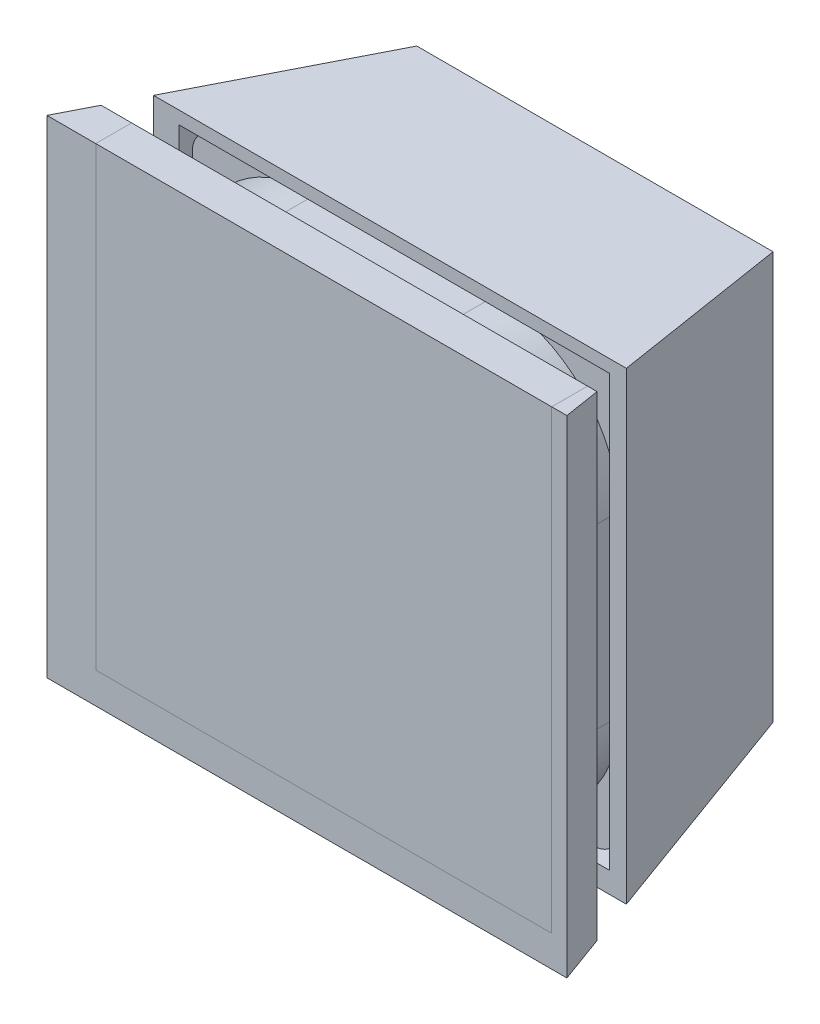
ISO-10303-21;
HEADER;
FILE_DESCRIPTION(('STEP AP214'),'2;1');
FILE_NAME('part.step','',(''),(''),'','','');
FILE_SCHEMA(('AUTOMOTIVE_DESIGN { 1 0 10303 214 1 1 1 1 }'));
ENDSEC;
DATA;
#1=APPLICATION_CONTEXT('core data for automotive mechanical design processes');
#2=APPLICATION_PROTOCOL_DEFINITION('international standard','automotive_design',2000,#1);
#3=PRODUCT_CONTEXT('',#1,'mechanical');
#4=PRODUCT('Part','Part','',(#3));
#5=PRODUCT_RELATED_PRODUCT_CATEGORY('part','',(#4));
#6=PRODUCT_DEFINITION_FORMATION('','',#4);
#7=PRODUCT_DEFINITION_CONTEXT('part definition',#1,'design');
#8=PRODUCT_DEFINITION('design','',#6,#7);
#9=PRODUCT_DEFINITION_SHAPE('','',#8);
#10=(LENGTH_UNIT() NAMED_UNIT(*) SI_UNIT(.MILLI.,.METRE.));
#11=(NAMED_UNIT(*) PLANE_ANGLE_UNIT() SI_UNIT($,.RADIAN.));
#12=(NAMED_UNIT(*) SI_UNIT($,.STERADIAN.) SOLID_ANGLE_UNIT());
#13=UNCERTAINTY_MEASURE_WITH_UNIT(LENGTH_MEASURE(1.E-05),#10,'distance_accuracy_value','');
#14=(GEOMETRIC_REPRESENTATION_CONTEXT(3) GLOBAL_UNCERTAINTY_ASSIGNED_CONTEXT((#13)) GLOBAL_UNIT_ASSIGNED_CONTEXT((#10,
#11,#12)) REPRESENTATION_CONTEXT('',''));
#15=CARTESIAN_POINT('',(0.,0.,0.));
#16=DIRECTION('',(0.,0.,1.));
#17=DIRECTION('',(1.,0.,0.));
#18=AXIS2_PLACEMENT_3D('',#15,#16,#17);
#19=CARTESIAN_POINT('',(30.5999999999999,60.6,-20.7999999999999));
#20=DIRECTION('',(0.,-1.,0.));
#21=DIRECTION('',(0.,0.,-1.));
#22=AXIS2_PLACEMENT_3D('',#19,#20,#21);
#23=PLANE('',#22);
#24=DIRECTION('',(0.,0.,1.));
#25=VECTOR('',#24,1.);
#26=CARTESIAN_POINT('',(42.6,60.6,-20.7999999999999));
#27=LINE('',#26,#25);
#28=CARTESIAN_POINT('',(42.6,60.6,-20.7999999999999));
#29=VERTEX_POINT('',#28);
#30=CARTESIAN_POINT('',(42.6,60.6,-16.8999999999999));
#31=VERTEX_POINT('',#30);
#32=EDGE_CURVE('E170',#29,#31,#27,.T.);
#33=ORIENTED_EDGE('',*,*,#32,.F.);
#34=DIRECTION('',(1.,0.,0.));
#35=VECTOR('',#34,1.);
#36=CARTESIAN_POINT('',(30.5999999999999,60.6,-20.7999999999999));
#37=LINE('',#36,#35);
#38=CARTESIAN_POINT('',(30.5999999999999,60.6,-20.7999999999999));
#39=VERTEX_POINT('',#38);
#40=EDGE_CURVE('E169',#39,#29,#37,.T.);
#41=ORIENTED_EDGE('',*,*,#40,.F.);
#42=DIRECTION('',(0.,0.,1.));
#43=VECTOR('',#42,1.);
#44=CARTESIAN_POINT('',(30.5999999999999,60.6,-20.7999999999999));
#45=LINE('',#44,#43);
#46=CARTESIAN_POINT('',(30.6,60.6,-16.8999999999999));
#47=VERTEX_POINT('',#46);
#48=EDGE_CURVE('E164',#39,#47,#45,.T.);
#49=ORIENTED_EDGE('',*,*,#48,.T.);
#50=DIRECTION('',(1.,0.,0.));
#51=VECTOR('',#50,1.);
#52=CARTESIAN_POINT('',(30.6,60.6,-16.8999999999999));
#53=LINE('',#52,#51);
#54=EDGE_CURVE('E13',#47,#31,#53,.T.);
#55=ORIENTED_EDGE('',*,*,#54,.T.);
#56=EDGE_LOOP('',(#33,#41,#49,#55));
#57=FACE_BOUND('',#56,.T.);
#58=ADVANCED_FACE('F107',(#57),#23,.F.);
#59=CARTESIAN_POINT('',(30.6,60.6,-16.8999999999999));
#60=DIRECTION('',(0.,0.707106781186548,-0.707106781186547));
#61=DIRECTION('',(0.,0.707106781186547,0.707106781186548));
#62=AXIS2_PLACEMENT_3D('',#59,#60,#61);
#63=PLANE('',#62);
#64=DIRECTION('',(0.,-0.707106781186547,-0.707106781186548));
#65=VECTOR('',#64,1.);
#66=CARTESIAN_POINT('',(42.6,60.6,-16.8999999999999));
#67=LINE('',#66,#65);
#68=CARTESIAN_POINT('',(42.6,59.4,-18.0999999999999));
#69=VERTEX_POINT('',#68);
#70=EDGE_CURVE('E172',#31,#69,#67,.T.);
#71=ORIENTED_EDGE('',*,*,#70,.F.);
#72=ORIENTED_EDGE('',*,*,#54,.F.);
#73=DIRECTION('',(0.,-0.707106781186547,-0.707106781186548));
#74=VECTOR('',#73,1.);
#75=CARTESIAN_POINT('',(30.6,60.6,-16.8999999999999));
#76=LINE('',#75,#74);
#77=CARTESIAN_POINT('',(30.6,59.4,-18.0999999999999));
#78=VERTEX_POINT('',#77);
#79=EDGE_CURVE('E148',#47,#78,#76,.T.);
#80=ORIENTED_EDGE('',*,*,#79,.T.);
#81=DIRECTION('',(1.,0.,0.));
#82=VECTOR('',#81,1.);
#83=CARTESIAN_POINT('',(30.6,59.4,-18.0999999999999));
#84=LINE('',#83,#82);
#85=EDGE_CURVE('E115',#78,#69,#84,.T.);
#86=ORIENTED_EDGE('',*,*,#85,.T.);
#87=EDGE_LOOP('',(#71,#72,#80,#86));
#88=FACE_BOUND('',#87,.T.);
#89=ADVANCED_FACE('F162',(#88),#63,.F.);
#90=CARTESIAN_POINT('',(30.6,59.4,-18.0999999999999));
#91=DIRECTION('',(0.,1.,0.));
#92=DIRECTION('',(0.,0.,1.));
#93=AXIS2_PLACEMENT_3D('',#90,#91,#92);
#94=PLANE('',#93);
#95=DIRECTION('',(0.,0.,-1.));
#96=VECTOR('',#95,1.);
#97=CARTESIAN_POINT('',(42.6,59.4,-18.0999999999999));
#98=LINE('',#97,#96);
#99=CARTESIAN_POINT('',(42.6,59.4,-19.5999999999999));
#100=VERTEX_POINT('',#99);
#101=EDGE_CURVE('E158',#69,#100,#98,.T.);
#102=ORIENTED_EDGE('',*,*,#101,.F.);
#103=ORIENTED_EDGE('',*,*,#85,.F.);
#104=DIRECTION('',(0.,0.,-1.));
#105=VECTOR('',#104,1.);
#106=CARTESIAN_POINT('',(30.6,59.4,-18.0999999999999));
#107=LINE('',#106,#105);
#108=CARTESIAN_POINT('',(30.5999999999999,59.4,-19.5999999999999));
#109=VERTEX_POINT('',#108);
#110=EDGE_CURVE('E151',#78,#109,#107,.T.);
#111=ORIENTED_EDGE('',*,*,#110,.T.);
#112=DIRECTION('',(1.,0.,0.));
#113=VECTOR('',#112,1.);
#114=CARTESIAN_POINT('',(30.5999999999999,59.4,-19.5999999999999));
#115=LINE('',#114,#113);
#116=EDGE_CURVE('E161',#109,#100,#115,.T.);
#117=ORIENTED_EDGE('',*,*,#116,.T.);
#118=EDGE_LOOP('',(#102,#103,#111,#117));
#119=FACE_BOUND('',#118,.T.);
#120=ADVANCED_FACE('F157',(#119),#94,.F.);
#121=CARTESIAN_POINT('',(30.5999999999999,59.4,-19.5999999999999));
#122=DIRECTION('',(0.,0.707106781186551,0.707106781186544));
#123=DIRECTION('',(0.,-0.707106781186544,0.707106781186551));
#124=AXIS2_PLACEMENT_3D('',#121,#122,#123);
#125=PLANE('',#124);
#126=DIRECTION('',(0.,0.707106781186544,-0.707106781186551));
#127=VECTOR('',#126,1.);
#128=CARTESIAN_POINT('',(42.6,59.4,-19.5999999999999));
#129=LINE('',#128,#127);
#130=EDGE_CURVE('E137',#100,#29,#129,.T.);
#131=ORIENTED_EDGE('',*,*,#130,.F.);
#132=ORIENTED_EDGE('',*,*,#116,.F.);
#133=DIRECTION('',(0.,0.707106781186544,-0.707106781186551));
#134=VECTOR('',#133,1.);
#135=CARTESIAN_POINT('',(30.5999999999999,59.4,-19.5999999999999));
#136=LINE('',#135,#134);
#137=EDGE_CURVE('E123',#109,#39,#136,.T.);
#138=ORIENTED_EDGE('',*,*,#137,.T.);
#139=ORIENTED_EDGE('',*,*,#40,.T.);
#140=EDGE_LOOP('',(#131,#132,#138,#139));
#141=FACE_BOUND('',#140,.T.);
#142=ADVANCED_FACE('F181',(#141),#125,.F.);
#143=CARTESIAN_POINT('',(30.6,0.,0.));
#144=DIRECTION('',(-1.,0.,0.));
#145=DIRECTION('',(0.,0.,1.));
#146=AXIS2_PLACEMENT_3D('',#143,#144,#145);
#147=PLANE('',#146);
#148=ORIENTED_EDGE('',*,*,#48,.F.);
#149=ORIENTED_EDGE('',*,*,#137,.F.);
#150=ORIENTED_EDGE('',*,*,#110,.F.);
#151=ORIENTED_EDGE('',*,*,#79,.F.);
#152=EDGE_LOOP('',(#148,#149,#150,#151));
#153=FACE_BOUND('',#152,.T.);
#154=ADVANCED_FACE('F153',(#153),#147,.T.);
#155=CARTESIAN_POINT('',(42.6,0.,0.));
#156=DIRECTION('',(-1.,0.,0.));
#157=DIRECTION('',(0.,0.,1.));
#158=AXIS2_PLACEMENT_3D('',#155,#156,#157);
#159=PLANE('',#158);
#160=ORIENTED_EDGE('',*,*,#32,.T.);
#161=ORIENTED_EDGE('',*,*,#70,.T.);
#162=ORIENTED_EDGE('',*,*,#101,.T.);
#163=ORIENTED_EDGE('',*,*,#130,.T.);
#164=EDGE_LOOP('',(#160,#161,#162,#163));
#165=FACE_BOUND('',#164,.T.);
#166=ADVANCED_FACE('F177',(#165),#159,.F.);
#167=CLOSED_SHELL('',(#58,#89,#120,#142,#154,#166));
#168=MANIFOLD_SOLID_BREP('B2',#167);
#169=CARTESIAN_POINT('',(-30.6000000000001,60.6,-20.7999999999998));
#170=DIRECTION('',(0.,-1.,0.));
#171=DIRECTION('',(0.,0.,-1.));
#172=AXIS2_PLACEMENT_3D('',#169,#170,#171);
#173=PLANE('',#172);
#174=DIRECTION('',(0.,0.,1.));
#175=VECTOR('',#174,1.);
#176=CARTESIAN_POINT('',(-42.6,60.6,-20.7999999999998));
#177=LINE('',#176,#175);
#178=CARTESIAN_POINT('',(-42.6,60.6,-20.7999999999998));
#179=VERTEX_POINT('',#178);
#180=CARTESIAN_POINT('',(-42.6,60.6,-16.8999999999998));
#181=VERTEX_POINT('',#180);
#182=EDGE_CURVE('E320',#179,#181,#177,.T.);
#183=ORIENTED_EDGE('',*,*,#182,.T.);
#184=DIRECTION('',(-1.,0.,0.));
#185=VECTOR('',#184,1.);
#186=CARTESIAN_POINT('',(-30.6,60.6,-16.8999999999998));
#187=LINE('',#186,#185);
#188=CARTESIAN_POINT('',(-30.6,60.6,-16.8999999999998));
#189=VERTEX_POINT('',#188);
#190=EDGE_CURVE('E105',#189,#181,#187,.T.);
#191=ORIENTED_EDGE('',*,*,#190,.F.);
#192=DIRECTION('',(0.,0.,1.));
#193=VECTOR('',#192,1.);
#194=CARTESIAN_POINT('',(-30.6000000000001,60.6,-20.7999999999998));
#195=LINE('',#194,#193);
#196=CARTESIAN_POINT('',(-30.6000000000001,60.6,-20.7999999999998));
#197=VERTEX_POINT('',#196);
#198=EDGE_CURVE('E307',#197,#189,#195,.T.);
#199=ORIENTED_EDGE('',*,*,#198,.F.);
#200=DIRECTION('',(-1.,0.,0.));
#201=VECTOR('',#200,1.);
#202=CARTESIAN_POINT('',(-30.6000000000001,60.6,-20.7999999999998));
#203=LINE('',#202,#201);
#204=EDGE_CURVE('E312',#197,#179,#203,.T.);
#205=ORIENTED_EDGE('',*,*,#204,.T.);
#206=EDGE_LOOP('',(#183,#191,#199,#205));
#207=FACE_BOUND('',#206,.T.);
#208=ADVANCED_FACE('F252',(#207),#173,.F.);
#209=CARTESIAN_POINT('',(-30.6,60.6,-16.8999999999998));
#210=DIRECTION('',(0.,0.707106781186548,-0.707106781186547));
#211=DIRECTION('',(0.,0.707106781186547,0.707106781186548));
#212=AXIS2_PLACEMENT_3D('',#209,#210,#211);
#213=PLANE('',#212);
#214=DIRECTION('',(0.,-0.707106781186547,-0.707106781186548));
#215=VECTOR('',#214,1.);
#216=CARTESIAN_POINT('',(-42.6,60.6,-16.8999999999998));
#217=LINE('',#216,#215);
#218=CARTESIAN_POINT('',(-42.6,59.4,-18.0999999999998));
#219=VERTEX_POINT('',#218);
#220=EDGE_CURVE('E311',#181,#219,#217,.T.);
#221=ORIENTED_EDGE('',*,*,#220,.T.);
#222=DIRECTION('',(-1.,0.,0.));
#223=VECTOR('',#222,1.);
#224=CARTESIAN_POINT('',(-30.6,59.4,-18.0999999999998));
#225=LINE('',#224,#223);
#226=CARTESIAN_POINT('',(-30.6,59.4,-18.0999999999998));
#227=VERTEX_POINT('',#226);
#228=EDGE_CURVE('E260',#227,#219,#225,.T.);
#229=ORIENTED_EDGE('',*,*,#228,.F.);
#230=DIRECTION('',(0.,-0.707106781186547,-0.707106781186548));
#231=VECTOR('',#230,1.);
#232=CARTESIAN_POINT('',(-30.6,60.6,-16.8999999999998));
#233=LINE('',#232,#231);
#234=EDGE_CURVE('E294',#189,#227,#233,.T.);
#235=ORIENTED_EDGE('',*,*,#234,.F.);
#236=ORIENTED_EDGE('',*,*,#190,.T.);
#237=EDGE_LOOP('',(#221,#229,#235,#236));
#238=FACE_BOUND('',#237,.T.);
#239=ADVANCED_FACE('F310',(#238),#213,.F.);
#240=CARTESIAN_POINT('',(-30.6,59.4,-18.0999999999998));
#241=DIRECTION('',(0.,1.,0.));
#242=DIRECTION('',(0.,0.,1.));
#243=AXIS2_PLACEMENT_3D('',#240,#241,#242);
#244=PLANE('',#243);
#245=DIRECTION('',(0.,0.,-1.));
#246=VECTOR('',#245,1.);
#247=CARTESIAN_POINT('',(-42.6,59.4,-18.0999999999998));
#248=LINE('',#247,#246);
#249=CARTESIAN_POINT('',(-42.6,59.4,-19.5999999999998));
#250=VERTEX_POINT('',#249);
#251=EDGE_CURVE('E317',#219,#250,#248,.T.);
#252=ORIENTED_EDGE('',*,*,#251,.T.);
#253=DIRECTION('',(-1.,0.,0.));
#254=VECTOR('',#253,1.);
#255=CARTESIAN_POINT('',(-30.6000000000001,59.4,-19.5999999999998));
#256=LINE('',#255,#254);
#257=CARTESIAN_POINT('',(-30.6000000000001,59.4,-19.5999999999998));
#258=VERTEX_POINT('',#257);
#259=EDGE_CURVE('E303',#258,#250,#256,.T.);
#260=ORIENTED_EDGE('',*,*,#259,.F.);
#261=DIRECTION('',(0.,0.,-1.));
#262=VECTOR('',#261,1.);
#263=CARTESIAN_POINT('',(-30.6,59.4,-18.0999999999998));
#264=LINE('',#263,#262);
#265=EDGE_CURVE('E299',#227,#258,#264,.T.);
#266=ORIENTED_EDGE('',*,*,#265,.F.);
#267=ORIENTED_EDGE('',*,*,#228,.T.);
#268=EDGE_LOOP('',(#252,#260,#266,#267));
#269=FACE_BOUND('',#268,.T.);
#270=ADVANCED_FACE('F301',(#269),#244,.F.);
#271=CARTESIAN_POINT('',(-30.6000000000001,59.4,-19.5999999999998));
#272=DIRECTION('',(0.,0.707106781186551,0.707106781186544));
#273=DIRECTION('',(0.,-0.707106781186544,0.707106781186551));
#274=AXIS2_PLACEMENT_3D('',#271,#272,#273);
#275=PLANE('',#274);
#276=DIRECTION('',(0.,0.707106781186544,-0.707106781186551));
#277=VECTOR('',#276,1.);
#278=CARTESIAN_POINT('',(-42.6,59.4,-19.5999999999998));
#279=LINE('',#278,#277);
#280=EDGE_CURVE('E284',#250,#179,#279,.T.);
#281=ORIENTED_EDGE('',*,*,#280,.T.);
#282=ORIENTED_EDGE('',*,*,#204,.F.);
#283=DIRECTION('',(0.,0.707106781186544,-0.707106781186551));
#284=VECTOR('',#283,1.);
#285=CARTESIAN_POINT('',(-30.6000000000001,59.4,-19.5999999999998));
#286=LINE('',#285,#284);
#287=EDGE_CURVE('E268',#258,#197,#286,.T.);
#288=ORIENTED_EDGE('',*,*,#287,.F.);
#289=ORIENTED_EDGE('',*,*,#259,.T.);
#290=EDGE_LOOP('',(#281,#282,#288,#289));
#291=FACE_BOUND('',#290,.T.);
#292=ADVANCED_FACE('F331',(#291),#275,.F.);
#293=CARTESIAN_POINT('',(-30.6,0.,0.));
#294=DIRECTION('',(1.,0.,0.));
#295=DIRECTION('',(0.,0.,1.));
#296=AXIS2_PLACEMENT_3D('',#293,#294,#295);
#297=PLANE('',#296);
#298=ORIENTED_EDGE('',*,*,#198,.T.);
#299=ORIENTED_EDGE('',*,*,#234,.T.);
#300=ORIENTED_EDGE('',*,*,#265,.T.);
#301=ORIENTED_EDGE('',*,*,#287,.T.);
#302=EDGE_LOOP('',(#298,#299,#300,#301));
#303=FACE_BOUND('',#302,.T.);
#304=ADVANCED_FACE('F305',(#303),#297,.T.);
#305=CARTESIAN_POINT('',(-42.6,0.,0.));
#306=DIRECTION('',(1.,0.,0.));
#307=DIRECTION('',(0.,0.,1.));
#308=AXIS2_PLACEMENT_3D('',#305,#306,#307);
#309=PLANE('',#308);
#310=ORIENTED_EDGE('',*,*,#182,.F.);
#311=ORIENTED_EDGE('',*,*,#280,.F.);
#312=ORIENTED_EDGE('',*,*,#251,.F.);
#313=ORIENTED_EDGE('',*,*,#220,.F.);
#314=EDGE_LOOP('',(#310,#311,#312,#313));
#315=FACE_BOUND('',#314,.T.);
#316=ADVANCED_FACE('F325',(#315),#309,.F.);
#317=CLOSED_SHELL('',(#208,#239,#270,#292,#304,#316));
#318=MANIFOLD_SOLID_BREP('B7',#317);
#319=CARTESIAN_POINT('',(-30.6,-60.6,-20.7999999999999));
#320=DIRECTION('',(0.,1.,0.));
#321=DIRECTION('',(0.,0.,-1.));
#322=AXIS2_PLACEMENT_3D('',#319,#320,#321);
#323=PLANE('',#322);
#324=DIRECTION('',(0.,0.,1.));
#325=VECTOR('',#324,1.);
#326=CARTESIAN_POINT('',(-42.6,-60.6,-20.7999999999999));
#327=LINE('',#326,#325);
#328=CARTESIAN_POINT('',(-42.6,-60.6,-20.7999999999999));
#329=VERTEX_POINT('',#328);
#330=CARTESIAN_POINT('',(-42.6,-60.6,-16.8999999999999));
#331=VERTEX_POINT('',#330);
#332=EDGE_CURVE('E460',#329,#331,#327,.T.);
#333=ORIENTED_EDGE('',*,*,#332,.F.);
#334=DIRECTION('',(-1.,0.,0.));
#335=VECTOR('',#334,1.);
#336=CARTESIAN_POINT('',(-30.6,-60.6,-20.7999999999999));
#337=LINE('',#336,#335);
#338=CARTESIAN_POINT('',(-30.6,-60.6,-20.7999999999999));
#339=VERTEX_POINT('',#338);
#340=EDGE_CURVE('E459',#339,#329,#337,.T.);
#341=ORIENTED_EDGE('',*,*,#340,.F.);
#342=DIRECTION('',(0.,0.,1.));
#343=VECTOR('',#342,1.);
#344=CARTESIAN_POINT('',(-30.6,-60.6,-20.7999999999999));
#345=LINE('',#344,#343);
#346=CARTESIAN_POINT('',(-30.6,-60.6,-16.8999999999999));
#347=VERTEX_POINT('',#346);
#348=EDGE_CURVE('E454',#339,#347,#345,.T.);
#349=ORIENTED_EDGE('',*,*,#348,.T.);
#350=DIRECTION('',(-1.,0.,0.));
#351=VECTOR('',#350,1.);
#352=CARTESIAN_POINT('',(-30.6,-60.6,-16.8999999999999));
#353=LINE('',#352,#351);
#354=EDGE_CURVE('E250',#347,#331,#353,.T.);
#355=ORIENTED_EDGE('',*,*,#354,.T.);
#356=EDGE_LOOP('',(#333,#341,#349,#355));
#357=FACE_BOUND('',#356,.T.);
#358=ADVANCED_FACE('F397',(#357),#323,.F.);
#359=CARTESIAN_POINT('',(-30.6,-60.6,-16.8999999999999));
#360=DIRECTION('',(0.,-0.707106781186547,-0.707106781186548));
#361=DIRECTION('',(0.,-0.707106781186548,0.707106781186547));
#362=AXIS2_PLACEMENT_3D('',#359,#360,#361);
#363=PLANE('',#362);
#364=DIRECTION('',(0.,0.707106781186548,-0.707106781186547));
#365=VECTOR('',#364,1.);
#366=CARTESIAN_POINT('',(-42.6,-60.6,-16.8999999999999));
#367=LINE('',#366,#365);
#368=CARTESIAN_POINT('',(-42.6,-59.4,-18.0999999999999));
#369=VERTEX_POINT('',#368);
#370=EDGE_CURVE('E462',#331,#369,#367,.T.);
#371=ORIENTED_EDGE('',*,*,#370,.F.);
#372=ORIENTED_EDGE('',*,*,#354,.F.);
#373=DIRECTION('',(0.,0.707106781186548,-0.707106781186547));
#374=VECTOR('',#373,1.);
#375=CARTESIAN_POINT('',(-30.6,-60.6,-16.8999999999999));
#376=LINE('',#375,#374);
#377=CARTESIAN_POINT('',(-30.6,-59.4,-18.0999999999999));
#378=VERTEX_POINT('',#377);
#379=EDGE_CURVE('E438',#347,#378,#376,.T.);
#380=ORIENTED_EDGE('',*,*,#379,.T.);
#381=DIRECTION('',(-1.,0.,0.));
#382=VECTOR('',#381,1.);
#383=CARTESIAN_POINT('',(-30.6,-59.4,-18.0999999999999));
#384=LINE('',#383,#382);
#385=EDGE_CURVE('E405',#378,#369,#384,.T.);
#386=ORIENTED_EDGE('',*,*,#385,.T.);
#387=EDGE_LOOP('',(#371,#372,#380,#386));
#388=FACE_BOUND('',#387,.T.);
#389=ADVANCED_FACE('F452',(#388),#363,.F.);
#390=CARTESIAN_POINT('',(-30.6,-59.4,-18.0999999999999));
#391=DIRECTION('',(0.,-1.,0.));
#392=DIRECTION('',(0.,0.,1.));
#393=AXIS2_PLACEMENT_3D('',#390,#391,#392);
#394=PLANE('',#393);
#395=DIRECTION('',(0.,0.,-1.));
#396=VECTOR('',#395,1.);
#397=CARTESIAN_POINT('',(-42.6,-59.4,-18.0999999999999));
#398=LINE('',#397,#396);
#399=CARTESIAN_POINT('',(-42.6,-59.4,-19.5999999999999));
#400=VERTEX_POINT('',#399);
#401=EDGE_CURVE('E448',#369,#400,#398,.T.);
#402=ORIENTED_EDGE('',*,*,#401,.F.);
#403=ORIENTED_EDGE('',*,*,#385,.F.);
#404=DIRECTION('',(0.,0.,-1.));
#405=VECTOR('',#404,1.);
#406=CARTESIAN_POINT('',(-30.6,-59.4,-18.0999999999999));
#407=LINE('',#406,#405);
#408=CARTESIAN_POINT('',(-30.6,-59.4,-19.5999999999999));
#409=VERTEX_POINT('',#408);
#410=EDGE_CURVE('E441',#378,#409,#407,.T.);
#411=ORIENTED_EDGE('',*,*,#410,.T.);
#412=DIRECTION('',(-1.,0.,0.));
#413=VECTOR('',#412,1.);
#414=CARTESIAN_POINT('',(-30.6,-59.4,-19.5999999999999));
#415=LINE('',#414,#413);
#416=EDGE_CURVE('E451',#409,#400,#415,.T.);
#417=ORIENTED_EDGE('',*,*,#416,.T.);
#418=EDGE_LOOP('',(#402,#403,#411,#417));
#419=FACE_BOUND('',#418,.T.);
#420=ADVANCED_FACE('F447',(#419),#394,.F.);
#421=CARTESIAN_POINT('',(-30.6,-59.4,-19.5999999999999));
#422=DIRECTION('',(0.,-0.707106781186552,0.707106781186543));
#423=DIRECTION('',(0.,0.707106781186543,0.707106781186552));
#424=AXIS2_PLACEMENT_3D('',#421,#422,#423);
#425=PLANE('',#424);
#426=DIRECTION('',(0.,-0.707106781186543,-0.707106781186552));
#427=VECTOR('',#426,1.);
#428=CARTESIAN_POINT('',(-42.6,-59.4,-19.5999999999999));
#429=LINE('',#428,#427);
#430=EDGE_CURVE('E427',#400,#329,#429,.T.);
#431=ORIENTED_EDGE('',*,*,#430,.F.);
#432=ORIENTED_EDGE('',*,*,#416,.F.);
#433=DIRECTION('',(0.,-0.707106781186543,-0.707106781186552));
#434=VECTOR('',#433,1.);
#435=CARTESIAN_POINT('',(-30.6,-59.4,-19.5999999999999));
#436=LINE('',#435,#434);
#437=EDGE_CURVE('E413',#409,#339,#436,.T.);
#438=ORIENTED_EDGE('',*,*,#437,.T.);
#439=ORIENTED_EDGE('',*,*,#340,.T.);
#440=EDGE_LOOP('',(#431,#432,#438,#439));
#441=FACE_BOUND('',#440,.T.);
#442=ADVANCED_FACE('F471',(#441),#425,.F.);
#443=CARTESIAN_POINT('',(-30.6,0.,0.));
#444=DIRECTION('',(1.,0.,0.));
#445=DIRECTION('',(0.,0.,1.));
#446=AXIS2_PLACEMENT_3D('',#443,#444,#445);
#447=PLANE('',#446);
#448=ORIENTED_EDGE('',*,*,#348,.F.);
#449=ORIENTED_EDGE('',*,*,#437,.F.);
#450=ORIENTED_EDGE('',*,*,#410,.F.);
#451=ORIENTED_EDGE('',*,*,#379,.F.);
#452=EDGE_LOOP('',(#448,#449,#450,#451));
#453=FACE_BOUND('',#452,.T.);
#454=ADVANCED_FACE('F443',(#453),#447,.T.);
#455=CARTESIAN_POINT('',(-42.6,0.,0.));
#456=DIRECTION('',(1.,0.,0.));
#457=DIRECTION('',(0.,0.,1.));
#458=AXIS2_PLACEMENT_3D('',#455,#456,#457);
#459=PLANE('',#458);
#460=ORIENTED_EDGE('',*,*,#332,.T.);
#461=ORIENTED_EDGE('',*,*,#370,.T.);
#462=ORIENTED_EDGE('',*,*,#401,.T.);
#463=ORIENTED_EDGE('',*,*,#430,.T.);
#464=EDGE_LOOP('',(#460,#461,#462,#463));
#465=FACE_BOUND('',#464,.T.);
#466=ADVANCED_FACE('F467',(#465),#459,.F.);
#467=CLOSED_SHELL('',(#358,#389,#420,#442,#454,#466));
#468=MANIFOLD_SOLID_BREP('B99',#467);
#469=CARTESIAN_POINT('',(30.6,-60.6,-20.8));
#470=DIRECTION('',(0.,1.,0.));
#471=DIRECTION('',(0.,0.,-1.));
#472=AXIS2_PLACEMENT_3D('',#469,#470,#471);
#473=PLANE('',#472);
#474=DIRECTION('',(0.,0.,1.));
#475=VECTOR('',#474,1.);
#476=CARTESIAN_POINT('',(42.6,-60.6,-20.8));
#477=LINE('',#476,#475);
#478=CARTESIAN_POINT('',(42.6,-60.6,-20.8));
#479=VERTEX_POINT('',#478);
#480=CARTESIAN_POINT('',(42.6,-60.6,-16.9));
#481=VERTEX_POINT('',#480);
#482=EDGE_CURVE('E610',#479,#481,#477,.T.);
#483=ORIENTED_EDGE('',*,*,#482,.T.);
#484=DIRECTION('',(1.,0.,0.));
#485=VECTOR('',#484,1.);
#486=CARTESIAN_POINT('',(30.6,-60.6,-16.9));
#487=LINE('',#486,#485);
#488=CARTESIAN_POINT('',(30.6,-60.6,-16.9));
#489=VERTEX_POINT('',#488);
#490=EDGE_CURVE('E395',#489,#481,#487,.T.);
#491=ORIENTED_EDGE('',*,*,#490,.F.);
#492=DIRECTION('',(0.,0.,1.));
#493=VECTOR('',#492,1.);
#494=CARTESIAN_POINT('',(30.6,-60.6,-20.8));
#495=LINE('',#494,#493);
#496=CARTESIAN_POINT('',(30.6,-60.6,-20.8));
#497=VERTEX_POINT('',#496);
#498=EDGE_CURVE('E597',#497,#489,#495,.T.);
#499=ORIENTED_EDGE('',*,*,#498,.F.);
#500=DIRECTION('',(1.,0.,0.));
#501=VECTOR('',#500,1.);
#502=CARTESIAN_POINT('',(30.6,-60.6,-20.8));
#503=LINE('',#502,#501);
#504=EDGE_CURVE('E602',#497,#479,#503,.T.);
#505=ORIENTED_EDGE('',*,*,#504,.T.);
#506=EDGE_LOOP('',(#483,#491,#499,#505));
#507=FACE_BOUND('',#506,.T.);
#508=ADVANCED_FACE('F542',(#507),#473,.F.);
#509=CARTESIAN_POINT('',(30.6,-60.6,-16.9));
#510=DIRECTION('',(0.,-0.707106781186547,-0.707106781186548));
#511=DIRECTION('',(0.,-0.707106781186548,0.707106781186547));
#512=AXIS2_PLACEMENT_3D('',#509,#510,#511);
#513=PLANE('',#512);
#514=DIRECTION('',(0.,0.707106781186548,-0.707106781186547));
#515=VECTOR('',#514,1.);
#516=CARTESIAN_POINT('',(42.6,-60.6,-16.9));
#517=LINE('',#516,#515);
#518=CARTESIAN_POINT('',(42.6,-59.4,-18.1));
#519=VERTEX_POINT('',#518);
#520=EDGE_CURVE('E601',#481,#519,#517,.T.);
#521=ORIENTED_EDGE('',*,*,#520,.T.);
#522=DIRECTION('',(1.,0.,0.));
#523=VECTOR('',#522,1.);
#524=CARTESIAN_POINT('',(30.6,-59.4,-18.1));
#525=LINE('',#524,#523);
#526=CARTESIAN_POINT('',(30.6,-59.4,-18.1));
#527=VERTEX_POINT('',#526);
#528=EDGE_CURVE('E550',#527,#519,#525,.T.);
#529=ORIENTED_EDGE('',*,*,#528,.F.);
#530=DIRECTION('',(0.,0.707106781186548,-0.707106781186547));
#531=VECTOR('',#530,1.);
#532=CARTESIAN_POINT('',(30.6,-60.6,-16.9));
#533=LINE('',#532,#531);
#534=EDGE_CURVE('E584',#489,#527,#533,.T.);
#535=ORIENTED_EDGE('',*,*,#534,.F.);
#536=ORIENTED_EDGE('',*,*,#490,.T.);
#537=EDGE_LOOP('',(#521,#529,#535,#536));
#538=FACE_BOUND('',#537,.T.);
#539=ADVANCED_FACE('F600',(#538),#513,.F.);
#540=CARTESIAN_POINT('',(30.6,-59.4,-18.1));
#541=DIRECTION('',(0.,-1.,0.));
#542=DIRECTION('',(0.,0.,1.));
#543=AXIS2_PLACEMENT_3D('',#540,#541,#542);
#544=PLANE('',#543);
#545=DIRECTION('',(0.,0.,-1.));
#546=VECTOR('',#545,1.);
#547=CARTESIAN_POINT('',(42.6,-59.4,-18.1));
#548=LINE('',#547,#546);
#549=CARTESIAN_POINT('',(42.6,-59.4,-19.6));
#550=VERTEX_POINT('',#549);
#551=EDGE_CURVE('E607',#519,#550,#548,.T.);
#552=ORIENTED_EDGE('',*,*,#551,.T.);
#553=DIRECTION('',(1.,0.,0.));
#554=VECTOR('',#553,1.);
#555=CARTESIAN_POINT('',(30.6,-59.4,-19.6));
#556=LINE('',#555,#554);
#557=CARTESIAN_POINT('',(30.6,-59.4,-19.6));
#558=VERTEX_POINT('',#557);
#559=EDGE_CURVE('E593',#558,#550,#556,.T.);
#560=ORIENTED_EDGE('',*,*,#559,.F.);
#561=DIRECTION('',(0.,0.,-1.));
#562=VECTOR('',#561,1.);
#563=CARTESIAN_POINT('',(30.6,-59.4,-18.1));
#564=LINE('',#563,#562);
#565=EDGE_CURVE('E589',#527,#558,#564,.T.);
#566=ORIENTED_EDGE('',*,*,#565,.F.);
#567=ORIENTED_EDGE('',*,*,#528,.T.);
#568=EDGE_LOOP('',(#552,#560,#566,#567));
#569=FACE_BOUND('',#568,.T.);
#570=ADVANCED_FACE('F591',(#569),#544,.F.);
#571=CARTESIAN_POINT('',(30.6,-59.4,-19.6));
#572=DIRECTION('',(0.,-0.707106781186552,0.707106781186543));
#573=DIRECTION('',(0.,0.707106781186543,0.707106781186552));
#574=AXIS2_PLACEMENT_3D('',#571,#572,#573);
#575=PLANE('',#574);
#576=DIRECTION('',(0.,-0.707106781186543,-0.707106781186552));
#577=VECTOR('',#576,1.);
#578=CARTESIAN_POINT('',(42.6,-59.4,-19.6));
#579=LINE('',#578,#577);
#580=EDGE_CURVE('E574',#550,#479,#579,.T.);
#581=ORIENTED_EDGE('',*,*,#580,.T.);
#582=ORIENTED_EDGE('',*,*,#504,.F.);
#583=DIRECTION('',(0.,-0.707106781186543,-0.707106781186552));
#584=VECTOR('',#583,1.);
#585=CARTESIAN_POINT('',(30.6,-59.4,-19.6));
#586=LINE('',#585,#584);
#587=EDGE_CURVE('E558',#558,#497,#586,.T.);
#588=ORIENTED_EDGE('',*,*,#587,.F.);
#589=ORIENTED_EDGE('',*,*,#559,.T.);
#590=EDGE_LOOP('',(#581,#582,#588,#589));
#591=FACE_BOUND('',#590,.T.);
#592=ADVANCED_FACE('F621',(#591),#575,.F.);
#593=CARTESIAN_POINT('',(30.6,0.,0.));
#594=DIRECTION('',(-1.,0.,0.));
#595=DIRECTION('',(0.,0.,1.));
#596=AXIS2_PLACEMENT_3D('',#593,#594,#595);
#597=PLANE('',#596);
#598=ORIENTED_EDGE('',*,*,#498,.T.);
#599=ORIENTED_EDGE('',*,*,#534,.T.);
#600=ORIENTED_EDGE('',*,*,#565,.T.);
#601=ORIENTED_EDGE('',*,*,#587,.T.);
#602=EDGE_LOOP('',(#598,#599,#600,#601));
#603=FACE_BOUND('',#602,.T.);
#604=ADVANCED_FACE('F595',(#603),#597,.T.);
#605=CARTESIAN_POINT('',(42.6,0.,0.));
#606=DIRECTION('',(-1.,0.,0.));
#607=DIRECTION('',(0.,0.,1.));
#608=AXIS2_PLACEMENT_3D('',#605,#606,#607);
#609=PLANE('',#608);
#610=ORIENTED_EDGE('',*,*,#482,.F.);
#611=ORIENTED_EDGE('',*,*,#580,.F.);
#612=ORIENTED_EDGE('',*,*,#551,.F.);
#613=ORIENTED_EDGE('',*,*,#520,.F.);
#614=EDGE_LOOP('',(#610,#611,#612,#613));
#615=FACE_BOUND('',#614,.T.);
#616=ADVANCED_FACE('F615',(#615),#609,.F.);
#617=CLOSED_SHELL('',(#508,#539,#570,#592,#604,#616));
#618=MANIFOLD_SOLID_BREP('B244',#617);
#619=CARTESIAN_POINT('',(60.6,-30.6,-20.7999999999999));
#620=DIRECTION('',(-1.,0.,0.));
#621=DIRECTION('',(0.,0.,-1.));
#622=AXIS2_PLACEMENT_3D('',#619,#620,#621);
#623=PLANE('',#622);
#624=DIRECTION('',(0.,0.,1.));
#625=VECTOR('',#624,1.);
#626=CARTESIAN_POINT('',(60.6,-42.6,-20.7999999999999));
#627=LINE('',#626,#625);
#628=CARTESIAN_POINT('',(60.6,-42.6,-20.7999999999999));
#629=VERTEX_POINT('',#628);
#630=CARTESIAN_POINT('',(60.6,-42.6,-16.8999999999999));
#631=VERTEX_POINT('',#630);
#632=EDGE_CURVE('E750',#629,#631,#627,.T.);
#633=ORIENTED_EDGE('',*,*,#632,.F.);
#634=DIRECTION('',(0.,-1.,0.));
#635=VECTOR('',#634,1.);
#636=CARTESIAN_POINT('',(60.6,-30.6,-20.7999999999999));
#637=LINE('',#636,#635);
#638=CARTESIAN_POINT('',(60.6,-30.6,-20.7999999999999));
#639=VERTEX_POINT('',#638);
#640=EDGE_CURVE('E749',#639,#629,#637,.T.);
#641=ORIENTED_EDGE('',*,*,#640,.F.);
#642=DIRECTION('',(0.,0.,1.));
#643=VECTOR('',#642,1.);
#644=CARTESIAN_POINT('',(60.6,-30.6,-20.7999999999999));
#645=LINE('',#644,#643);
#646=CARTESIAN_POINT('',(60.6,-30.6,-16.8999999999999));
#647=VERTEX_POINT('',#646);
#648=EDGE_CURVE('E744',#639,#647,#645,.T.);
#649=ORIENTED_EDGE('',*,*,#648,.T.);
#650=DIRECTION('',(0.,-1.,0.));
#651=VECTOR('',#650,1.);
#652=CARTESIAN_POINT('',(60.6,-30.6,-16.8999999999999));
#653=LINE('',#652,#651);
#654=EDGE_CURVE('E540',#647,#631,#653,.T.);
#655=ORIENTED_EDGE('',*,*,#654,.T.);
#656=EDGE_LOOP('',(#633,#641,#649,#655));
#657=FACE_BOUND('',#656,.T.);
#658=ADVANCED_FACE('F687',(#657),#623,.F.);
#659=CARTESIAN_POINT('',(60.6,-30.6,-16.8999999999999));
#660=DIRECTION('',(0.707106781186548,0.,-0.707106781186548));
#661=DIRECTION('',(0.707106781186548,0.,0.707106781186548));
#662=AXIS2_PLACEMENT_3D('',#659,#660,#661);
#663=PLANE('',#662);
#664=DIRECTION('',(-0.707106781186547,0.,-0.707106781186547));
#665=VECTOR('',#664,1.);
#666=CARTESIAN_POINT('',(60.6,-42.6,-16.8999999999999));
#667=LINE('',#666,#665);
#668=CARTESIAN_POINT('',(59.4,-42.6,-18.0999999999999));
#669=VERTEX_POINT('',#668);
#670=EDGE_CURVE('E752',#631,#669,#667,.T.);
#671=ORIENTED_EDGE('',*,*,#670,.F.);
#672=ORIENTED_EDGE('',*,*,#654,.F.);
#673=DIRECTION('',(-0.707106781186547,0.,-0.707106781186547));
#674=VECTOR('',#673,1.);
#675=CARTESIAN_POINT('',(60.6,-30.6,-16.8999999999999));
#676=LINE('',#675,#674);
#677=CARTESIAN_POINT('',(59.4,-30.6,-18.0999999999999));
#678=VERTEX_POINT('',#677);
#679=EDGE_CURVE('E728',#647,#678,#676,.T.);
#680=ORIENTED_EDGE('',*,*,#679,.T.);
#681=DIRECTION('',(0.,-1.,0.));
#682=VECTOR('',#681,1.);
#683=CARTESIAN_POINT('',(59.4,-30.6,-18.0999999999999));
#684=LINE('',#683,#682);
#685=EDGE_CURVE('E695',#678,#669,#684,.T.);
#686=ORIENTED_EDGE('',*,*,#685,.T.);
#687=EDGE_LOOP('',(#671,#672,#680,#686));
#688=FACE_BOUND('',#687,.T.);
#689=ADVANCED_FACE('F742',(#688),#663,.F.);
#690=CARTESIAN_POINT('',(59.4,-30.6,-18.0999999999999));
#691=DIRECTION('',(1.,0.,0.));
#692=DIRECTION('',(0.,0.,1.));
#693=AXIS2_PLACEMENT_3D('',#690,#691,#692);
#694=PLANE('',#693);
#695=DIRECTION('',(0.,0.,-1.));
#696=VECTOR('',#695,1.);
#697=CARTESIAN_POINT('',(59.4,-42.6,-18.0999999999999));
#698=LINE('',#697,#696);
#699=CARTESIAN_POINT('',(59.4,-42.6,-19.5999999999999));
#700=VERTEX_POINT('',#699);
#701=EDGE_CURVE('E738',#669,#700,#698,.T.);
#702=ORIENTED_EDGE('',*,*,#701,.F.);
#703=ORIENTED_EDGE('',*,*,#685,.F.);
#704=DIRECTION('',(0.,0.,-1.));
#705=VECTOR('',#704,1.);
#706=CARTESIAN_POINT('',(59.4,-30.6,-18.0999999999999));
#707=LINE('',#706,#705);
#708=CARTESIAN_POINT('',(59.4,-30.6,-19.5999999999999));
#709=VERTEX_POINT('',#708);
#710=EDGE_CURVE('E731',#678,#709,#707,.T.);
#711=ORIENTED_EDGE('',*,*,#710,.T.);
#712=DIRECTION('',(0.,-1.,0.));
#713=VECTOR('',#712,1.);
#714=CARTESIAN_POINT('',(59.4,-30.6,-19.5999999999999));
#715=LINE('',#714,#713);
#716=EDGE_CURVE('E741',#709,#700,#715,.T.);
#717=ORIENTED_EDGE('',*,*,#716,.T.);
#718=EDGE_LOOP('',(#702,#703,#711,#717));
#719=FACE_BOUND('',#718,.T.);
#720=ADVANCED_FACE('F737',(#719),#694,.F.);
#721=CARTESIAN_POINT('',(59.4,-30.6,-19.5999999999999));
#722=DIRECTION('',(0.707106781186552,0.,0.707106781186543));
#723=DIRECTION('',(-0.707106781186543,0.,0.707106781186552));
#724=AXIS2_PLACEMENT_3D('',#721,#722,#723);
#725=PLANE('',#724);
#726=DIRECTION('',(0.707106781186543,0.,-0.707106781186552));
#727=VECTOR('',#726,1.);
#728=CARTESIAN_POINT('',(59.4,-42.6,-19.5999999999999));
#729=LINE('',#728,#727);
#730=EDGE_CURVE('E717',#700,#629,#729,.T.);
#731=ORIENTED_EDGE('',*,*,#730,.F.);
#732=ORIENTED_EDGE('',*,*,#716,.F.);
#733=DIRECTION('',(0.707106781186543,0.,-0.707106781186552));
#734=VECTOR('',#733,1.);
#735=CARTESIAN_POINT('',(59.4,-30.6,-19.5999999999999));
#736=LINE('',#735,#734);
#737=EDGE_CURVE('E703',#709,#639,#736,.T.);
#738=ORIENTED_EDGE('',*,*,#737,.T.);
#739=ORIENTED_EDGE('',*,*,#640,.T.);
#740=EDGE_LOOP('',(#731,#732,#738,#739));
#741=FACE_BOUND('',#740,.T.);
#742=ADVANCED_FACE('F761',(#741),#725,.F.);
#743=CARTESIAN_POINT('',(0.,-30.6,0.));
#744=DIRECTION('',(0.,1.,0.));
#745=DIRECTION('',(0.,0.,1.));
#746=AXIS2_PLACEMENT_3D('',#743,#744,#745);
#747=PLANE('',#746);
#748=ORIENTED_EDGE('',*,*,#648,.F.);
#749=ORIENTED_EDGE('',*,*,#737,.F.);
#750=ORIENTED_EDGE('',*,*,#710,.F.);
#751=ORIENTED_EDGE('',*,*,#679,.F.);
#752=EDGE_LOOP('',(#748,#749,#750,#751));
#753=FACE_BOUND('',#752,.T.);
#754=ADVANCED_FACE('F733',(#753),#747,.T.);
#755=CARTESIAN_POINT('',(0.,-42.6,0.));
#756=DIRECTION('',(0.,1.,0.));
#757=DIRECTION('',(0.,0.,1.));
#758=AXIS2_PLACEMENT_3D('',#755,#756,#757);
#759=PLANE('',#758);
#760=ORIENTED_EDGE('',*,*,#632,.T.);
#761=ORIENTED_EDGE('',*,*,#670,.T.);
#762=ORIENTED_EDGE('',*,*,#701,.T.);
#763=ORIENTED_EDGE('',*,*,#730,.T.);
#764=EDGE_LOOP('',(#760,#761,#762,#763));
#765=FACE_BOUND('',#764,.T.);
#766=ADVANCED_FACE('F757',(#765),#759,.F.);
#767=CLOSED_SHELL('',(#658,#689,#720,#742,#754,#766));
#768=MANIFOLD_SOLID_BREP('B389',#767);
#769=CARTESIAN_POINT('',(60.6,30.6,-20.7999999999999));
#770=DIRECTION('',(-1.,0.,0.));
#771=DIRECTION('',(0.,0.,-1.));
#772=AXIS2_PLACEMENT_3D('',#769,#770,#771);
#773=PLANE('',#772);
#774=DIRECTION('',(0.,0.,1.));
#775=VECTOR('',#774,1.);
#776=CARTESIAN_POINT('',(60.6,42.6,-20.7999999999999));
#777=LINE('',#776,#775);
#778=CARTESIAN_POINT('',(60.6,42.6,-20.7999999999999));
#779=VERTEX_POINT('',#778);
#780=CARTESIAN_POINT('',(60.6,42.6,-16.8999999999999));
#781=VERTEX_POINT('',#780);
#782=EDGE_CURVE('E900',#779,#781,#777,.T.);
#783=ORIENTED_EDGE('',*,*,#782,.T.);
#784=DIRECTION('',(0.,1.,0.));
#785=VECTOR('',#784,1.);
#786=CARTESIAN_POINT('',(60.6,30.6,-16.8999999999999));
#787=LINE('',#786,#785);
#788=CARTESIAN_POINT('',(60.6,30.6,-16.8999999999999));
#789=VERTEX_POINT('',#788);
#790=EDGE_CURVE('E685',#789,#781,#787,.T.);
#791=ORIENTED_EDGE('',*,*,#790,.F.);
#792=DIRECTION('',(0.,0.,1.));
#793=VECTOR('',#792,1.);
#794=CARTESIAN_POINT('',(60.6,30.6,-20.7999999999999));
#795=LINE('',#794,#793);
#796=CARTESIAN_POINT('',(60.6,30.6,-20.7999999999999));
#797=VERTEX_POINT('',#796);
#798=EDGE_CURVE('E887',#797,#789,#795,.T.);
#799=ORIENTED_EDGE('',*,*,#798,.F.);
#800=DIRECTION('',(0.,1.,0.));
#801=VECTOR('',#800,1.);
#802=CARTESIAN_POINT('',(60.6,30.6,-20.7999999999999));
#803=LINE('',#802,#801);
#804=EDGE_CURVE('E892',#797,#779,#803,.T.);
#805=ORIENTED_EDGE('',*,*,#804,.T.);
#806=EDGE_LOOP('',(#783,#791,#799,#805));
#807=FACE_BOUND('',#806,.T.);
#808=ADVANCED_FACE('F832',(#807),#773,.F.);
#809=CARTESIAN_POINT('',(60.6,30.6,-16.8999999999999));
#810=DIRECTION('',(0.707106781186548,0.,-0.707106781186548));
#811=DIRECTION('',(0.707106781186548,0.,0.707106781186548));
#812=AXIS2_PLACEMENT_3D('',#809,#810,#811);
#813=PLANE('',#812);
#814=DIRECTION('',(-0.707106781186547,0.,-0.707106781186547));
#815=VECTOR('',#814,1.);
#816=CARTESIAN_POINT('',(60.6,42.6,-16.8999999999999));
#817=LINE('',#816,#815);
#818=CARTESIAN_POINT('',(59.4,42.6,-18.0999999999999));
#819=VERTEX_POINT('',#818);
#820=EDGE_CURVE('E891',#781,#819,#817,.T.);
#821=ORIENTED_EDGE('',*,*,#820,.T.);
#822=DIRECTION('',(0.,1.,0.));
#823=VECTOR('',#822,1.);
#824=CARTESIAN_POINT('',(59.4,30.6,-18.0999999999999));
#825=LINE('',#824,#823);
#826=CARTESIAN_POINT('',(59.4,30.6,-18.0999999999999));
#827=VERTEX_POINT('',#826);
#828=EDGE_CURVE('E840',#827,#819,#825,.T.);
#829=ORIENTED_EDGE('',*,*,#828,.F.);
#830=DIRECTION('',(-0.707106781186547,0.,-0.707106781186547));
#831=VECTOR('',#830,1.);
#832=CARTESIAN_POINT('',(60.6,30.6,-16.8999999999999));
#833=LINE('',#832,#831);
#834=EDGE_CURVE('E874',#789,#827,#833,.T.);
#835=ORIENTED_EDGE('',*,*,#834,.F.);
#836=ORIENTED_EDGE('',*,*,#790,.T.);
#837=EDGE_LOOP('',(#821,#829,#835,#836));
#838=FACE_BOUND('',#837,.T.);
#839=ADVANCED_FACE('F890',(#838),#813,.F.);
#840=CARTESIAN_POINT('',(59.4,30.6,-18.0999999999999));
#841=DIRECTION('',(1.,0.,0.));
#842=DIRECTION('',(0.,0.,1.));
#843=AXIS2_PLACEMENT_3D('',#840,#841,#842);
#844=PLANE('',#843);
#845=DIRECTION('',(0.,0.,-1.));
#846=VECTOR('',#845,1.);
#847=CARTESIAN_POINT('',(59.4,42.6,-18.0999999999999));
#848=LINE('',#847,#846);
#849=CARTESIAN_POINT('',(59.4,42.6,-19.5999999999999));
#850=VERTEX_POINT('',#849);
#851=EDGE_CURVE('E897',#819,#850,#848,.T.);
#852=ORIENTED_EDGE('',*,*,#851,.T.);
#853=DIRECTION('',(0.,1.,0.));
#854=VECTOR('',#853,1.);
#855=CARTESIAN_POINT('',(59.4,30.6,-19.5999999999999));
#856=LINE('',#855,#854);
#857=CARTESIAN_POINT('',(59.4,30.6,-19.5999999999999));
#858=VERTEX_POINT('',#857);
#859=EDGE_CURVE('E883',#858,#850,#856,.T.);
#860=ORIENTED_EDGE('',*,*,#859,.F.);
#861=DIRECTION('',(0.,0.,-1.));
#862=VECTOR('',#861,1.);
#863=CARTESIAN_POINT('',(59.4,30.6,-18.0999999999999));
#864=LINE('',#863,#862);
#865=EDGE_CURVE('E879',#827,#858,#864,.T.);
#866=ORIENTED_EDGE('',*,*,#865,.F.);
#867=ORIENTED_EDGE('',*,*,#828,.T.);
#868=EDGE_LOOP('',(#852,#860,#866,#867));
#869=FACE_BOUND('',#868,.T.);
#870=ADVANCED_FACE('F881',(#869),#844,.F.);
#871=CARTESIAN_POINT('',(59.4,30.6,-19.5999999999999));
#872=DIRECTION('',(0.707106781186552,0.,0.707106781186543));
#873=DIRECTION('',(-0.707106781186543,0.,0.707106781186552));
#874=AXIS2_PLACEMENT_3D('',#871,#872,#873);
#875=PLANE('',#874);
#876=DIRECTION('',(0.707106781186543,0.,-0.707106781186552));
#877=VECTOR('',#876,1.);
#878=CARTESIAN_POINT('',(59.4,42.6,-19.5999999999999));
#879=LINE('',#878,#877);
#880=EDGE_CURVE('E864',#850,#779,#879,.T.);
#881=ORIENTED_EDGE('',*,*,#880,.T.);
#882=ORIENTED_EDGE('',*,*,#804,.F.);
#883=DIRECTION('',(0.707106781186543,0.,-0.707106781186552));
#884=VECTOR('',#883,1.);
#885=CARTESIAN_POINT('',(59.4,30.6,-19.5999999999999));
#886=LINE('',#885,#884);
#887=EDGE_CURVE('E848',#858,#797,#886,.T.);
#888=ORIENTED_EDGE('',*,*,#887,.F.);
#889=ORIENTED_EDGE('',*,*,#859,.T.);
#890=EDGE_LOOP('',(#881,#882,#888,#889));
#891=FACE_BOUND('',#890,.T.);
#892=ADVANCED_FACE('F911',(#891),#875,.F.);
#893=CARTESIAN_POINT('',(0.,30.6,0.));
#894=DIRECTION('',(0.,-1.,0.));
#895=DIRECTION('',(0.,0.,1.));
#896=AXIS2_PLACEMENT_3D('',#893,#894,#895);
#897=PLANE('',#896);
#898=ORIENTED_EDGE('',*,*,#798,.T.);
#899=ORIENTED_EDGE('',*,*,#834,.T.);
#900=ORIENTED_EDGE('',*,*,#865,.T.);
#901=ORIENTED_EDGE('',*,*,#887,.T.);
#902=EDGE_LOOP('',(#898,#899,#900,#901));
#903=FACE_BOUND('',#902,.T.);
#904=ADVANCED_FACE('F885',(#903),#897,.T.);
#905=CARTESIAN_POINT('',(0.,42.6,0.));
#906=DIRECTION('',(0.,-1.,0.));
#907=DIRECTION('',(0.,0.,1.));
#908=AXIS2_PLACEMENT_3D('',#905,#906,#907);
#909=PLANE('',#908);
#910=ORIENTED_EDGE('',*,*,#782,.F.);
#911=ORIENTED_EDGE('',*,*,#880,.F.);
#912=ORIENTED_EDGE('',*,*,#851,.F.);
#913=ORIENTED_EDGE('',*,*,#820,.F.);
#914=EDGE_LOOP('',(#910,#911,#912,#913));
#915=FACE_BOUND('',#914,.T.);
#916=ADVANCED_FACE('F905',(#915),#909,.F.);
#917=CLOSED_SHELL('',(#808,#839,#870,#892,#904,#916));
#918=MANIFOLD_SOLID_BREP('B534',#917);
#919=CARTESIAN_POINT('',(-60.6,30.6,-20.7999999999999));
#920=DIRECTION('',(1.,0.,0.));
#921=DIRECTION('',(0.,0.,-1.));
#922=AXIS2_PLACEMENT_3D('',#919,#920,#921);
#923=PLANE('',#922);
#924=DIRECTION('',(0.,0.,1.));
#925=VECTOR('',#924,1.);
#926=CARTESIAN_POINT('',(-60.6,42.6,-20.7999999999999));
#927=LINE('',#926,#925);
#928=CARTESIAN_POINT('',(-60.6,42.6,-20.7999999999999));
#929=VERTEX_POINT('',#928);
#930=CARTESIAN_POINT('',(-60.6,42.6,-16.8999999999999));
#931=VERTEX_POINT('',#930);
#932=EDGE_CURVE('E1040',#929,#931,#927,.T.);
#933=ORIENTED_EDGE('',*,*,#932,.F.);
#934=DIRECTION('',(0.,1.,0.));
#935=VECTOR('',#934,1.);
#936=CARTESIAN_POINT('',(-60.6,30.6,-20.7999999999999));
#937=LINE('',#936,#935);
#938=CARTESIAN_POINT('',(-60.6,30.6,-20.7999999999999));
#939=VERTEX_POINT('',#938);
#940=EDGE_CURVE('E1039',#939,#929,#937,.T.);
#941=ORIENTED_EDGE('',*,*,#940,.F.);
#942=DIRECTION('',(0.,0.,1.));
#943=VECTOR('',#942,1.);
#944=CARTESIAN_POINT('',(-60.6,30.6,-20.7999999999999));
#945=LINE('',#944,#943);
#946=CARTESIAN_POINT('',(-60.6,30.6,-16.8999999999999));
#947=VERTEX_POINT('',#946);
#948=EDGE_CURVE('E1034',#939,#947,#945,.T.);
#949=ORIENTED_EDGE('',*,*,#948,.T.);
#950=DIRECTION('',(0.,1.,0.));
#951=VECTOR('',#950,1.);
#952=CARTESIAN_POINT('',(-60.6,30.6,-16.8999999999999));
#953=LINE('',#952,#951);
#954=EDGE_CURVE('E830',#947,#931,#953,.T.);
#955=ORIENTED_EDGE('',*,*,#954,.T.);
#956=EDGE_LOOP('',(#933,#941,#949,#955));
#957=FACE_BOUND('',#956,.T.);
#958=ADVANCED_FACE('F977',(#957),#923,.F.);
#959=CARTESIAN_POINT('',(-60.6,30.6,-16.8999999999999));
#960=DIRECTION('',(-0.707106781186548,0.,-0.707106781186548));
#961=DIRECTION('',(-0.707106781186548,0.,0.707106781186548));
#962=AXIS2_PLACEMENT_3D('',#959,#960,#961);
#963=PLANE('',#962);
#964=DIRECTION('',(0.707106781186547,0.,-0.707106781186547));
#965=VECTOR('',#964,1.);
#966=CARTESIAN_POINT('',(-60.6,42.6,-16.8999999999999));
#967=LINE('',#966,#965);
#968=CARTESIAN_POINT('',(-59.4,42.6,-18.0999999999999));
#969=VERTEX_POINT('',#968);
#970=EDGE_CURVE('E1042',#931,#969,#967,.T.);
#971=ORIENTED_EDGE('',*,*,#970,.F.);
#972=ORIENTED_EDGE('',*,*,#954,.F.);
#973=DIRECTION('',(0.707106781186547,0.,-0.707106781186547));
#974=VECTOR('',#973,1.);
#975=CARTESIAN_POINT('',(-60.6,30.6,-16.8999999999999));
#976=LINE('',#975,#974);
#977=CARTESIAN_POINT('',(-59.4,30.6,-18.0999999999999));
#978=VERTEX_POINT('',#977);
#979=EDGE_CURVE('E1018',#947,#978,#976,.T.);
#980=ORIENTED_EDGE('',*,*,#979,.T.);
#981=DIRECTION('',(0.,1.,0.));
#982=VECTOR('',#981,1.);
#983=CARTESIAN_POINT('',(-59.4,30.6,-18.0999999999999));
#984=LINE('',#983,#982);
#985=EDGE_CURVE('E985',#978,#969,#984,.T.);
#986=ORIENTED_EDGE('',*,*,#985,.T.);
#987=EDGE_LOOP('',(#971,#972,#980,#986));
#988=FACE_BOUND('',#987,.T.);
#989=ADVANCED_FACE('F1032',(#988),#963,.F.);
#990=CARTESIAN_POINT('',(-59.4,30.6,-18.0999999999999));
#991=DIRECTION('',(-1.,0.,0.));
#992=DIRECTION('',(0.,0.,1.));
#993=AXIS2_PLACEMENT_3D('',#990,#991,#992);
#994=PLANE('',#993);
#995=DIRECTION('',(0.,0.,-1.));
#996=VECTOR('',#995,1.);
#997=CARTESIAN_POINT('',(-59.4,42.6,-18.0999999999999));
#998=LINE('',#997,#996);
#999=CARTESIAN_POINT('',(-59.4,42.6,-19.5999999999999));
#1000=VERTEX_POINT('',#999);
#1001=EDGE_CURVE('E1028',#969,#1000,#998,.T.);
#1002=ORIENTED_EDGE('',*,*,#1001,.F.);
#1003=ORIENTED_EDGE('',*,*,#985,.F.);
#1004=DIRECTION('',(0.,0.,-1.));
#1005=VECTOR('',#1004,1.);
#1006=CARTESIAN_POINT('',(-59.4,30.6,-18.0999999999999));
#1007=LINE('',#1006,#1005);
#1008=CARTESIAN_POINT('',(-59.4,30.6,-19.5999999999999));
#1009=VERTEX_POINT('',#1008);
#1010=EDGE_CURVE('E1021',#978,#1009,#1007,.T.);
#1011=ORIENTED_EDGE('',*,*,#1010,.T.);
#1012=DIRECTION('',(0.,1.,0.));
#1013=VECTOR('',#1012,1.);
#1014=CARTESIAN_POINT('',(-59.4,30.6,-19.5999999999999));
#1015=LINE('',#1014,#1013);
#1016=EDGE_CURVE('E1031',#1009,#1000,#1015,.T.);
#1017=ORIENTED_EDGE('',*,*,#1016,.T.);
#1018=EDGE_LOOP('',(#1002,#1003,#1011,#1017));
#1019=FACE_BOUND('',#1018,.T.);
#1020=ADVANCED_FACE('F1027',(#1019),#994,.F.);
#1021=CARTESIAN_POINT('',(-59.4,30.6,-19.5999999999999));
#1022=DIRECTION('',(-0.707106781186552,0.,0.707106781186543));
#1023=DIRECTION('',(0.707106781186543,0.,0.707106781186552));
#1024=AXIS2_PLACEMENT_3D('',#1021,#1022,#1023);
#1025=PLANE('',#1024);
#1026=DIRECTION('',(-0.707106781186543,0.,-0.707106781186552));
#1027=VECTOR('',#1026,1.);
#1028=CARTESIAN_POINT('',(-59.4,42.6,-19.5999999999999));
#1029=LINE('',#1028,#1027);
#1030=EDGE_CURVE('E1007',#1000,#929,#1029,.T.);
#1031=ORIENTED_EDGE('',*,*,#1030,.F.);
#1032=ORIENTED_EDGE('',*,*,#1016,.F.);
#1033=DIRECTION('',(-0.707106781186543,0.,-0.707106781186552));
#1034=VECTOR('',#1033,1.);
#1035=CARTESIAN_POINT('',(-59.4,30.6,-19.5999999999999));
#1036=LINE('',#1035,#1034);
#1037=EDGE_CURVE('E993',#1009,#939,#1036,.T.);
#1038=ORIENTED_EDGE('',*,*,#1037,.T.);
#1039=ORIENTED_EDGE('',*,*,#940,.T.);
#1040=EDGE_LOOP('',(#1031,#1032,#1038,#1039));
#1041=FACE_BOUND('',#1040,.T.);
#1042=ADVANCED_FACE('F1051',(#1041),#1025,.F.);
#1043=CARTESIAN_POINT('',(0.,30.6,0.));
#1044=DIRECTION('',(0.,-1.,0.));
#1045=DIRECTION('',(0.,0.,1.));
#1046=AXIS2_PLACEMENT_3D('',#1043,#1044,#1045);
#1047=PLANE('',#1046);
#1048=ORIENTED_EDGE('',*,*,#948,.F.);
#1049=ORIENTED_EDGE('',*,*,#1037,.F.);
#1050=ORIENTED_EDGE('',*,*,#1010,.F.);
#1051=ORIENTED_EDGE('',*,*,#979,.F.);
#1052=EDGE_LOOP('',(#1048,#1049,#1050,#1051));
#1053=FACE_BOUND('',#1052,.T.);
#1054=ADVANCED_FACE('F1023',(#1053),#1047,.T.);
#1055=CARTESIAN_POINT('',(0.,42.6,0.));
#1056=DIRECTION('',(0.,-1.,0.));
#1057=DIRECTION('',(0.,0.,1.));
#1058=AXIS2_PLACEMENT_3D('',#1055,#1056,#1057);
#1059=PLANE('',#1058);
#1060=ORIENTED_EDGE('',*,*,#932,.T.);
#1061=ORIENTED_EDGE('',*,*,#970,.T.);
#1062=ORIENTED_EDGE('',*,*,#1001,.T.);
#1063=ORIENTED_EDGE('',*,*,#1030,.T.);
#1064=EDGE_LOOP('',(#1060,#1061,#1062,#1063));
#1065=FACE_BOUND('',#1064,.T.);
#1066=ADVANCED_FACE('F1047',(#1065),#1059,.F.);
#1067=CLOSED_SHELL('',(#958,#989,#1020,#1042,#1054,#1066));
#1068=MANIFOLD_SOLID_BREP('B679',#1067);
#1069=CARTESIAN_POINT('',(-60.6,-30.6,-20.7999999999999));
#1070=DIRECTION('',(1.,0.,0.));
#1071=DIRECTION('',(0.,0.,-1.));
#1072=AXIS2_PLACEMENT_3D('',#1069,#1070,#1071);
#1073=PLANE('',#1072);
#1074=DIRECTION('',(0.,0.,1.));
#1075=VECTOR('',#1074,1.);
#1076=CARTESIAN_POINT('',(-60.6,-42.6,-20.7999999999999));
#1077=LINE('',#1076,#1075);
#1078=CARTESIAN_POINT('',(-60.6,-42.6,-20.7999999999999));
#1079=VERTEX_POINT('',#1078);
#1080=CARTESIAN_POINT('',(-60.6,-42.6,-16.8999999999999));
#1081=VERTEX_POINT('',#1080);
#1082=EDGE_CURVE('E1185',#1079,#1081,#1077,.T.);
#1083=ORIENTED_EDGE('',*,*,#1082,.T.);
#1084=DIRECTION('',(0.,-1.,0.));
#1085=VECTOR('',#1084,1.);
#1086=CARTESIAN_POINT('',(-60.6,-30.6,-16.8999999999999));
#1087=LINE('',#1086,#1085);
#1088=CARTESIAN_POINT('',(-60.6,-30.6,-16.8999999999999));
#1089=VERTEX_POINT('',#1088);
#1090=EDGE_CURVE('E975',#1089,#1081,#1087,.T.);
#1091=ORIENTED_EDGE('',*,*,#1090,.F.);
#1092=DIRECTION('',(0.,0.,1.));
#1093=VECTOR('',#1092,1.);
#1094=CARTESIAN_POINT('',(-60.6,-30.6,-20.7999999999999));
#1095=LINE('',#1094,#1093);
#1096=CARTESIAN_POINT('',(-60.6,-30.6,-20.7999999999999));
#1097=VERTEX_POINT('',#1096);
#1098=EDGE_CURVE('E1173',#1097,#1089,#1095,.T.);
#1099=ORIENTED_EDGE('',*,*,#1098,.F.);
#1100=DIRECTION('',(0.,-1.,0.));
#1101=VECTOR('',#1100,1.);
#1102=CARTESIAN_POINT('',(-60.6,-30.6,-20.7999999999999));
#1103=LINE('',#1102,#1101);
#1104=EDGE_CURVE('E1181',#1097,#1079,#1103,.T.);
#1105=ORIENTED_EDGE('',*,*,#1104,.T.);
#1106=EDGE_LOOP('',(#1083,#1091,#1099,#1105));
#1107=FACE_BOUND('',#1106,.T.);
#1108=ADVANCED_FACE('F1122',(#1107),#1073,.F.);
#1109=CARTESIAN_POINT('',(-60.6,-30.6,-16.8999999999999));
#1110=DIRECTION('',(-0.707106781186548,0.,-0.707106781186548));
#1111=DIRECTION('',(-0.707106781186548,0.,0.707106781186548));
#1112=AXIS2_PLACEMENT_3D('',#1109,#1110,#1111);
#1113=PLANE('',#1112);
#1114=DIRECTION('',(0.707106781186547,0.,-0.707106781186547));
#1115=VECTOR('',#1114,1.);
#1116=CARTESIAN_POINT('',(-60.6,-42.6,-16.8999999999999));
#1117=LINE('',#1116,#1115);
#1118=CARTESIAN_POINT('',(-59.4,-42.6,-18.0999999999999));
#1119=VERTEX_POINT('',#1118);
#1120=EDGE_CURVE('E1177',#1081,#1119,#1117,.T.);
#1121=ORIENTED_EDGE('',*,*,#1120,.T.);
#1122=DIRECTION('',(0.,-1.,0.));
#1123=VECTOR('',#1122,1.);
#1124=CARTESIAN_POINT('',(-59.4,-30.6,-18.0999999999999));
#1125=LINE('',#1124,#1123);
#1126=CARTESIAN_POINT('',(-59.4,-30.6,-18.0999999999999));
#1127=VERTEX_POINT('',#1126);
#1128=EDGE_CURVE('E1130',#1127,#1119,#1125,.T.);
#1129=ORIENTED_EDGE('',*,*,#1128,.F.);
#1130=DIRECTION('',(0.707106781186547,0.,-0.707106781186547));
#1131=VECTOR('',#1130,1.);
#1132=CARTESIAN_POINT('',(-60.6,-30.6,-16.8999999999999));
#1133=LINE('',#1132,#1131);
#1134=EDGE_CURVE('E1168',#1089,#1127,#1133,.T.);
#1135=ORIENTED_EDGE('',*,*,#1134,.F.);
#1136=ORIENTED_EDGE('',*,*,#1090,.T.);
#1137=EDGE_LOOP('',(#1121,#1129,#1135,#1136));
#1138=FACE_BOUND('',#1137,.T.);
#1139=ADVANCED_FACE('F1176',(#1138),#1113,.F.);
#1140=CARTESIAN_POINT('',(-59.4,-30.6,-18.0999999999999));
#1141=DIRECTION('',(-1.,0.,0.));
#1142=DIRECTION('',(0.,0.,1.));
#1143=AXIS2_PLACEMENT_3D('',#1140,#1141,#1142);
#1144=PLANE('',#1143);
#1145=DIRECTION('',(0.,0.,-1.));
#1146=VECTOR('',#1145,1.);
#1147=CARTESIAN_POINT('',(-59.4,-42.6,-18.0999999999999));
#1148=LINE('',#1147,#1146);
#1149=CARTESIAN_POINT('',(-59.4,-42.6,-19.5999999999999));
#1150=VERTEX_POINT('',#1149);
#1151=EDGE_CURVE('E1155',#1119,#1150,#1148,.T.);
#1152=ORIENTED_EDGE('',*,*,#1151,.T.);
#1153=DIRECTION('',(0.,-1.,0.));
#1154=VECTOR('',#1153,1.);
#1155=CARTESIAN_POINT('',(-59.4,-30.6,-19.5999999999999));
#1156=LINE('',#1155,#1154);
#1157=CARTESIAN_POINT('',(-59.4,-30.6,-19.5999999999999));
#1158=VERTEX_POINT('',#1157);
#1159=EDGE_CURVE('E1178',#1158,#1150,#1156,.T.);
#1160=ORIENTED_EDGE('',*,*,#1159,.F.);
#1161=DIRECTION('',(0.,0.,-1.));
#1162=VECTOR('',#1161,1.);
#1163=CARTESIAN_POINT('',(-59.4,-30.6,-18.0999999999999));
#1164=LINE('',#1163,#1162);
#1165=EDGE_CURVE('E1171',#1127,#1158,#1164,.T.);
#1166=ORIENTED_EDGE('',*,*,#1165,.F.);
#1167=ORIENTED_EDGE('',*,*,#1128,.T.);
#1168=EDGE_LOOP('',(#1152,#1160,#1166,#1167));
#1169=FACE_BOUND('',#1168,.T.);
#1170=ADVANCED_FACE('F1179',(#1169),#1144,.F.);
#1171=CARTESIAN_POINT('',(-59.4,-30.6,-19.5999999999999));
#1172=DIRECTION('',(-0.707106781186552,0.,0.707106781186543));
#1173=DIRECTION('',(0.707106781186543,0.,0.707106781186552));
#1174=AXIS2_PLACEMENT_3D('',#1171,#1172,#1173);
#1175=PLANE('',#1174);
#1176=DIRECTION('',(-0.707106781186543,0.,-0.707106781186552));
#1177=VECTOR('',#1176,1.);
#1178=CARTESIAN_POINT('',(-59.4,-42.6,-19.5999999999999));
#1179=LINE('',#1178,#1177);
#1180=EDGE_CURVE('E1161',#1150,#1079,#1179,.T.);
#1181=ORIENTED_EDGE('',*,*,#1180,.T.);
#1182=ORIENTED_EDGE('',*,*,#1104,.F.);
#1183=DIRECTION('',(-0.707106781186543,0.,-0.707106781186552));
#1184=VECTOR('',#1183,1.);
#1185=CARTESIAN_POINT('',(-59.4,-30.6,-19.5999999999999));
#1186=LINE('',#1185,#1184);
#1187=EDGE_CURVE('E1138',#1158,#1097,#1186,.T.);
#1188=ORIENTED_EDGE('',*,*,#1187,.F.);
#1189=ORIENTED_EDGE('',*,*,#1159,.T.);
#1190=EDGE_LOOP('',(#1181,#1182,#1188,#1189));
#1191=FACE_BOUND('',#1190,.T.);
#1192=ADVANCED_FACE('F1192',(#1191),#1175,.F.);
#1193=CARTESIAN_POINT('',(0.,-30.6,0.));
#1194=DIRECTION('',(0.,1.,0.));
#1195=DIRECTION('',(0.,0.,1.));
#1196=AXIS2_PLACEMENT_3D('',#1193,#1194,#1195);
#1197=PLANE('',#1196);
#1198=ORIENTED_EDGE('',*,*,#1098,.T.);
#1199=ORIENTED_EDGE('',*,*,#1134,.T.);
#1200=ORIENTED_EDGE('',*,*,#1165,.T.);
#1201=ORIENTED_EDGE('',*,*,#1187,.T.);
#1202=EDGE_LOOP('',(#1198,#1199,#1200,#1201));
#1203=FACE_BOUND('',#1202,.T.);
#1204=ADVANCED_FACE('F1169',(#1203),#1197,.T.);
#1205=CARTESIAN_POINT('',(0.,-42.6,0.));
#1206=DIRECTION('',(0.,1.,0.));
#1207=DIRECTION('',(0.,0.,1.));
#1208=AXIS2_PLACEMENT_3D('',#1205,#1206,#1207);
#1209=PLANE('',#1208);
#1210=ORIENTED_EDGE('',*,*,#1082,.F.);
#1211=ORIENTED_EDGE('',*,*,#1180,.F.);
#1212=ORIENTED_EDGE('',*,*,#1151,.F.);
#1213=ORIENTED_EDGE('',*,*,#1120,.F.);
#1214=EDGE_LOOP('',(#1210,#1211,#1212,#1213));
#1215=FACE_BOUND('',#1214,.T.);
#1216=ADVANCED_FACE('F1195',(#1215),#1209,.F.);
#1217=CLOSED_SHELL('',(#1108,#1139,#1170,#1192,#1204,#1216));
#1218=MANIFOLD_SOLID_BREP('B824',#1217);
#1219=CARTESIAN_POINT('',(81.1379813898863,-64.2,-7.10000000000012));
#1220=DIRECTION('',(0.,-1.,0.));
#1221=DIRECTION('',(0.,0.,-1.));
#1222=AXIS2_PLACEMENT_3D('',#1219,#1220,#1221);
#1223=PLANE('',#1222);
#1224=DIRECTION('',(-1.,0.,0.));
#1225=VECTOR('',#1224,1.);
#1226=CARTESIAN_POINT('',(81.1379813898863,-64.2,3.));
#1227=LINE('',#1226,#1225);
#1228=CARTESIAN_POINT('',(64.2,-64.2,3.));
#1229=VERTEX_POINT('',#1228);
#1230=CARTESIAN_POINT('',(-64.2,-64.2,3.));
#1231=VERTEX_POINT('',#1230);
#1232=EDGE_CURVE('E1292',#1229,#1231,#1227,.T.);
#1233=ORIENTED_EDGE('',*,*,#1232,.F.);
#1234=DIRECTION('',(0.,0.,-1.));
#1235=VECTOR('',#1234,1.);
#1236=CARTESIAN_POINT('',(64.2,-64.2,-7.10000000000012));
#1237=LINE('',#1236,#1235);
#1238=CARTESIAN_POINT('',(64.2,-64.2,-7.10000000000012));
#1239=VERTEX_POINT('',#1238);
#1240=EDGE_CURVE('E1369',#1229,#1239,#1237,.T.);
#1241=ORIENTED_EDGE('',*,*,#1240,.T.);
#1242=DIRECTION('',(-1.,0.,0.));
#1243=VECTOR('',#1242,1.);
#1244=CARTESIAN_POINT('',(81.1379813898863,-64.2,-7.10000000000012));
#1245=LINE('',#1244,#1243);
#1246=CARTESIAN_POINT('',(-64.2,-64.2,-7.10000000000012));
#1247=VERTEX_POINT('',#1246);
#1248=EDGE_CURVE('E1271',#1239,#1247,#1245,.T.);
#1249=ORIENTED_EDGE('',*,*,#1248,.T.);
#1250=DIRECTION('',(0.,0.,-1.));
#1251=VECTOR('',#1250,1.);
#1252=CARTESIAN_POINT('',(-64.2,-64.2,3.));
#1253=LINE('',#1252,#1251);
#1254=EDGE_CURVE('E1384',#1231,#1247,#1253,.T.);
#1255=ORIENTED_EDGE('',*,*,#1254,.F.);
#1256=EDGE_LOOP('',(#1233,#1241,#1249,#1255));
#1257=FACE_BOUND('',#1256,.T.);
#1258=ADVANCED_FACE('F1267',(#1257),#1223,.F.);
#1259=CARTESIAN_POINT('',(81.1379813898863,-64.2,3.));
#1260=DIRECTION('',(0.,0.,-1.));
#1261=DIRECTION('',(0.,1.,0.));
#1262=AXIS2_PLACEMENT_3D('',#1259,#1260,#1261);
#1263=PLANE('',#1262);
#1264=DIRECTION('',(-1.,0.,0.));
#1265=VECTOR('',#1264,1.);
#1266=CARTESIAN_POINT('',(81.1379813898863,-72.9728317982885,3.));
#1267=LINE('',#1266,#1265);
#1268=CARTESIAN_POINT('',(68.4763798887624,-72.9728317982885,3.));
#1269=VERTEX_POINT('',#1268);
#1270=CARTESIAN_POINT('',(-77.9571871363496,-72.9728317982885,3.));
#1271=VERTEX_POINT('',#1270);
#1272=EDGE_CURVE('E1333',#1269,#1271,#1267,.T.);
#1273=ORIENTED_EDGE('',*,*,#1272,.F.);
#1274=DIRECTION('',(0.,-1.,0.));
#1275=VECTOR('',#1274,1.);
#1276=CARTESIAN_POINT('',(68.4763798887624,-64.2,3.));
#1277=LINE('',#1276,#1275);
#1278=CARTESIAN_POINT('',(68.4763798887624,64.2,3.));
#1279=VERTEX_POINT('',#1278);
#1280=EDGE_CURVE('E1120',#1279,#1269,#1277,.T.);
#1281=ORIENTED_EDGE('',*,*,#1280,.F.);
#1282=DIRECTION('',(1.,0.,0.));
#1283=VECTOR('',#1282,1.);
#1284=CARTESIAN_POINT('',(64.2,64.2,3.));
#1285=LINE('',#1284,#1283);
#1286=CARTESIAN_POINT('',(64.2,64.2,3.));
#1287=VERTEX_POINT('',#1286);
#1288=EDGE_CURVE('E1359',#1287,#1279,#1285,.T.);
#1289=ORIENTED_EDGE('',*,*,#1288,.F.);
#1290=DIRECTION('',(0.,1.,0.));
#1291=VECTOR('',#1290,1.);
#1292=CARTESIAN_POINT('',(64.2,-95.8,3.));
#1293=LINE('',#1292,#1291);
#1294=EDGE_CURVE('E1367',#1229,#1287,#1293,.T.);
#1295=ORIENTED_EDGE('',*,*,#1294,.F.);
#1296=ORIENTED_EDGE('',*,*,#1232,.T.);
#1297=DIRECTION('',(0.,1.,0.));
#1298=VECTOR('',#1297,1.);
#1299=CARTESIAN_POINT('',(-64.2,-64.2,3.));
#1300=LINE('',#1299,#1298);
#1301=CARTESIAN_POINT('',(-64.2,64.2,3.));
#1302=VERTEX_POINT('',#1301);
#1303=EDGE_CURVE('E1387',#1231,#1302,#1300,.T.);
#1304=ORIENTED_EDGE('',*,*,#1303,.T.);
#1305=DIRECTION('',(1.,0.,0.));
#1306=VECTOR('',#1305,1.);
#1307=CARTESIAN_POINT('',(-77.9571871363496,64.2,3.));
#1308=LINE('',#1307,#1306);
#1309=CARTESIAN_POINT('',(-77.9571871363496,64.2,3.));
#1310=VERTEX_POINT('',#1309);
#1311=EDGE_CURVE('E1372',#1310,#1302,#1308,.T.);
#1312=ORIENTED_EDGE('',*,*,#1311,.F.);
#1313=DIRECTION('',(0.,-1.,0.));
#1314=VECTOR('',#1313,1.);
#1315=CARTESIAN_POINT('',(-77.9571871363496,-64.2,3.));
#1316=LINE('',#1315,#1314);
#1317=EDGE_CURVE('E1339',#1310,#1271,#1316,.T.);
#1318=ORIENTED_EDGE('',*,*,#1317,.T.);
#1319=EDGE_LOOP('',(#1273,#1281,#1289,#1295,#1296,#1304,#1312,#1318));
#1320=FACE_BOUND('',#1319,.T.);
#1321=ADVANCED_FACE('F1335',(#1320),#1263,.F.);
#1322=CARTESIAN_POINT('',(81.1379813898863,-72.9728317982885,3.));
#1323=DIRECTION('',(0.,0.951056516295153,0.309016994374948));
#1324=DIRECTION('',(0.,-0.309016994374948,0.951056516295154));
#1325=AXIS2_PLACEMENT_3D('',#1322,#1323,#1324);
#1326=PLANE('',#1325);
#1327=DIRECTION('',(-1.,0.,0.));
#1328=VECTOR('',#1327,1.);
#1329=CARTESIAN_POINT('',(81.1379813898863,-69.6911428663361,-7.10000000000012));
#1330=LINE('',#1329,#1328);
#1331=CARTESIAN_POINT('',(66.8766970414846,-69.6911428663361,-7.10000000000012));
#1332=VERTEX_POINT('',#1331);
#1333=CARTESIAN_POINT('',(-72.8109800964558,-69.6911428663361,-7.10000000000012));
#1334=VERTEX_POINT('',#1333);
#1335=EDGE_CURVE('E1343',#1332,#1334,#1330,.T.);
#1336=ORIENTED_EDGE('',*,*,#1335,.F.);
#1337=DIRECTION('',(0.148952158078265,-0.305569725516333,0.940446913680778));
#1338=VECTOR('',#1337,1.);
#1339=CARTESIAN_POINT('',(69.5153646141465,-75.1042697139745,9.55989138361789));
#1340=LINE('',#1339,#1338);
#1341=EDGE_CURVE('E1346',#1332,#1269,#1340,.T.);
#1342=ORIENTED_EDGE('',*,*,#1341,.T.);
#1343=ORIENTED_EDGE('',*,*,#1272,.T.);
#1344=DIRECTION('',(0.436083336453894,0.278086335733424,-0.855861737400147));
#1345=VECTOR('',#1344,1.);
#1346=CARTESIAN_POINT('',(-80.1675564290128,-74.3823639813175,7.3380939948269));
#1347=LINE('',#1346,#1345);
#1348=EDGE_CURVE('E1392',#1271,#1334,#1347,.T.);
#1349=ORIENTED_EDGE('',*,*,#1348,.T.);
#1350=EDGE_LOOP('',(#1336,#1342,#1343,#1349));
#1351=FACE_BOUND('',#1350,.T.);
#1352=ADVANCED_FACE('F1347',(#1351),#1326,.F.);
#1353=CARTESIAN_POINT('',(81.1379813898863,-69.6911428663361,-7.10000000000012));
#1354=DIRECTION('',(0.,0.,1.));
#1355=DIRECTION('',(1.,0.,0.));
#1356=AXIS2_PLACEMENT_3D('',#1353,#1354,#1355);
#1357=PLANE('',#1356);
#1358=DIRECTION('',(0.,1.,0.));
#1359=VECTOR('',#1358,1.);
#1360=CARTESIAN_POINT('',(66.8766970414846,-69.6911428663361,-7.10000000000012));
#1361=LINE('',#1360,#1359);
#1362=CARTESIAN_POINT('',(66.8766970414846,64.2,-7.10000000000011));
#1363=VERTEX_POINT('',#1362);
#1364=EDGE_CURVE('E1276',#1332,#1363,#1361,.T.);
#1365=ORIENTED_EDGE('',*,*,#1364,.F.);
#1366=ORIENTED_EDGE('',*,*,#1335,.T.);
#1367=DIRECTION('',(0.,1.,0.));
#1368=VECTOR('',#1367,1.);
#1369=CARTESIAN_POINT('',(-72.8109800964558,-69.6911428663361,-7.10000000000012));
#1370=LINE('',#1369,#1368);
#1371=CARTESIAN_POINT('',(-72.8109800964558,64.2,-7.10000000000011));
#1372=VERTEX_POINT('',#1371);
#1373=EDGE_CURVE('E1393',#1334,#1372,#1370,.T.);
#1374=ORIENTED_EDGE('',*,*,#1373,.T.);
#1375=DIRECTION('',(-1.,0.,0.));
#1376=VECTOR('',#1375,1.);
#1377=CARTESIAN_POINT('',(-64.2,64.2,-7.10000000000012));
#1378=LINE('',#1377,#1376);
#1379=CARTESIAN_POINT('',(-64.2,64.2,-7.10000000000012));
#1380=VERTEX_POINT('',#1379);
#1381=EDGE_CURVE('E1378',#1380,#1372,#1378,.T.);
#1382=ORIENTED_EDGE('',*,*,#1381,.F.);
#1383=DIRECTION('',(0.,1.,0.));
#1384=VECTOR('',#1383,1.);
#1385=CARTESIAN_POINT('',(-64.2,-64.2,-7.10000000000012));
#1386=LINE('',#1385,#1384);
#1387=EDGE_CURVE('E1388',#1247,#1380,#1386,.T.);
#1388=ORIENTED_EDGE('',*,*,#1387,.F.);
#1389=ORIENTED_EDGE('',*,*,#1248,.F.);
#1390=DIRECTION('',(0.,1.,0.));
#1391=VECTOR('',#1390,1.);
#1392=CARTESIAN_POINT('',(64.2,-95.8,-7.10000000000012));
#1393=LINE('',#1392,#1391);
#1394=CARTESIAN_POINT('',(64.2,64.2,-7.10000000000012));
#1395=VERTEX_POINT('',#1394);
#1396=EDGE_CURVE('E1284',#1239,#1395,#1393,.T.);
#1397=ORIENTED_EDGE('',*,*,#1396,.T.);
#1398=DIRECTION('',(-1.,0.,0.));
#1399=VECTOR('',#1398,1.);
#1400=CARTESIAN_POINT('',(66.8766970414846,64.2,-7.10000000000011));
#1401=LINE('',#1400,#1399);
#1402=EDGE_CURVE('E1358',#1363,#1395,#1401,.T.);
#1403=ORIENTED_EDGE('',*,*,#1402,.F.);
#1404=EDGE_LOOP('',(#1365,#1366,#1374,#1382,#1388,#1389,#1397,#1403));
#1405=FACE_BOUND('',#1404,.T.);
#1406=ADVANCED_FACE('F1399',(#1405),#1357,.F.);
#1407=CARTESIAN_POINT('',(68.4763798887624,-95.8,3.));
#1408=DIRECTION('',(0.987688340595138,0.,-0.156434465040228));
#1409=DIRECTION('',(-0.156434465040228,0.,-0.987688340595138));
#1410=AXIS2_PLACEMENT_3D('',#1407,#1408,#1409);
#1411=PLANE('',#1410);
#1412=ORIENTED_EDGE('',*,*,#1341,.F.);
#1413=ORIENTED_EDGE('',*,*,#1364,.T.);
#1414=DIRECTION('',(-0.156434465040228,0.,-0.987688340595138));
#1415=VECTOR('',#1414,1.);
#1416=CARTESIAN_POINT('',(68.4763798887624,64.2,3.));
#1417=LINE('',#1416,#1415);
#1418=EDGE_CURVE('E1353',#1279,#1363,#1417,.T.);
#1419=ORIENTED_EDGE('',*,*,#1418,.F.);
#1420=ORIENTED_EDGE('',*,*,#1280,.T.);
#1421=EDGE_LOOP('',(#1412,#1413,#1419,#1420));
#1422=FACE_BOUND('',#1421,.T.);
#1423=ADVANCED_FACE('F1269',(#1422),#1411,.T.);
#1424=CARTESIAN_POINT('',(-67.8176306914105,-64.2,-16.8999999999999));
#1425=DIRECTION('',(-0.891006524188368,0.,-0.453990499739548));
#1426=DIRECTION('',(-0.453990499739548,0.,0.891006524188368));
#1427=AXIS2_PLACEMENT_3D('',#1424,#1425,#1426);
#1428=PLANE('',#1427);
#1429=ORIENTED_EDGE('',*,*,#1317,.F.);
#1430=DIRECTION('',(-0.453990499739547,0.,0.891006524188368));
#1431=VECTOR('',#1430,1.);
#1432=CARTESIAN_POINT('',(-72.8109800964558,64.2,-7.10000000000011));
#1433=LINE('',#1432,#1431);
#1434=EDGE_CURVE('E1381',#1372,#1310,#1433,.T.);
#1435=ORIENTED_EDGE('',*,*,#1434,.F.);
#1436=ORIENTED_EDGE('',*,*,#1373,.F.);
#1437=ORIENTED_EDGE('',*,*,#1348,.F.);
#1438=EDGE_LOOP('',(#1429,#1435,#1436,#1437));
#1439=FACE_BOUND('',#1438,.T.);
#1440=ADVANCED_FACE('F1403',(#1439),#1428,.T.);
#1441=CARTESIAN_POINT('',(-64.2,-64.2,3.));
#1442=DIRECTION('',(1.,0.,0.));
#1443=DIRECTION('',(0.,0.,-1.));
#1444=AXIS2_PLACEMENT_3D('',#1441,#1442,#1443);
#1445=PLANE('',#1444);
#1446=ORIENTED_EDGE('',*,*,#1387,.T.);
#1447=DIRECTION('',(0.,0.,-1.));
#1448=VECTOR('',#1447,1.);
#1449=CARTESIAN_POINT('',(-64.2,64.2,3.));
#1450=LINE('',#1449,#1448);
#1451=EDGE_CURVE('E1375',#1302,#1380,#1450,.T.);
#1452=ORIENTED_EDGE('',*,*,#1451,.F.);
#1453=ORIENTED_EDGE('',*,*,#1303,.F.);
#1454=ORIENTED_EDGE('',*,*,#1254,.T.);
#1455=EDGE_LOOP('',(#1446,#1452,#1453,#1454));
#1456=FACE_BOUND('',#1455,.T.);
#1457=ADVANCED_FACE('F1409',(#1456),#1445,.T.);
#1458=CARTESIAN_POINT('',(0.,64.2,0.));
#1459=DIRECTION('',(0.,1.,0.));
#1460=DIRECTION('',(0.,0.,1.));
#1461=AXIS2_PLACEMENT_3D('',#1458,#1459,#1460);
#1462=PLANE('',#1461);
#1463=ORIENTED_EDGE('',*,*,#1311,.T.);
#1464=ORIENTED_EDGE('',*,*,#1451,.T.);
#1465=ORIENTED_EDGE('',*,*,#1381,.T.);
#1466=ORIENTED_EDGE('',*,*,#1434,.T.);
#1467=EDGE_LOOP('',(#1463,#1464,#1465,#1466));
#1468=FACE_BOUND('',#1467,.T.);
#1469=ADVANCED_FACE('F1405',(#1468),#1462,.T.);
#1470=CARTESIAN_POINT('',(64.2,-95.8,-7.10000000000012));
#1471=DIRECTION('',(-1.,0.,0.));
#1472=DIRECTION('',(0.,0.,1.));
#1473=AXIS2_PLACEMENT_3D('',#1470,#1471,#1472);
#1474=PLANE('',#1473);
#1475=ORIENTED_EDGE('',*,*,#1240,.F.);
#1476=ORIENTED_EDGE('',*,*,#1294,.T.);
#1477=DIRECTION('',(0.,0.,1.));
#1478=VECTOR('',#1477,1.);
#1479=CARTESIAN_POINT('',(64.2,64.2,-7.10000000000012));
#1480=LINE('',#1479,#1478);
#1481=EDGE_CURVE('E1350',#1395,#1287,#1480,.T.);
#1482=ORIENTED_EDGE('',*,*,#1481,.F.);
#1483=ORIENTED_EDGE('',*,*,#1396,.F.);
#1484=EDGE_LOOP('',(#1475,#1476,#1482,#1483));
#1485=FACE_BOUND('',#1484,.T.);
#1486=ADVANCED_FACE('F1413',(#1485),#1474,.T.);
#1487=CARTESIAN_POINT('',(0.,64.2,0.));
#1488=DIRECTION('',(0.,1.,0.));
#1489=DIRECTION('',(0.,0.,1.));
#1490=AXIS2_PLACEMENT_3D('',#1487,#1488,#1489);
#1491=PLANE('',#1490);
#1492=ORIENTED_EDGE('',*,*,#1481,.T.);
#1493=ORIENTED_EDGE('',*,*,#1288,.T.);
#1494=ORIENTED_EDGE('',*,*,#1418,.T.);
#1495=ORIENTED_EDGE('',*,*,#1402,.T.);
#1496=EDGE_LOOP('',(#1492,#1493,#1494,#1495));
#1497=FACE_BOUND('',#1496,.T.);
#1498=ADVANCED_FACE('F1362',(#1497),#1491,.T.);
#1499=CLOSED_SHELL('',(#1258,#1321,#1352,#1406,#1423,#1440,#1457,#1469,#1486,#1498));
#1500=MANIFOLD_SOLID_BREP('B969',#1499);
#1501=CARTESIAN_POINT('',(60.6,64.2,-12.));
#1502=DIRECTION('',(0.,1.,0.));
#1503=DIRECTION('',(-1.,0.,0.));
#1504=AXIS2_PLACEMENT_3D('',#1501,#1502,#1503);
#1505=PLANE('',#1504);
#1506=DIRECTION('',(1.,0.,0.));
#1507=VECTOR('',#1506,1.);
#1508=CARTESIAN_POINT('',(-44.3285074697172,64.2,-66.));
#1509=LINE('',#1508,#1507);
#1510=CARTESIAN_POINT('',(-42.7999311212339,64.2,-66.));
#1511=VERTEX_POINT('',#1510);
#1512=CARTESIAN_POINT('',(57.5478535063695,64.2,-66.));
#1513=VERTEX_POINT('',#1512);
#1514=EDGE_CURVE('E1689',#1511,#1513,#1509,.T.);
#1515=ORIENTED_EDGE('',*,*,#1514,.F.);
#1516=DIRECTION('',(-0.453990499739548,0.,0.891006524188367));
#1517=VECTOR('',#1516,1.);
#1518=CARTESIAN_POINT('',(-55.822008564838,64.2,-40.442734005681));
#1519=LINE('',#1518,#1517);
#1520=CARTESIAN_POINT('',(-67.8176306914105,64.2,-16.8999999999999));
#1521=VERTEX_POINT('',#1520);
#1522=EDGE_CURVE('E1675',#1511,#1521,#1519,.T.);
#1523=ORIENTED_EDGE('',*,*,#1522,.T.);
#1524=DIRECTION('',(1.,0.,0.));
#1525=VECTOR('',#1524,1.);
#1526=CARTESIAN_POINT('',(-64.1999999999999,64.2,-16.8999999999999));
#1527=LINE('',#1526,#1525);
#1528=CARTESIAN_POINT('',(65.3245295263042,64.2,-16.8999999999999));
#1529=VERTEX_POINT('',#1528);
#1530=EDGE_CURVE('E1827',#1521,#1529,#1527,.T.);
#1531=ORIENTED_EDGE('',*,*,#1530,.T.);
#1532=DIRECTION('',(-0.156434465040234,0.,-0.987688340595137));
#1533=VECTOR('',#1532,1.);
#1534=CARTESIAN_POINT('',(64.4830161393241,64.2,-22.2131064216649));
#1535=LINE('',#1534,#1533);
#1536=EDGE_CURVE('E1691',#1529,#1513,#1535,.T.);
#1537=ORIENTED_EDGE('',*,*,#1536,.T.);
#1538=EDGE_LOOP('',(#1515,#1523,#1531,#1537));
#1539=FACE_BOUND('',#1538,.T.);
#1540=ADVANCED_FACE('F1555',(#1539),#1505,.T.);
#1541=CARTESIAN_POINT('',(-60.6,-60.6,-12.));
#1542=DIRECTION('',(0.,-1.,0.));
#1543=DIRECTION('',(1.,0.,0.));
#1544=AXIS2_PLACEMENT_3D('',#1541,#1542,#1543);
#1545=PLANE('',#1544);
#1546=DIRECTION('',(1.,0.,0.));
#1547=VECTOR('',#1546,1.);
#1548=CARTESIAN_POINT('',(-60.6,-60.6,-16.8999999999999));
#1549=LINE('',#1548,#1547);
#1550=CARTESIAN_POINT('',(-60.6,-60.6,-16.8999999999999));
#1551=VERTEX_POINT('',#1550);
#1552=CARTESIAN_POINT('',(60.5999999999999,-60.6,-16.8999999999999));
#1553=VERTEX_POINT('',#1552);
#1554=EDGE_CURVE('E1836',#1551,#1553,#1549,.T.);
#1555=ORIENTED_EDGE('',*,*,#1554,.T.);
#1556=DIRECTION('',(0.,0.,-1.));
#1557=VECTOR('',#1556,1.);
#1558=CARTESIAN_POINT('',(60.5999999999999,-60.6,-12.));
#1559=LINE('',#1558,#1557);
#1560=CARTESIAN_POINT('',(60.5999999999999,-60.6,-24.));
#1561=VERTEX_POINT('',#1560);
#1562=EDGE_CURVE('E1846',#1553,#1561,#1559,.T.);
#1563=ORIENTED_EDGE('',*,*,#1562,.T.);
#1564=DIRECTION('',(1.,0.,0.));
#1565=VECTOR('',#1564,1.);
#1566=CARTESIAN_POINT('',(-67.8176306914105,-60.6,-24.));
#1567=LINE('',#1566,#1565);
#1568=CARTESIAN_POINT('',(-60.6,-60.6,-24.));
#1569=VERTEX_POINT('',#1568);
#1570=EDGE_CURVE('E1766',#1569,#1561,#1567,.T.);
#1571=ORIENTED_EDGE('',*,*,#1570,.F.);
#1572=DIRECTION('',(0.,0.,-1.));
#1573=VECTOR('',#1572,1.);
#1574=CARTESIAN_POINT('',(-60.6,-60.6,-12.));
#1575=LINE('',#1574,#1573);
#1576=EDGE_CURVE('E1563',#1551,#1569,#1575,.T.);
#1577=ORIENTED_EDGE('',*,*,#1576,.F.);
#1578=EDGE_LOOP('',(#1555,#1563,#1571,#1577));
#1579=FACE_BOUND('',#1578,.T.);
#1580=ADVANCED_FACE('F1857',(#1579),#1545,.F.);
#1581=CARTESIAN_POINT('',(-60.5999999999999,60.6,-12.));
#1582=DIRECTION('',(-1.,0.,0.));
#1583=DIRECTION('',(0.,-1.,0.));
#1584=AXIS2_PLACEMENT_3D('',#1581,#1582,#1583);
#1585=PLANE('',#1584);
#1586=DIRECTION('',(0.,-1.,0.));
#1587=VECTOR('',#1586,1.);
#1588=CARTESIAN_POINT('',(-60.5999999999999,60.6,-16.8999999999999));
#1589=LINE('',#1588,#1587);
#1590=CARTESIAN_POINT('',(-60.5999999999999,60.6,-16.8999999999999));
#1591=VERTEX_POINT('',#1590);
#1592=EDGE_CURVE('E1833',#1591,#1551,#1589,.T.);
#1593=ORIENTED_EDGE('',*,*,#1592,.T.);
#1594=ORIENTED_EDGE('',*,*,#1576,.T.);
#1595=DIRECTION('',(0.,1.,0.));
#1596=VECTOR('',#1595,1.);
#1597=CARTESIAN_POINT('',(-60.6,-64.2,-24.));
#1598=LINE('',#1597,#1596);
#1599=CARTESIAN_POINT('',(-60.5999999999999,60.6,-24.));
#1600=VERTEX_POINT('',#1599);
#1601=EDGE_CURVE('E1685',#1569,#1600,#1598,.T.);
#1602=ORIENTED_EDGE('',*,*,#1601,.T.);
#1603=DIRECTION('',(0.,0.,-1.));
#1604=VECTOR('',#1603,1.);
#1605=CARTESIAN_POINT('',(-60.5999999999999,60.6,-12.));
#1606=LINE('',#1605,#1604);
#1607=EDGE_CURVE('E1849',#1591,#1600,#1606,.T.);
#1608=ORIENTED_EDGE('',*,*,#1607,.F.);
#1609=EDGE_LOOP('',(#1593,#1594,#1602,#1608));
#1610=FACE_BOUND('',#1609,.T.);
#1611=ADVANCED_FACE('F1865',(#1610),#1585,.F.);
#1612=CARTESIAN_POINT('',(60.6,60.6,-12.));
#1613=DIRECTION('',(0.,1.,0.));
#1614=DIRECTION('',(-1.,0.,0.));
#1615=AXIS2_PLACEMENT_3D('',#1612,#1613,#1614);
#1616=PLANE('',#1615);
#1617=DIRECTION('',(-1.,0.,0.));
#1618=VECTOR('',#1617,1.);
#1619=CARTESIAN_POINT('',(60.6,60.6,-16.8999999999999));
#1620=LINE('',#1619,#1618);
#1621=CARTESIAN_POINT('',(60.6,60.6,-16.8999999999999));
#1622=VERTEX_POINT('',#1621);
#1623=EDGE_CURVE('E1830',#1622,#1591,#1620,.T.);
#1624=ORIENTED_EDGE('',*,*,#1623,.T.);
#1625=ORIENTED_EDGE('',*,*,#1607,.T.);
#1626=DIRECTION('',(-1.,0.,0.));
#1627=VECTOR('',#1626,1.);
#1628=CARTESIAN_POINT('',(60.6,60.6,-24.));
#1629=LINE('',#1628,#1627);
#1630=CARTESIAN_POINT('',(60.6,60.6,-24.));
#1631=VERTEX_POINT('',#1630);
#1632=EDGE_CURVE('E1842',#1631,#1600,#1629,.T.);
#1633=ORIENTED_EDGE('',*,*,#1632,.F.);
#1634=DIRECTION('',(0.,0.,-1.));
#1635=VECTOR('',#1634,1.);
#1636=CARTESIAN_POINT('',(60.6,60.6,-12.));
#1637=LINE('',#1636,#1635);
#1638=EDGE_CURVE('E1852',#1622,#1631,#1637,.T.);
#1639=ORIENTED_EDGE('',*,*,#1638,.F.);
#1640=EDGE_LOOP('',(#1624,#1625,#1633,#1639));
#1641=FACE_BOUND('',#1640,.T.);
#1642=ADVANCED_FACE('F1870',(#1641),#1616,.F.);
#1643=CARTESIAN_POINT('',(60.5999999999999,-60.6,-12.));
#1644=DIRECTION('',(1.,0.,0.));
#1645=DIRECTION('',(0.,1.,0.));
#1646=AXIS2_PLACEMENT_3D('',#1643,#1644,#1645);
#1647=PLANE('',#1646);
#1648=DIRECTION('',(0.,1.,0.));
#1649=VECTOR('',#1648,1.);
#1650=CARTESIAN_POINT('',(60.5999999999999,-60.6,-16.8999999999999));
#1651=LINE('',#1650,#1649);
#1652=EDGE_CURVE('E1265',#1553,#1622,#1651,.T.);
#1653=ORIENTED_EDGE('',*,*,#1652,.T.);
#1654=ORIENTED_EDGE('',*,*,#1638,.T.);
#1655=DIRECTION('',(0.,1.,0.));
#1656=VECTOR('',#1655,1.);
#1657=CARTESIAN_POINT('',(60.5999999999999,-60.6,-24.));
#1658=LINE('',#1657,#1656);
#1659=EDGE_CURVE('E1575',#1561,#1631,#1658,.T.);
#1660=ORIENTED_EDGE('',*,*,#1659,.F.);
#1661=ORIENTED_EDGE('',*,*,#1562,.F.);
#1662=EDGE_LOOP('',(#1653,#1654,#1660,#1661));
#1663=FACE_BOUND('',#1662,.T.);
#1664=ADVANCED_FACE('F1871',(#1663),#1647,.F.);
#1665=CARTESIAN_POINT('',(0.,0.,-16.8999999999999));
#1666=DIRECTION('',(0.,0.,1.));
#1667=DIRECTION('',(-1.,0.,0.));
#1668=AXIS2_PLACEMENT_3D('',#1665,#1666,#1667);
#1669=PLANE('',#1668);
#1670=ORIENTED_EDGE('',*,*,#1530,.F.);
#1671=DIRECTION('',(0.,-1.,0.));
#1672=VECTOR('',#1671,1.);
#1673=CARTESIAN_POINT('',(-67.8176306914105,-64.2,-16.8999999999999));
#1674=LINE('',#1673,#1672);
#1675=CARTESIAN_POINT('',(-67.8176306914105,-66.5069298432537,-16.8999999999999));
#1676=VERTEX_POINT('',#1675);
#1677=EDGE_CURVE('E1682',#1521,#1676,#1674,.T.);
#1678=ORIENTED_EDGE('',*,*,#1677,.T.);
#1679=DIRECTION('',(1.,0.,0.));
#1680=VECTOR('',#1679,1.);
#1681=CARTESIAN_POINT('',(-67.8176306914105,-66.5069298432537,-16.8999999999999));
#1682=LINE('',#1681,#1680);
#1683=CARTESIAN_POINT('',(65.3245295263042,-66.5069298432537,-16.8999999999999));
#1684=VERTEX_POINT('',#1683);
#1685=EDGE_CURVE('E1767',#1676,#1684,#1682,.T.);
#1686=ORIENTED_EDGE('',*,*,#1685,.T.);
#1687=DIRECTION('',(0.,-1.,0.));
#1688=VECTOR('',#1687,1.);
#1689=CARTESIAN_POINT('',(65.3245295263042,64.2,-16.8999999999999));
#1690=LINE('',#1689,#1688);
#1691=EDGE_CURVE('E1760',#1529,#1684,#1690,.T.);
#1692=ORIENTED_EDGE('',*,*,#1691,.F.);
#1693=EDGE_LOOP('',(#1670,#1678,#1686,#1692));
#1694=FACE_BOUND('',#1693,.T.);
#1695=ORIENTED_EDGE('',*,*,#1554,.F.);
#1696=ORIENTED_EDGE('',*,*,#1592,.F.);
#1697=ORIENTED_EDGE('',*,*,#1623,.F.);
#1698=ORIENTED_EDGE('',*,*,#1652,.F.);
#1699=EDGE_LOOP('',(#1695,#1696,#1697,#1698));
#1700=FACE_BOUND('',#1699,.T.);
#1701=ADVANCED_FACE('F1867',(#1694,#1700),#1669,.T.);
#1702=CARTESIAN_POINT('',(-67.8176306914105,-66.5069298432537,-16.8999999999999));
#1703=DIRECTION('',(0.,-0.951056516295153,-0.309016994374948));
#1704=DIRECTION('',(0.,0.309016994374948,-0.951056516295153));
#1705=AXIS2_PLACEMENT_3D('',#1702,#1703,#1704);
#1706=PLANE('',#1705);
#1707=DIRECTION('',(0.436083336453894,0.278086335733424,-0.855861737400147));
#1708=VECTOR('',#1707,1.);
#1709=CARTESIAN_POINT('',(-67.8176306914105,-66.5069298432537,-16.8999999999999));
#1710=LINE('',#1709,#1708);
#1711=CARTESIAN_POINT('',(-42.7999311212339,-50.5533727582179,-66.));
#1712=VERTEX_POINT('',#1711);
#1713=EDGE_CURVE('E1703',#1676,#1712,#1710,.T.);
#1714=ORIENTED_EDGE('',*,*,#1713,.T.);
#1715=DIRECTION('',(1.,0.,0.));
#1716=VECTOR('',#1715,1.);
#1717=CARTESIAN_POINT('',(0.,-50.553372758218,-66.));
#1718=LINE('',#1717,#1716);
#1719=CARTESIAN_POINT('',(57.5478535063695,-50.5533727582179,-66.));
#1720=VERTEX_POINT('',#1719);
#1721=EDGE_CURVE('E1700',#1712,#1720,#1718,.T.);
#1722=ORIENTED_EDGE('',*,*,#1721,.T.);
#1723=DIRECTION('',(-0.148952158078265,0.305569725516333,-0.940446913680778));
#1724=VECTOR('',#1723,1.);
#1725=CARTESIAN_POINT('',(58.6124294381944,-52.7373100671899,-59.2785320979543));
#1726=LINE('',#1725,#1724);
#1727=EDGE_CURVE('E1702',#1684,#1720,#1726,.T.);
#1728=ORIENTED_EDGE('',*,*,#1727,.F.);
#1729=ORIENTED_EDGE('',*,*,#1685,.F.);
#1730=EDGE_LOOP('',(#1714,#1722,#1728,#1729));
#1731=FACE_BOUND('',#1730,.T.);
#1732=ADVANCED_FACE('F1878',(#1731),#1706,.T.);
#1733=CARTESIAN_POINT('',(64.4830161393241,64.2,-22.2131064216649));
#1734=DIRECTION('',(-0.987688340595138,0.,0.156434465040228));
#1735=DIRECTION('',(0.156434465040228,0.,0.987688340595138));
#1736=AXIS2_PLACEMENT_3D('',#1733,#1734,#1735);
#1737=PLANE('',#1736);
#1738=ORIENTED_EDGE('',*,*,#1727,.T.);
#1739=DIRECTION('',(0.,1.,0.));
#1740=VECTOR('',#1739,1.);
#1741=CARTESIAN_POINT('',(57.5478535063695,0.,-66.));
#1742=LINE('',#1741,#1740);
#1743=EDGE_CURVE('E1696',#1720,#1513,#1742,.T.);
#1744=ORIENTED_EDGE('',*,*,#1743,.T.);
#1745=ORIENTED_EDGE('',*,*,#1536,.F.);
#1746=ORIENTED_EDGE('',*,*,#1691,.T.);
#1747=EDGE_LOOP('',(#1738,#1744,#1745,#1746));
#1748=FACE_BOUND('',#1747,.T.);
#1749=ADVANCED_FACE('F1926',(#1748),#1737,.F.);
#1750=CARTESIAN_POINT('',(0.,0.,-66.));
#1751=DIRECTION('',(0.,0.,-1.));
#1752=DIRECTION('',(-1.,0.,0.));
#1753=AXIS2_PLACEMENT_3D('',#1750,#1751,#1752);
#1754=PLANE('',#1753);
#1755=ORIENTED_EDGE('',*,*,#1514,.T.);
#1756=ORIENTED_EDGE('',*,*,#1743,.F.);
#1757=ORIENTED_EDGE('',*,*,#1721,.F.);
#1758=DIRECTION('',(0.,1.,0.));
#1759=VECTOR('',#1758,1.);
#1760=CARTESIAN_POINT('',(-42.799931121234,0.,-66.));
#1761=LINE('',#1760,#1759);
#1762=EDGE_CURVE('E1679',#1712,#1511,#1761,.T.);
#1763=ORIENTED_EDGE('',*,*,#1762,.T.);
#1764=EDGE_LOOP('',(#1755,#1756,#1757,#1763));
#1765=FACE_BOUND('',#1764,.T.);
#1766=ADVANCED_FACE('F1698',(#1765),#1754,.T.);
#1767=CARTESIAN_POINT('',(-67.8176306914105,-64.2,-16.8999999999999));
#1768=DIRECTION('',(-0.891006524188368,0.,-0.453990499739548));
#1769=DIRECTION('',(-0.453990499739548,0.,0.891006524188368));
#1770=AXIS2_PLACEMENT_3D('',#1767,#1768,#1769);
#1771=PLANE('',#1770);
#1772=ORIENTED_EDGE('',*,*,#1522,.F.);
#1773=ORIENTED_EDGE('',*,*,#1762,.F.);
#1774=ORIENTED_EDGE('',*,*,#1713,.F.);
#1775=ORIENTED_EDGE('',*,*,#1677,.F.);
#1776=EDGE_LOOP('',(#1772,#1773,#1774,#1775));
#1777=FACE_BOUND('',#1776,.T.);
#1778=ADVANCED_FACE('F1677',(#1777),#1771,.T.);
#1779=CARTESIAN_POINT('',(-67.8176306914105,60.6,-24.));
#1780=DIRECTION('',(0.,0.,1.));
#1781=DIRECTION('',(1.,0.,0.));
#1782=AXIS2_PLACEMENT_3D('',#1779,#1780,#1781);
#1783=PLANE('',#1782);
#1784=ORIENTED_EDGE('',*,*,#1659,.T.);
#1785=ORIENTED_EDGE('',*,*,#1632,.T.);
#1786=ORIENTED_EDGE('',*,*,#1601,.F.);
#1787=ORIENTED_EDGE('',*,*,#1570,.T.);
#1788=EDGE_LOOP('',(#1784,#1785,#1786,#1787));
#1789=FACE_BOUND('',#1788,.T.);
#1790=DIRECTION('',(1.,0.,0.));
#1791=VECTOR('',#1790,1.);
#1792=CARTESIAN_POINT('',(-60.6,57.6,-24.));
#1793=LINE('',#1792,#1791);
#1794=CARTESIAN_POINT('',(-57.6,57.6,-24.));
#1795=VERTEX_POINT('',#1794);
#1796=CARTESIAN_POINT('',(57.6,57.6,-24.));
#1797=VERTEX_POINT('',#1796);
#1798=EDGE_CURVE('E1717',#1795,#1797,#1793,.T.);
#1799=ORIENTED_EDGE('',*,*,#1798,.T.);
#1800=DIRECTION('',(0.,-1.,0.));
#1801=VECTOR('',#1800,1.);
#1802=CARTESIAN_POINT('',(57.6,60.6,-24.));
#1803=LINE('',#1802,#1801);
#1804=CARTESIAN_POINT('',(57.6,-57.6,-24.));
#1805=VERTEX_POINT('',#1804);
#1806=EDGE_CURVE('E1720',#1797,#1805,#1803,.T.);
#1807=ORIENTED_EDGE('',*,*,#1806,.T.);
#1808=DIRECTION('',(-1.,0.,0.));
#1809=VECTOR('',#1808,1.);
#1810=CARTESIAN_POINT('',(-60.6,-57.6,-24.));
#1811=LINE('',#1810,#1809);
#1812=CARTESIAN_POINT('',(-57.6,-57.6,-24.));
#1813=VERTEX_POINT('',#1812);
#1814=EDGE_CURVE('E1725',#1805,#1813,#1811,.T.);
#1815=ORIENTED_EDGE('',*,*,#1814,.T.);
#1816=DIRECTION('',(0.,1.,0.));
#1817=VECTOR('',#1816,1.);
#1818=CARTESIAN_POINT('',(-57.6,-60.6,-24.));
#1819=LINE('',#1818,#1817);
#1820=EDGE_CURVE('E1716',#1813,#1795,#1819,.T.);
#1821=ORIENTED_EDGE('',*,*,#1820,.T.);
#1822=EDGE_LOOP('',(#1799,#1807,#1815,#1821));
#1823=FACE_BOUND('',#1822,.T.);
#1824=ADVANCED_FACE('F1861',(#1789,#1823),#1783,.T.);
#1825=CARTESIAN_POINT('',(0.,0.,-27.));
#1826=DIRECTION('',(0.,0.,-1.));
#1827=DIRECTION('',(-1.,0.,0.));
#1828=AXIS2_PLACEMENT_3D('',#1825,#1826,#1827);
#1829=PLANE('',#1828);
#1830=DIRECTION('',(0.,1.,0.));
#1831=VECTOR('',#1830,1.);
#1832=CARTESIAN_POINT('',(-59.0714236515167,-64.2,-27.));
#1833=LINE('',#1832,#1831);
#1834=CARTESIAN_POINT('',(-59.0714236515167,-59.6252409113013,-27.));
#1835=VERTEX_POINT('',#1834);
#1836=CARTESIAN_POINT('',(-59.0714236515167,-57.6,-27.));
#1837=VERTEX_POINT('',#1836);
#1838=EDGE_CURVE('E1739',#1835,#1837,#1833,.T.);
#1839=ORIENTED_EDGE('',*,*,#1838,.T.);
#1840=DIRECTION('',(-1.,0.,0.));
#1841=VECTOR('',#1840,1.);
#1842=CARTESIAN_POINT('',(-60.6,-57.6,-27.));
#1843=LINE('',#1842,#1841);
#1844=CARTESIAN_POINT('',(60.1248466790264,-57.6,-27.));
#1845=VERTEX_POINT('',#1844);
#1846=EDGE_CURVE('E1712',#1845,#1837,#1843,.T.);
#1847=ORIENTED_EDGE('',*,*,#1846,.F.);
#1848=DIRECTION('',(0.,1.,0.));
#1849=VECTOR('',#1848,1.);
#1850=CARTESIAN_POINT('',(60.1248466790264,64.2,-27.));
#1851=LINE('',#1850,#1849);
#1852=CARTESIAN_POINT('',(60.1248466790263,-59.6252409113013,-27.));
#1853=VERTEX_POINT('',#1852);
#1854=EDGE_CURVE('E1735',#1853,#1845,#1851,.T.);
#1855=ORIENTED_EDGE('',*,*,#1854,.F.);
#1856=DIRECTION('',(-1.,0.,0.));
#1857=VECTOR('',#1856,1.);
#1858=CARTESIAN_POINT('',(-67.8176306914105,-59.6252409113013,-27.));
#1859=LINE('',#1858,#1857);
#1860=EDGE_CURVE('E1715',#1853,#1835,#1859,.T.);
#1861=ORIENTED_EDGE('',*,*,#1860,.T.);
#1862=EDGE_LOOP('',(#1839,#1847,#1855,#1861));
#1863=FACE_BOUND('',#1862,.T.);
#1864=ADVANCED_FACE('F1908',(#1863),#1829,.T.);
#1865=CARTESIAN_POINT('',(-60.6,-57.6,-27.));
#1866=DIRECTION('',(0.,1.,0.));
#1867=DIRECTION('',(-1.,0.,0.));
#1868=AXIS2_PLACEMENT_3D('',#1865,#1866,#1867);
#1869=PLANE('',#1868);
#1870=ORIENTED_EDGE('',*,*,#1814,.F.);
#1871=DIRECTION('',(-0.707106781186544,0.,0.707106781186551));
#1872=VECTOR('',#1871,1.);
#1873=CARTESIAN_POINT('',(57.6,-57.6,-24.));
#1874=LINE('',#1873,#1872);
#1875=CARTESIAN_POINT('',(60.189813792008,-57.6,-26.589813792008));
#1876=VERTEX_POINT('',#1875);
#1877=EDGE_CURVE('E1806',#1805,#1876,#1874,.F.);
#1878=ORIENTED_EDGE('',*,*,#1877,.T.);
#1879=DIRECTION('',(0.156434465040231,0.,0.987688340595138));
#1880=VECTOR('',#1879,1.);
#1881=CARTESIAN_POINT('',(60.6,-57.6,-24.));
#1882=LINE('',#1881,#1880);
#1883=EDGE_CURVE('E1812',#1845,#1876,#1882,.T.);
#1884=ORIENTED_EDGE('',*,*,#1883,.F.);
#1885=ORIENTED_EDGE('',*,*,#1846,.T.);
#1886=DIRECTION('',(0.453990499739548,0.,-0.891006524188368));
#1887=VECTOR('',#1886,1.);
#1888=CARTESIAN_POINT('',(-59.3864745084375,-57.6,-26.3816778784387));
#1889=LINE('',#1888,#1887);
#1890=CARTESIAN_POINT('',(-59.5873795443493,-57.6,-25.9873795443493));
#1891=VERTEX_POINT('',#1890);
#1892=EDGE_CURVE('E1813',#1837,#1891,#1889,.F.);
#1893=ORIENTED_EDGE('',*,*,#1892,.T.);
#1894=DIRECTION('',(-0.707106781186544,0.,-0.707106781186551));
#1895=VECTOR('',#1894,1.);
#1896=CARTESIAN_POINT('',(-57.6,-57.6,-23.9999999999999));
#1897=LINE('',#1896,#1895);
#1898=EDGE_CURVE('E1797',#1891,#1813,#1897,.F.);
#1899=ORIENTED_EDGE('',*,*,#1898,.T.);
#1900=EDGE_LOOP('',(#1870,#1878,#1884,#1885,#1893,#1899));
#1901=FACE_BOUND('',#1900,.T.);
#1902=ADVANCED_FACE('F1938',(#1901),#1869,.T.);
#1903=CARTESIAN_POINT('',(0.,0.,-63.));
#1904=DIRECTION('',(0.,0.,-1.));
#1905=DIRECTION('',(-1.,0.,0.));
#1906=AXIS2_PLACEMENT_3D('',#1903,#1904,#1905);
#1907=PLANE('',#1906);
#1908=DIRECTION('',(-1.,0.,0.));
#1909=VECTOR('',#1908,1.);
#1910=CARTESIAN_POINT('',(0.,-47.9281318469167,-63.));
#1911=LINE('',#1910,#1909);
#1912=CARTESIAN_POINT('',(54.423006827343,-47.9281318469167,-63.));
#1913=VERTEX_POINT('',#1912);
#1914=CARTESIAN_POINT('',(-40.7285074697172,-47.9281318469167,-63.));
#1915=VERTEX_POINT('',#1914);
#1916=EDGE_CURVE('E1743',#1913,#1915,#1911,.T.);
#1917=ORIENTED_EDGE('',*,*,#1916,.F.);
#1918=DIRECTION('',(0.,-1.,0.));
#1919=VECTOR('',#1918,1.);
#1920=CARTESIAN_POINT('',(54.423006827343,0.,-63.));
#1921=LINE('',#1920,#1919);
#1922=CARTESIAN_POINT('',(54.4230068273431,60.6,-63.));
#1923=VERTEX_POINT('',#1922);
#1924=EDGE_CURVE('E1751',#1923,#1913,#1921,.T.);
#1925=ORIENTED_EDGE('',*,*,#1924,.F.);
#1926=DIRECTION('',(1.,0.,0.));
#1927=VECTOR('',#1926,1.);
#1928=CARTESIAN_POINT('',(0.,60.6,-63.));
#1929=LINE('',#1928,#1927);
#1930=CARTESIAN_POINT('',(-40.7285074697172,60.5999999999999,-63.));
#1931=VERTEX_POINT('',#1930);
#1932=EDGE_CURVE('E1747',#1931,#1923,#1929,.T.);
#1933=ORIENTED_EDGE('',*,*,#1932,.F.);
#1934=DIRECTION('',(0.,1.,0.));
#1935=VECTOR('',#1934,1.);
#1936=CARTESIAN_POINT('',(-40.7285074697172,-64.2,-63.));
#1937=LINE('',#1936,#1935);
#1938=EDGE_CURVE('E1755',#1915,#1931,#1937,.T.);
#1939=ORIENTED_EDGE('',*,*,#1938,.F.);
#1940=EDGE_LOOP('',(#1917,#1925,#1933,#1939));
#1941=FACE_BOUND('',#1940,.T.);
#1942=ADVANCED_FACE('F1913',(#1941),#1907,.F.);
#1943=CARTESIAN_POINT('',(-67.8176306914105,60.6,-27.));
#1944=DIRECTION('',(0.,-1.,0.));
#1945=DIRECTION('',(0.,0.,-1.));
#1946=AXIS2_PLACEMENT_3D('',#1943,#1944,#1945);
#1947=PLANE('',#1946);
#1948=DIRECTION('',(1.,0.,0.));
#1949=VECTOR('',#1948,1.);
#1950=CARTESIAN_POINT('',(-67.8176306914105,60.6,-27.));
#1951=LINE('',#1950,#1949);
#1952=CARTESIAN_POINT('',(-59.0714236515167,60.6,-27.));
#1953=VERTEX_POINT('',#1952);
#1954=CARTESIAN_POINT('',(60.1248466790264,60.6,-27.));
#1955=VERTEX_POINT('',#1954);
#1956=EDGE_CURVE('E1790',#1953,#1955,#1951,.T.);
#1957=ORIENTED_EDGE('',*,*,#1956,.F.);
#1958=DIRECTION('',(-0.453990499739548,0.,0.891006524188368));
#1959=VECTOR('',#1958,1.);
#1960=CARTESIAN_POINT('',(-60.8740814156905,60.6,-23.462084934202));
#1961=LINE('',#1960,#1959);
#1962=EDGE_CURVE('E1786',#1931,#1953,#1961,.T.);
#1963=ORIENTED_EDGE('',*,*,#1962,.F.);
#1964=ORIENTED_EDGE('',*,*,#1932,.T.);
#1965=DIRECTION('',(0.156434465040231,0.,0.987688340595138));
#1966=VECTOR('',#1965,1.);
#1967=CARTESIAN_POINT('',(56.9938714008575,60.5999999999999,-46.7681999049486));
#1968=LINE('',#1967,#1966);
#1969=EDGE_CURVE('E1782',#1923,#1955,#1968,.T.);
#1970=ORIENTED_EDGE('',*,*,#1969,.T.);
#1971=EDGE_LOOP('',(#1957,#1963,#1964,#1970));
#1972=FACE_BOUND('',#1971,.T.);
#1973=ADVANCED_FACE('F1909',(#1972),#1947,.T.);
#1974=CARTESIAN_POINT('',(-67.8176306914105,-53.4291536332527,-46.0695958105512));
#1975=DIRECTION('',(0.,0.951056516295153,0.309016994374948));
#1976=DIRECTION('',(0.,-0.309016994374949,0.951056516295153));
#1977=AXIS2_PLACEMENT_3D('',#1974,#1975,#1976);
#1978=PLANE('',#1977);
#1979=ORIENTED_EDGE('',*,*,#1860,.F.);
#1980=DIRECTION('',(-0.148952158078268,0.305569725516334,-0.940446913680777));
#1981=VECTOR('',#1980,1.);
#1982=CARTESIAN_POINT('',(54.3329034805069,-47.7432882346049,-63.5688901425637));
#1983=LINE('',#1982,#1981);
#1984=EDGE_CURVE('E1686',#1853,#1913,#1983,.T.);
#1985=ORIENTED_EDGE('',*,*,#1984,.T.);
#1986=ORIENTED_EDGE('',*,*,#1916,.T.);
#1987=DIRECTION('',(-0.436083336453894,-0.278086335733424,0.855861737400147));
#1988=VECTOR('',#1987,1.);
#1989=CARTESIAN_POINT('',(-61.0365677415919,-60.8783952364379,-23.143187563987));
#1990=LINE('',#1989,#1988);
#1991=EDGE_CURVE('E1778',#1915,#1835,#1990,.T.);
#1992=ORIENTED_EDGE('',*,*,#1991,.T.);
#1993=EDGE_LOOP('',(#1979,#1985,#1986,#1992));
#1994=FACE_BOUND('',#1993,.T.);
#1995=ADVANCED_FACE('F1912',(#1994),#1978,.T.);
#1996=CARTESIAN_POINT('',(60.6,64.2,-24.));
#1997=DIRECTION('',(0.987688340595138,0.,-0.156434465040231));
#1998=DIRECTION('',(-0.156434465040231,0.,-0.987688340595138));
#1999=AXIS2_PLACEMENT_3D('',#1996,#1997,#1998);
#2000=PLANE('',#1999);
#2001=ORIENTED_EDGE('',*,*,#1984,.F.);
#2002=ORIENTED_EDGE('',*,*,#1854,.T.);
#2003=ORIENTED_EDGE('',*,*,#1883,.T.);
#2004=DIRECTION('',(0.,-1.,0.));
#2005=VECTOR('',#2004,1.);
#2006=CARTESIAN_POINT('',(60.189813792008,64.2,-26.589813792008));
#2007=LINE('',#2006,#2005);
#2008=CARTESIAN_POINT('',(60.189813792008,60.189813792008,-26.589813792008));
#2009=VERTEX_POINT('',#2008);
#2010=EDGE_CURVE('E1809',#1876,#2009,#2007,.F.);
#2011=ORIENTED_EDGE('',*,*,#2010,.T.);
#2012=DIRECTION('',(0.111298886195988,-0.702713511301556,0.702713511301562));
#2013=VECTOR('',#2012,1.);
#2014=CARTESIAN_POINT('',(60.0838058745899,60.859121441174,-27.259121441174));
#2015=LINE('',#2014,#2013);
#2016=EDGE_CURVE('E1800',#2009,#1955,#2015,.F.);
#2017=ORIENTED_EDGE('',*,*,#2016,.T.);
#2018=ORIENTED_EDGE('',*,*,#1969,.F.);
#2019=ORIENTED_EDGE('',*,*,#1924,.T.);
#2020=EDGE_LOOP('',(#2001,#2002,#2003,#2011,#2017,#2018,#2019));
#2021=FACE_BOUND('',#2020,.T.);
#2022=ADVANCED_FACE('F1917',(#2021),#2000,.F.);
#2023=CARTESIAN_POINT('',(-60.6,-64.2,-24.));
#2024=DIRECTION('',(0.891006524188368,0.,0.453990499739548));
#2025=DIRECTION('',(0.453990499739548,0.,-0.891006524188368));
#2026=AXIS2_PLACEMENT_3D('',#2023,#2024,#2025);
#2027=PLANE('',#2026);
#2028=ORIENTED_EDGE('',*,*,#1962,.T.);
#2029=DIRECTION('',(0.338960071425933,0.665246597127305,-0.665246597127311));
#2030=VECTOR('',#2029,1.);
#2031=CARTESIAN_POINT('',(-60.6,57.6,-24.));
#2032=LINE('',#2031,#2030);
#2033=CARTESIAN_POINT('',(-59.5873795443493,59.5873795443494,-25.9873795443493));
#2034=VERTEX_POINT('',#2033);
#2035=EDGE_CURVE('E1803',#1953,#2034,#2032,.F.);
#2036=ORIENTED_EDGE('',*,*,#2035,.T.);
#2037=DIRECTION('',(0.,1.,0.));
#2038=VECTOR('',#2037,1.);
#2039=CARTESIAN_POINT('',(-59.5873795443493,-60.6,-25.9873795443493));
#2040=LINE('',#2039,#2038);
#2041=EDGE_CURVE('E1794',#2034,#1891,#2040,.F.);
#2042=ORIENTED_EDGE('',*,*,#2041,.T.);
#2043=ORIENTED_EDGE('',*,*,#1892,.F.);
#2044=ORIENTED_EDGE('',*,*,#1838,.F.);
#2045=ORIENTED_EDGE('',*,*,#1991,.F.);
#2046=ORIENTED_EDGE('',*,*,#1938,.T.);
#2047=EDGE_LOOP('',(#2028,#2036,#2042,#2043,#2044,#2045,#2046));
#2048=FACE_BOUND('',#2047,.T.);
#2049=ADVANCED_FACE('F1897',(#2048),#2027,.T.);
#2050=CARTESIAN_POINT('',(57.6,60.6,-23.9999999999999));
#2051=DIRECTION('',(0.707106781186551,0.,0.707106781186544));
#2052=DIRECTION('',(0.,-1.,0.));
#2053=AXIS2_PLACEMENT_3D('',#2050,#2051,#2052);
#2054=PLANE('',#2053);
#2055=ORIENTED_EDGE('',*,*,#1877,.F.);
#2056=ORIENTED_EDGE('',*,*,#1806,.F.);
#2057=DIRECTION('',(-0.577350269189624,-0.577350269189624,0.577350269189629));
#2058=VECTOR('',#2057,1.);
#2059=CARTESIAN_POINT('',(58.6,58.6,-25.));
#2060=LINE('',#2059,#2058);
#2061=EDGE_CURVE('E1721',#2009,#1797,#2060,.T.);
#2062=ORIENTED_EDGE('',*,*,#2061,.F.);
#2063=ORIENTED_EDGE('',*,*,#2010,.F.);
#2064=EDGE_LOOP('',(#2055,#2056,#2062,#2063));
#2065=FACE_BOUND('',#2064,.T.);
#2066=ADVANCED_FACE('F1893',(#2065),#2054,.F.);
#2067=CARTESIAN_POINT('',(-60.6,57.6,-23.9999999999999));
#2068=DIRECTION('',(0.,0.707106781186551,0.707106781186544));
#2069=DIRECTION('',(1.,0.,0.));
#2070=AXIS2_PLACEMENT_3D('',#2067,#2068,#2069);
#2071=PLANE('',#2070);
#2072=ORIENTED_EDGE('',*,*,#2061,.T.);
#2073=ORIENTED_EDGE('',*,*,#1798,.F.);
#2074=DIRECTION('',(0.577350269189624,-0.577350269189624,0.577350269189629));
#2075=VECTOR('',#2074,1.);
#2076=CARTESIAN_POINT('',(-58.6,58.6,-25.));
#2077=LINE('',#2076,#2075);
#2078=EDGE_CURVE('E1707',#2034,#1795,#2077,.T.);
#2079=ORIENTED_EDGE('',*,*,#2078,.F.);
#2080=ORIENTED_EDGE('',*,*,#2035,.F.);
#2081=ORIENTED_EDGE('',*,*,#1956,.T.);
#2082=ORIENTED_EDGE('',*,*,#2016,.F.);
#2083=EDGE_LOOP('',(#2072,#2073,#2079,#2080,#2081,#2082));
#2084=FACE_BOUND('',#2083,.T.);
#2085=ADVANCED_FACE('F1896',(#2084),#2071,.F.);
#2086=CARTESIAN_POINT('',(-57.6,-60.6,-23.9999999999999));
#2087=DIRECTION('',(-0.707106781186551,0.,0.707106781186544));
#2088=DIRECTION('',(0.,1.,0.));
#2089=AXIS2_PLACEMENT_3D('',#2086,#2087,#2088);
#2090=PLANE('',#2089);
#2091=ORIENTED_EDGE('',*,*,#1898,.F.);
#2092=ORIENTED_EDGE('',*,*,#2041,.F.);
#2093=ORIENTED_EDGE('',*,*,#2078,.T.);
#2094=ORIENTED_EDGE('',*,*,#1820,.F.);
#2095=EDGE_LOOP('',(#2091,#2092,#2093,#2094));
#2096=FACE_BOUND('',#2095,.T.);
#2097=ADVANCED_FACE('F1901',(#2096),#2090,.F.);
#2098=CLOSED_SHELL('',(#1540,#1580,#1611,#1642,#1664,#1701,#1732,#1749,#1766,#1778,#1824,#1864,
#1902,#1942,#1973,#1995,#2022,#2049,#2066,#2085,#2097));
#2099=MANIFOLD_SOLID_BREP('B1114',#2098);
#2100=CARTESIAN_POINT('',(-30.6,-60.6,-3.20000000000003));
#2101=DIRECTION('',(0.,1.,0.));
#2102=DIRECTION('',(0.,0.,1.));
#2103=AXIS2_PLACEMENT_3D('',#2100,#2101,#2102);
#2104=PLANE('',#2103);
#2105=DIRECTION('',(0.,0.,1.));
#2106=VECTOR('',#2105,1.);
#2107=CARTESIAN_POINT('',(-42.6,-60.6,-3.20000000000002));
#2108=LINE('',#2107,#2106);
#2109=CARTESIAN_POINT('',(-42.6,-60.6,-7.10000000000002));
#2110=VERTEX_POINT('',#2109);
#2111=CARTESIAN_POINT('',(-42.6,-60.6,-3.20000000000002));
#2112=VERTEX_POINT('',#2111);
#2113=EDGE_CURVE('E2304',#2110,#2112,#2108,.T.);
#2114=ORIENTED_EDGE('',*,*,#2113,.F.);
#2115=DIRECTION('',(-1.,0.,0.));
#2116=VECTOR('',#2115,1.);
#2117=CARTESIAN_POINT('',(-30.6,-60.6,-7.10000000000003));
#2118=LINE('',#2117,#2116);
#2119=CARTESIAN_POINT('',(-30.6,-60.6,-7.10000000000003));
#2120=VERTEX_POINT('',#2119);
#2121=EDGE_CURVE('E2303',#2120,#2110,#2118,.T.);
#2122=ORIENTED_EDGE('',*,*,#2121,.F.);
#2123=DIRECTION('',(0.,0.,1.));
#2124=VECTOR('',#2123,1.);
#2125=CARTESIAN_POINT('',(-30.6,-60.6,-3.20000000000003));
#2126=LINE('',#2125,#2124);
#2127=CARTESIAN_POINT('',(-30.6,-60.6,-3.20000000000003));
#2128=VERTEX_POINT('',#2127);
#2129=EDGE_CURVE('E2298',#2120,#2128,#2126,.T.);
#2130=ORIENTED_EDGE('',*,*,#2129,.T.);
#2131=DIRECTION('',(-1.,0.,0.));
#2132=VECTOR('',#2131,1.);
#2133=CARTESIAN_POINT('',(-30.6,-60.6,-3.20000000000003));
#2134=LINE('',#2133,#2132);
#2135=EDGE_CURVE('E1553',#2128,#2112,#2134,.T.);
#2136=ORIENTED_EDGE('',*,*,#2135,.T.);
#2137=EDGE_LOOP('',(#2114,#2122,#2130,#2136));
#2138=FACE_BOUND('',#2137,.T.);
#2139=ADVANCED_FACE('F2241',(#2138),#2104,.F.);
#2140=CARTESIAN_POINT('',(-30.6,-60.6,-3.20000000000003));
#2141=DIRECTION('',(0.,-0.707106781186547,-0.707106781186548));
#2142=DIRECTION('',(0.,0.707106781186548,-0.707106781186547));
#2143=AXIS2_PLACEMENT_3D('',#2140,#2141,#2142);
#2144=PLANE('',#2143);
#2145=DIRECTION('',(0.,0.707106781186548,-0.707106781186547));
#2146=VECTOR('',#2145,1.);
#2147=CARTESIAN_POINT('',(-42.6,-60.6,-3.20000000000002));
#2148=LINE('',#2147,#2146);
#2149=CARTESIAN_POINT('',(-42.6,-59.4,-4.40000000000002));
#2150=VERTEX_POINT('',#2149);
#2151=EDGE_CURVE('E2306',#2112,#2150,#2148,.T.);
#2152=ORIENTED_EDGE('',*,*,#2151,.F.);
#2153=ORIENTED_EDGE('',*,*,#2135,.F.);
#2154=DIRECTION('',(0.,0.707106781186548,-0.707106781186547));
#2155=VECTOR('',#2154,1.);
#2156=CARTESIAN_POINT('',(-30.6,-60.6,-3.20000000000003));
#2157=LINE('',#2156,#2155);
#2158=CARTESIAN_POINT('',(-30.6,-59.4,-4.40000000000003));
#2159=VERTEX_POINT('',#2158);
#2160=EDGE_CURVE('E2282',#2128,#2159,#2157,.T.);
#2161=ORIENTED_EDGE('',*,*,#2160,.T.);
#2162=DIRECTION('',(-1.,0.,0.));
#2163=VECTOR('',#2162,1.);
#2164=CARTESIAN_POINT('',(-30.6,-59.4,-4.40000000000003));
#2165=LINE('',#2164,#2163);
#2166=EDGE_CURVE('E2249',#2159,#2150,#2165,.T.);
#2167=ORIENTED_EDGE('',*,*,#2166,.T.);
#2168=EDGE_LOOP('',(#2152,#2153,#2161,#2167));
#2169=FACE_BOUND('',#2168,.T.);
#2170=ADVANCED_FACE('F2296',(#2169),#2144,.F.);
#2171=CARTESIAN_POINT('',(-30.6,-59.4,-4.40000000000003));
#2172=DIRECTION('',(0.,-1.,0.));
#2173=DIRECTION('',(0.,0.,-1.));
#2174=AXIS2_PLACEMENT_3D('',#2171,#2172,#2173);
#2175=PLANE('',#2174);
#2176=DIRECTION('',(0.,0.,-1.));
#2177=VECTOR('',#2176,1.);
#2178=CARTESIAN_POINT('',(-42.6,-59.4,-4.40000000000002));
#2179=LINE('',#2178,#2177);
#2180=CARTESIAN_POINT('',(-42.6,-59.4,-5.90000000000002));
#2181=VERTEX_POINT('',#2180);
#2182=EDGE_CURVE('E2292',#2150,#2181,#2179,.T.);
#2183=ORIENTED_EDGE('',*,*,#2182,.F.);
#2184=ORIENTED_EDGE('',*,*,#2166,.F.);
#2185=DIRECTION('',(0.,0.,-1.));
#2186=VECTOR('',#2185,1.);
#2187=CARTESIAN_POINT('',(-30.6,-59.4,-4.40000000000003));
#2188=LINE('',#2187,#2186);
#2189=CARTESIAN_POINT('',(-30.6,-59.4,-5.90000000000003));
#2190=VERTEX_POINT('',#2189);
#2191=EDGE_CURVE('E2285',#2159,#2190,#2188,.T.);
#2192=ORIENTED_EDGE('',*,*,#2191,.T.);
#2193=DIRECTION('',(-1.,0.,0.));
#2194=VECTOR('',#2193,1.);
#2195=CARTESIAN_POINT('',(-30.6,-59.4,-5.90000000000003));
#2196=LINE('',#2195,#2194);
#2197=EDGE_CURVE('E2295',#2190,#2181,#2196,.T.);
#2198=ORIENTED_EDGE('',*,*,#2197,.T.);
#2199=EDGE_LOOP('',(#2183,#2184,#2192,#2198));
#2200=FACE_BOUND('',#2199,.T.);
#2201=ADVANCED_FACE('F2291',(#2200),#2175,.F.);
#2202=CARTESIAN_POINT('',(-30.6,-59.4,-5.90000000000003));
#2203=DIRECTION('',(0.,-0.707106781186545,0.70710678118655));
#2204=DIRECTION('',(0.,-0.70710678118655,-0.707106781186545));
#2205=AXIS2_PLACEMENT_3D('',#2202,#2203,#2204);
#2206=PLANE('',#2205);
#2207=DIRECTION('',(0.,-0.70710678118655,-0.707106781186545));
#2208=VECTOR('',#2207,1.);
#2209=CARTESIAN_POINT('',(-42.6,-59.4,-5.90000000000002));
#2210=LINE('',#2209,#2208);
#2211=EDGE_CURVE('E2271',#2181,#2110,#2210,.T.);
#2212=ORIENTED_EDGE('',*,*,#2211,.F.);
#2213=ORIENTED_EDGE('',*,*,#2197,.F.);
#2214=DIRECTION('',(0.,-0.70710678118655,-0.707106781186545));
#2215=VECTOR('',#2214,1.);
#2216=CARTESIAN_POINT('',(-30.6,-59.4,-5.90000000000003));
#2217=LINE('',#2216,#2215);
#2218=EDGE_CURVE('E2257',#2190,#2120,#2217,.T.);
#2219=ORIENTED_EDGE('',*,*,#2218,.T.);
#2220=ORIENTED_EDGE('',*,*,#2121,.T.);
#2221=EDGE_LOOP('',(#2212,#2213,#2219,#2220));
#2222=FACE_BOUND('',#2221,.T.);
#2223=ADVANCED_FACE('F2315',(#2222),#2206,.F.);
#2224=CARTESIAN_POINT('',(-30.6,0.,0.));
#2225=DIRECTION('',(1.,0.,0.));
#2226=DIRECTION('',(0.,0.,-1.));
#2227=AXIS2_PLACEMENT_3D('',#2224,#2225,#2226);
#2228=PLANE('',#2227);
#2229=ORIENTED_EDGE('',*,*,#2129,.F.);
#2230=ORIENTED_EDGE('',*,*,#2218,.F.);
#2231=ORIENTED_EDGE('',*,*,#2191,.F.);
#2232=ORIENTED_EDGE('',*,*,#2160,.F.);
#2233=EDGE_LOOP('',(#2229,#2230,#2231,#2232));
#2234=FACE_BOUND('',#2233,.T.);
#2235=ADVANCED_FACE('F2287',(#2234),#2228,.T.);
#2236=CARTESIAN_POINT('',(-42.6,0.,0.));
#2237=DIRECTION('',(1.,0.,0.));
#2238=DIRECTION('',(0.,0.,-1.));
#2239=AXIS2_PLACEMENT_3D('',#2236,#2237,#2238);
#2240=PLANE('',#2239);
#2241=ORIENTED_EDGE('',*,*,#2113,.T.);
#2242=ORIENTED_EDGE('',*,*,#2151,.T.);
#2243=ORIENTED_EDGE('',*,*,#2182,.T.);
#2244=ORIENTED_EDGE('',*,*,#2211,.T.);
#2245=EDGE_LOOP('',(#2241,#2242,#2243,#2244));
#2246=FACE_BOUND('',#2245,.T.);
#2247=ADVANCED_FACE('F2311',(#2246),#2240,.F.);
#2248=CLOSED_SHELL('',(#2139,#2170,#2201,#2223,#2235,#2247));
#2249=MANIFOLD_SOLID_BREP('B1259',#2248);
#2250=CARTESIAN_POINT('',(30.6,-60.6,-3.2000000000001));
#2251=DIRECTION('',(0.,1.,0.));
#2252=DIRECTION('',(0.,0.,1.));
#2253=AXIS2_PLACEMENT_3D('',#2250,#2251,#2252);
#2254=PLANE('',#2253);
#2255=DIRECTION('',(0.,0.,1.));
#2256=VECTOR('',#2255,1.);
#2257=CARTESIAN_POINT('',(42.6,-60.6,-3.20000000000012));
#2258=LINE('',#2257,#2256);
#2259=CARTESIAN_POINT('',(42.6,-60.6,-7.10000000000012));
#2260=VERTEX_POINT('',#2259);
#2261=CARTESIAN_POINT('',(42.6,-60.6,-3.20000000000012));
#2262=VERTEX_POINT('',#2261);
#2263=EDGE_CURVE('E2454',#2260,#2262,#2258,.T.);
#2264=ORIENTED_EDGE('',*,*,#2263,.T.);
#2265=DIRECTION('',(1.,0.,0.));
#2266=VECTOR('',#2265,1.);
#2267=CARTESIAN_POINT('',(30.6,-60.6,-3.2000000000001));
#2268=LINE('',#2267,#2266);
#2269=CARTESIAN_POINT('',(30.6,-60.6,-3.2000000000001));
#2270=VERTEX_POINT('',#2269);
#2271=EDGE_CURVE('E2239',#2270,#2262,#2268,.T.);
#2272=ORIENTED_EDGE('',*,*,#2271,.F.);
#2273=DIRECTION('',(0.,0.,1.));
#2274=VECTOR('',#2273,1.);
#2275=CARTESIAN_POINT('',(30.6,-60.6,-3.2000000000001));
#2276=LINE('',#2275,#2274);
#2277=CARTESIAN_POINT('',(30.6,-60.6,-7.1000000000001));
#2278=VERTEX_POINT('',#2277);
#2279=EDGE_CURVE('E2441',#2278,#2270,#2276,.T.);
#2280=ORIENTED_EDGE('',*,*,#2279,.F.);
#2281=DIRECTION('',(1.,0.,0.));
#2282=VECTOR('',#2281,1.);
#2283=CARTESIAN_POINT('',(30.6,-60.6,-7.1000000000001));
#2284=LINE('',#2283,#2282);
#2285=EDGE_CURVE('E2446',#2278,#2260,#2284,.T.);
#2286=ORIENTED_EDGE('',*,*,#2285,.T.);
#2287=EDGE_LOOP('',(#2264,#2272,#2280,#2286));
#2288=FACE_BOUND('',#2287,.T.);
#2289=ADVANCED_FACE('F2386',(#2288),#2254,.F.);
#2290=CARTESIAN_POINT('',(30.6,-60.6,-3.2000000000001));
#2291=DIRECTION('',(0.,-0.707106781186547,-0.707106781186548));
#2292=DIRECTION('',(0.,0.707106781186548,-0.707106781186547));
#2293=AXIS2_PLACEMENT_3D('',#2290,#2291,#2292);
#2294=PLANE('',#2293);
#2295=DIRECTION('',(0.,0.707106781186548,-0.707106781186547));
#2296=VECTOR('',#2295,1.);
#2297=CARTESIAN_POINT('',(42.6,-60.6,-3.20000000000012));
#2298=LINE('',#2297,#2296);
#2299=CARTESIAN_POINT('',(42.6,-59.4,-4.40000000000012));
#2300=VERTEX_POINT('',#2299);
#2301=EDGE_CURVE('E2445',#2262,#2300,#2298,.T.);
#2302=ORIENTED_EDGE('',*,*,#2301,.T.);
#2303=DIRECTION('',(1.,0.,0.));
#2304=VECTOR('',#2303,1.);
#2305=CARTESIAN_POINT('',(30.6,-59.4,-4.40000000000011));
#2306=LINE('',#2305,#2304);
#2307=CARTESIAN_POINT('',(30.6,-59.4,-4.40000000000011));
#2308=VERTEX_POINT('',#2307);
#2309=EDGE_CURVE('E2394',#2308,#2300,#2306,.T.);
#2310=ORIENTED_EDGE('',*,*,#2309,.F.);
#2311=DIRECTION('',(0.,0.707106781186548,-0.707106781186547));
#2312=VECTOR('',#2311,1.);
#2313=CARTESIAN_POINT('',(30.6,-60.6,-3.2000000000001));
#2314=LINE('',#2313,#2312);
#2315=EDGE_CURVE('E2428',#2270,#2308,#2314,.T.);
#2316=ORIENTED_EDGE('',*,*,#2315,.F.);
#2317=ORIENTED_EDGE('',*,*,#2271,.T.);
#2318=EDGE_LOOP('',(#2302,#2310,#2316,#2317));
#2319=FACE_BOUND('',#2318,.T.);
#2320=ADVANCED_FACE('F2444',(#2319),#2294,.F.);
#2321=CARTESIAN_POINT('',(30.6,-59.4,-4.40000000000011));
#2322=DIRECTION('',(0.,-1.,0.));
#2323=DIRECTION('',(0.,0.,-1.));
#2324=AXIS2_PLACEMENT_3D('',#2321,#2322,#2323);
#2325=PLANE('',#2324);
#2326=DIRECTION('',(0.,0.,-1.));
#2327=VECTOR('',#2326,1.);
#2328=CARTESIAN_POINT('',(42.6,-59.4,-4.40000000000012));
#2329=LINE('',#2328,#2327);
#2330=CARTESIAN_POINT('',(42.6,-59.4,-5.90000000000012));
#2331=VERTEX_POINT('',#2330);
#2332=EDGE_CURVE('E2451',#2300,#2331,#2329,.T.);
#2333=ORIENTED_EDGE('',*,*,#2332,.T.);
#2334=DIRECTION('',(1.,0.,0.));
#2335=VECTOR('',#2334,1.);
#2336=CARTESIAN_POINT('',(30.6,-59.4,-5.90000000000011));
#2337=LINE('',#2336,#2335);
#2338=CARTESIAN_POINT('',(30.6,-59.4,-5.90000000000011));
#2339=VERTEX_POINT('',#2338);
#2340=EDGE_CURVE('E2437',#2339,#2331,#2337,.T.);
#2341=ORIENTED_EDGE('',*,*,#2340,.F.);
#2342=DIRECTION('',(0.,0.,-1.));
#2343=VECTOR('',#2342,1.);
#2344=CARTESIAN_POINT('',(30.6,-59.4,-4.40000000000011));
#2345=LINE('',#2344,#2343);
#2346=EDGE_CURVE('E2433',#2308,#2339,#2345,.T.);
#2347=ORIENTED_EDGE('',*,*,#2346,.F.);
#2348=ORIENTED_EDGE('',*,*,#2309,.T.);
#2349=EDGE_LOOP('',(#2333,#2341,#2347,#2348));
#2350=FACE_BOUND('',#2349,.T.);
#2351=ADVANCED_FACE('F2435',(#2350),#2325,.F.);
#2352=CARTESIAN_POINT('',(30.6,-59.4,-5.90000000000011));
#2353=DIRECTION('',(0.,-0.707106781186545,0.70710678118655));
#2354=DIRECTION('',(0.,-0.70710678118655,-0.707106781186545));
#2355=AXIS2_PLACEMENT_3D('',#2352,#2353,#2354);
#2356=PLANE('',#2355);
#2357=DIRECTION('',(0.,-0.70710678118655,-0.707106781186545));
#2358=VECTOR('',#2357,1.);
#2359=CARTESIAN_POINT('',(42.6,-59.4,-5.90000000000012));
#2360=LINE('',#2359,#2358);
#2361=EDGE_CURVE('E2418',#2331,#2260,#2360,.T.);
#2362=ORIENTED_EDGE('',*,*,#2361,.T.);
#2363=ORIENTED_EDGE('',*,*,#2285,.F.);
#2364=DIRECTION('',(0.,-0.70710678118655,-0.707106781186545));
#2365=VECTOR('',#2364,1.);
#2366=CARTESIAN_POINT('',(30.6,-59.4,-5.90000000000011));
#2367=LINE('',#2366,#2365);
#2368=EDGE_CURVE('E2402',#2339,#2278,#2367,.T.);
#2369=ORIENTED_EDGE('',*,*,#2368,.F.);
#2370=ORIENTED_EDGE('',*,*,#2340,.T.);
#2371=EDGE_LOOP('',(#2362,#2363,#2369,#2370));
#2372=FACE_BOUND('',#2371,.T.);
#2373=ADVANCED_FACE('F2465',(#2372),#2356,.F.);
#2374=CARTESIAN_POINT('',(30.6,0.,0.));
#2375=DIRECTION('',(-1.,0.,0.));
#2376=DIRECTION('',(0.,0.,-1.));
#2377=AXIS2_PLACEMENT_3D('',#2374,#2375,#2376);
#2378=PLANE('',#2377);
#2379=ORIENTED_EDGE('',*,*,#2279,.T.);
#2380=ORIENTED_EDGE('',*,*,#2315,.T.);
#2381=ORIENTED_EDGE('',*,*,#2346,.T.);
#2382=ORIENTED_EDGE('',*,*,#2368,.T.);
#2383=EDGE_LOOP('',(#2379,#2380,#2381,#2382));
#2384=FACE_BOUND('',#2383,.T.);
#2385=ADVANCED_FACE('F2439',(#2384),#2378,.T.);
#2386=CARTESIAN_POINT('',(42.6,0.,0.));
#2387=DIRECTION('',(-1.,0.,0.));
#2388=DIRECTION('',(0.,0.,-1.));
#2389=AXIS2_PLACEMENT_3D('',#2386,#2387,#2388);
#2390=PLANE('',#2389);
#2391=ORIENTED_EDGE('',*,*,#2263,.F.);
#2392=ORIENTED_EDGE('',*,*,#2361,.F.);
#2393=ORIENTED_EDGE('',*,*,#2332,.F.);
#2394=ORIENTED_EDGE('',*,*,#2301,.F.);
#2395=EDGE_LOOP('',(#2391,#2392,#2393,#2394));
#2396=FACE_BOUND('',#2395,.T.);
#2397=ADVANCED_FACE('F2459',(#2396),#2390,.F.);
#2398=CLOSED_SHELL('',(#2289,#2320,#2351,#2373,#2385,#2397));
#2399=MANIFOLD_SOLID_BREP('B1547',#2398);
#2400=CARTESIAN_POINT('',(-30.6,60.6,-3.19999999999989));
#2401=DIRECTION('',(0.,-1.,0.));
#2402=DIRECTION('',(0.,0.,1.));
#2403=AXIS2_PLACEMENT_3D('',#2400,#2401,#2402);
#2404=PLANE('',#2403);
#2405=DIRECTION('',(0.,0.,1.));
#2406=VECTOR('',#2405,1.);
#2407=CARTESIAN_POINT('',(-42.6,60.6,-3.19999999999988));
#2408=LINE('',#2407,#2406);
#2409=CARTESIAN_POINT('',(-42.6,60.6,-7.09999999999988));
#2410=VERTEX_POINT('',#2409);
#2411=CARTESIAN_POINT('',(-42.6,60.6,-3.19999999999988));
#2412=VERTEX_POINT('',#2411);
#2413=EDGE_CURVE('E2599',#2410,#2412,#2408,.T.);
#2414=ORIENTED_EDGE('',*,*,#2413,.T.);
#2415=DIRECTION('',(-1.,0.,0.));
#2416=VECTOR('',#2415,1.);
#2417=CARTESIAN_POINT('',(-30.6,60.6,-3.19999999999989));
#2418=LINE('',#2417,#2416);
#2419=CARTESIAN_POINT('',(-30.6,60.6,-3.19999999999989));
#2420=VERTEX_POINT('',#2419);
#2421=EDGE_CURVE('E2384',#2420,#2412,#2418,.T.);
#2422=ORIENTED_EDGE('',*,*,#2421,.F.);
#2423=DIRECTION('',(0.,0.,1.));
#2424=VECTOR('',#2423,1.);
#2425=CARTESIAN_POINT('',(-30.6,60.6,-3.19999999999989));
#2426=LINE('',#2425,#2424);
#2427=CARTESIAN_POINT('',(-30.6,60.6,-7.09999999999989));
#2428=VERTEX_POINT('',#2427);
#2429=EDGE_CURVE('E2586',#2428,#2420,#2426,.T.);
#2430=ORIENTED_EDGE('',*,*,#2429,.F.);
#2431=DIRECTION('',(-1.,0.,0.));
#2432=VECTOR('',#2431,1.);
#2433=CARTESIAN_POINT('',(-30.6,60.6,-7.09999999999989));
#2434=LINE('',#2433,#2432);
#2435=EDGE_CURVE('E2591',#2428,#2410,#2434,.T.);
#2436=ORIENTED_EDGE('',*,*,#2435,.T.);
#2437=EDGE_LOOP('',(#2414,#2422,#2430,#2436));
#2438=FACE_BOUND('',#2437,.T.);
#2439=ADVANCED_FACE('F2531',(#2438),#2404,.F.);
#2440=CARTESIAN_POINT('',(-30.6,60.6,-3.19999999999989));
#2441=DIRECTION('',(0.,0.707106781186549,-0.707106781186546));
#2442=DIRECTION('',(0.,-0.707106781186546,-0.707106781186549));
#2443=AXIS2_PLACEMENT_3D('',#2440,#2441,#2442);
#2444=PLANE('',#2443);
#2445=DIRECTION('',(0.,-0.707106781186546,-0.707106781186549));
#2446=VECTOR('',#2445,1.);
#2447=CARTESIAN_POINT('',(-42.6,60.6,-3.19999999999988));
#2448=LINE('',#2447,#2446);
#2449=CARTESIAN_POINT('',(-42.6,59.4,-4.39999999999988));
#2450=VERTEX_POINT('',#2449);
#2451=EDGE_CURVE('E2590',#2412,#2450,#2448,.T.);
#2452=ORIENTED_EDGE('',*,*,#2451,.T.);
#2453=DIRECTION('',(-1.,0.,0.));
#2454=VECTOR('',#2453,1.);
#2455=CARTESIAN_POINT('',(-30.6,59.4,-4.3999999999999));
#2456=LINE('',#2455,#2454);
#2457=CARTESIAN_POINT('',(-30.6,59.4,-4.3999999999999));
#2458=VERTEX_POINT('',#2457);
#2459=EDGE_CURVE('E2539',#2458,#2450,#2456,.T.);
#2460=ORIENTED_EDGE('',*,*,#2459,.F.);
#2461=DIRECTION('',(0.,-0.707106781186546,-0.707106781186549));
#2462=VECTOR('',#2461,1.);
#2463=CARTESIAN_POINT('',(-30.6,60.6,-3.19999999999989));
#2464=LINE('',#2463,#2462);
#2465=EDGE_CURVE('E2573',#2420,#2458,#2464,.T.);
#2466=ORIENTED_EDGE('',*,*,#2465,.F.);
#2467=ORIENTED_EDGE('',*,*,#2421,.T.);
#2468=EDGE_LOOP('',(#2452,#2460,#2466,#2467));
#2469=FACE_BOUND('',#2468,.T.);
#2470=ADVANCED_FACE('F2589',(#2469),#2444,.F.);
#2471=CARTESIAN_POINT('',(-30.6,59.4,-4.3999999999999));
#2472=DIRECTION('',(0.,1.,0.));
#2473=DIRECTION('',(0.,0.,-1.));
#2474=AXIS2_PLACEMENT_3D('',#2471,#2472,#2473);
#2475=PLANE('',#2474);
#2476=DIRECTION('',(0.,0.,-1.));
#2477=VECTOR('',#2476,1.);
#2478=CARTESIAN_POINT('',(-42.6,59.4,-4.39999999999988));
#2479=LINE('',#2478,#2477);
#2480=CARTESIAN_POINT('',(-42.6,59.4,-5.89999999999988));
#2481=VERTEX_POINT('',#2480);
#2482=EDGE_CURVE('E2596',#2450,#2481,#2479,.T.);
#2483=ORIENTED_EDGE('',*,*,#2482,.T.);
#2484=DIRECTION('',(-1.,0.,0.));
#2485=VECTOR('',#2484,1.);
#2486=CARTESIAN_POINT('',(-30.6,59.4,-5.8999999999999));
#2487=LINE('',#2486,#2485);
#2488=CARTESIAN_POINT('',(-30.6,59.4,-5.8999999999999));
#2489=VERTEX_POINT('',#2488);
#2490=EDGE_CURVE('E2582',#2489,#2481,#2487,.T.);
#2491=ORIENTED_EDGE('',*,*,#2490,.F.);
#2492=DIRECTION('',(0.,0.,-1.));
#2493=VECTOR('',#2492,1.);
#2494=CARTESIAN_POINT('',(-30.6,59.4,-4.3999999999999));
#2495=LINE('',#2494,#2493);
#2496=EDGE_CURVE('E2578',#2458,#2489,#2495,.T.);
#2497=ORIENTED_EDGE('',*,*,#2496,.F.);
#2498=ORIENTED_EDGE('',*,*,#2459,.T.);
#2499=EDGE_LOOP('',(#2483,#2491,#2497,#2498));
#2500=FACE_BOUND('',#2499,.T.);
#2501=ADVANCED_FACE('F2580',(#2500),#2475,.F.);
#2502=CARTESIAN_POINT('',(-30.6,59.4,-5.8999999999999));
#2503=DIRECTION('',(0.,0.707106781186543,0.707106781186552));
#2504=DIRECTION('',(0.,0.707106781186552,-0.707106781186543));
#2505=AXIS2_PLACEMENT_3D('',#2502,#2503,#2504);
#2506=PLANE('',#2505);
#2507=DIRECTION('',(0.,0.707106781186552,-0.707106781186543));
#2508=VECTOR('',#2507,1.);
#2509=CARTESIAN_POINT('',(-42.6,59.4,-5.89999999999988));
#2510=LINE('',#2509,#2508);
#2511=EDGE_CURVE('E2563',#2481,#2410,#2510,.T.);
#2512=ORIENTED_EDGE('',*,*,#2511,.T.);
#2513=ORIENTED_EDGE('',*,*,#2435,.F.);
#2514=DIRECTION('',(0.,0.707106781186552,-0.707106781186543));
#2515=VECTOR('',#2514,1.);
#2516=CARTESIAN_POINT('',(-30.6,59.4,-5.8999999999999));
#2517=LINE('',#2516,#2515);
#2518=EDGE_CURVE('E2547',#2489,#2428,#2517,.T.);
#2519=ORIENTED_EDGE('',*,*,#2518,.F.);
#2520=ORIENTED_EDGE('',*,*,#2490,.T.);
#2521=EDGE_LOOP('',(#2512,#2513,#2519,#2520));
#2522=FACE_BOUND('',#2521,.T.);
#2523=ADVANCED_FACE('F2610',(#2522),#2506,.F.);
#2524=CARTESIAN_POINT('',(-30.6,0.,0.));
#2525=DIRECTION('',(1.,0.,0.));
#2526=DIRECTION('',(0.,0.,-1.));
#2527=AXIS2_PLACEMENT_3D('',#2524,#2525,#2526);
#2528=PLANE('',#2527);
#2529=ORIENTED_EDGE('',*,*,#2429,.T.);
#2530=ORIENTED_EDGE('',*,*,#2465,.T.);
#2531=ORIENTED_EDGE('',*,*,#2496,.T.);
#2532=ORIENTED_EDGE('',*,*,#2518,.T.);
#2533=EDGE_LOOP('',(#2529,#2530,#2531,#2532));
#2534=FACE_BOUND('',#2533,.T.);
#2535=ADVANCED_FACE('F2584',(#2534),#2528,.T.);
#2536=CARTESIAN_POINT('',(-42.6,0.,0.));
#2537=DIRECTION('',(1.,0.,0.));
#2538=DIRECTION('',(0.,0.,-1.));
#2539=AXIS2_PLACEMENT_3D('',#2536,#2537,#2538);
#2540=PLANE('',#2539);
#2541=ORIENTED_EDGE('',*,*,#2413,.F.);
#2542=ORIENTED_EDGE('',*,*,#2511,.F.);
#2543=ORIENTED_EDGE('',*,*,#2482,.F.);
#2544=ORIENTED_EDGE('',*,*,#2451,.F.);
#2545=EDGE_LOOP('',(#2541,#2542,#2543,#2544));
#2546=FACE_BOUND('',#2545,.T.);
#2547=ADVANCED_FACE('F2604',(#2546),#2540,.F.);
#2548=CLOSED_SHELL('',(#2439,#2470,#2501,#2523,#2535,#2547));
#2549=MANIFOLD_SOLID_BREP('B2233',#2548);
#2550=CARTESIAN_POINT('',(30.6,60.6,-3.19999999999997));
#2551=DIRECTION('',(0.,-1.,0.));
#2552=DIRECTION('',(0.,0.,1.));
#2553=AXIS2_PLACEMENT_3D('',#2550,#2551,#2552);
#2554=PLANE('',#2553);
#2555=DIRECTION('',(0.,0.,1.));
#2556=VECTOR('',#2555,1.);
#2557=CARTESIAN_POINT('',(42.6,60.6,-3.19999999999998));
#2558=LINE('',#2557,#2556);
#2559=CARTESIAN_POINT('',(42.6,60.6,-7.09999999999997));
#2560=VERTEX_POINT('',#2559);
#2561=CARTESIAN_POINT('',(42.6,60.6,-3.19999999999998));
#2562=VERTEX_POINT('',#2561);
#2563=EDGE_CURVE('E2739',#2560,#2562,#2558,.T.);
#2564=ORIENTED_EDGE('',*,*,#2563,.F.);
#2565=DIRECTION('',(1.,0.,0.));
#2566=VECTOR('',#2565,1.);
#2567=CARTESIAN_POINT('',(30.6,60.6,-7.09999999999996));
#2568=LINE('',#2567,#2566);
#2569=CARTESIAN_POINT('',(30.6,60.6,-7.09999999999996));
#2570=VERTEX_POINT('',#2569);
#2571=EDGE_CURVE('E2738',#2570,#2560,#2568,.T.);
#2572=ORIENTED_EDGE('',*,*,#2571,.F.);
#2573=DIRECTION('',(0.,0.,1.));
#2574=VECTOR('',#2573,1.);
#2575=CARTESIAN_POINT('',(30.6,60.6,-3.19999999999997));
#2576=LINE('',#2575,#2574);
#2577=CARTESIAN_POINT('',(30.6,60.6,-3.19999999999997));
#2578=VERTEX_POINT('',#2577);
#2579=EDGE_CURVE('E2733',#2570,#2578,#2576,.T.);
#2580=ORIENTED_EDGE('',*,*,#2579,.T.);
#2581=DIRECTION('',(1.,0.,0.));
#2582=VECTOR('',#2581,1.);
#2583=CARTESIAN_POINT('',(30.6,60.6,-3.19999999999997));
#2584=LINE('',#2583,#2582);
#2585=EDGE_CURVE('E2529',#2578,#2562,#2584,.T.);
#2586=ORIENTED_EDGE('',*,*,#2585,.T.);
#2587=EDGE_LOOP('',(#2564,#2572,#2580,#2586));
#2588=FACE_BOUND('',#2587,.T.);
#2589=ADVANCED_FACE('F2676',(#2588),#2554,.F.);
#2590=CARTESIAN_POINT('',(30.6,60.6,-3.19999999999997));
#2591=DIRECTION('',(0.,0.707106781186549,-0.707106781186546));
#2592=DIRECTION('',(0.,-0.707106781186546,-0.707106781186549));
#2593=AXIS2_PLACEMENT_3D('',#2590,#2591,#2592);
#2594=PLANE('',#2593);
#2595=DIRECTION('',(0.,-0.707106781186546,-0.707106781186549));
#2596=VECTOR('',#2595,1.);
#2597=CARTESIAN_POINT('',(42.6,60.6,-3.19999999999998));
#2598=LINE('',#2597,#2596);
#2599=CARTESIAN_POINT('',(42.6,59.4,-4.39999999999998));
#2600=VERTEX_POINT('',#2599);
#2601=EDGE_CURVE('E2741',#2562,#2600,#2598,.T.);
#2602=ORIENTED_EDGE('',*,*,#2601,.F.);
#2603=ORIENTED_EDGE('',*,*,#2585,.F.);
#2604=DIRECTION('',(0.,-0.707106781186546,-0.707106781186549));
#2605=VECTOR('',#2604,1.);
#2606=CARTESIAN_POINT('',(30.6,60.6,-3.19999999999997));
#2607=LINE('',#2606,#2605);
#2608=CARTESIAN_POINT('',(30.6,59.4,-4.39999999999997));
#2609=VERTEX_POINT('',#2608);
#2610=EDGE_CURVE('E2717',#2578,#2609,#2607,.T.);
#2611=ORIENTED_EDGE('',*,*,#2610,.T.);
#2612=DIRECTION('',(1.,0.,0.));
#2613=VECTOR('',#2612,1.);
#2614=CARTESIAN_POINT('',(30.6,59.4,-4.39999999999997));
#2615=LINE('',#2614,#2613);
#2616=EDGE_CURVE('E2684',#2609,#2600,#2615,.T.);
#2617=ORIENTED_EDGE('',*,*,#2616,.T.);
#2618=EDGE_LOOP('',(#2602,#2603,#2611,#2617));
#2619=FACE_BOUND('',#2618,.T.);
#2620=ADVANCED_FACE('F2731',(#2619),#2594,.F.);
#2621=CARTESIAN_POINT('',(30.6,59.4,-4.39999999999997));
#2622=DIRECTION('',(0.,1.,0.));
#2623=DIRECTION('',(0.,0.,-1.));
#2624=AXIS2_PLACEMENT_3D('',#2621,#2622,#2623);
#2625=PLANE('',#2624);
#2626=DIRECTION('',(0.,0.,-1.));
#2627=VECTOR('',#2626,1.);
#2628=CARTESIAN_POINT('',(42.6,59.4,-4.39999999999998));
#2629=LINE('',#2628,#2627);
#2630=CARTESIAN_POINT('',(42.6,59.4,-5.89999999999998));
#2631=VERTEX_POINT('',#2630);
#2632=EDGE_CURVE('E2727',#2600,#2631,#2629,.T.);
#2633=ORIENTED_EDGE('',*,*,#2632,.F.);
#2634=ORIENTED_EDGE('',*,*,#2616,.F.);
#2635=DIRECTION('',(0.,0.,-1.));
#2636=VECTOR('',#2635,1.);
#2637=CARTESIAN_POINT('',(30.6,59.4,-4.39999999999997));
#2638=LINE('',#2637,#2636);
#2639=CARTESIAN_POINT('',(30.6,59.4,-5.89999999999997));
#2640=VERTEX_POINT('',#2639);
#2641=EDGE_CURVE('E2720',#2609,#2640,#2638,.T.);
#2642=ORIENTED_EDGE('',*,*,#2641,.T.);
#2643=DIRECTION('',(1.,0.,0.));
#2644=VECTOR('',#2643,1.);
#2645=CARTESIAN_POINT('',(30.6,59.4,-5.89999999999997));
#2646=LINE('',#2645,#2644);
#2647=EDGE_CURVE('E2730',#2640,#2631,#2646,.T.);
#2648=ORIENTED_EDGE('',*,*,#2647,.T.);
#2649=EDGE_LOOP('',(#2633,#2634,#2642,#2648));
#2650=FACE_BOUND('',#2649,.T.);
#2651=ADVANCED_FACE('F2726',(#2650),#2625,.F.);
#2652=CARTESIAN_POINT('',(30.6,59.4,-5.89999999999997));
#2653=DIRECTION('',(0.,0.707106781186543,0.707106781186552));
#2654=DIRECTION('',(0.,0.707106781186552,-0.707106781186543));
#2655=AXIS2_PLACEMENT_3D('',#2652,#2653,#2654);
#2656=PLANE('',#2655);
#2657=DIRECTION('',(0.,0.707106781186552,-0.707106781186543));
#2658=VECTOR('',#2657,1.);
#2659=CARTESIAN_POINT('',(42.6,59.4,-5.89999999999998));
#2660=LINE('',#2659,#2658);
#2661=EDGE_CURVE('E2706',#2631,#2560,#2660,.T.);
#2662=ORIENTED_EDGE('',*,*,#2661,.F.);
#2663=ORIENTED_EDGE('',*,*,#2647,.F.);
#2664=DIRECTION('',(0.,0.707106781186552,-0.707106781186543));
#2665=VECTOR('',#2664,1.);
#2666=CARTESIAN_POINT('',(30.6,59.4,-5.89999999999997));
#2667=LINE('',#2666,#2665);
#2668=EDGE_CURVE('E2692',#2640,#2570,#2667,.T.);
#2669=ORIENTED_EDGE('',*,*,#2668,.T.);
#2670=ORIENTED_EDGE('',*,*,#2571,.T.);
#2671=EDGE_LOOP('',(#2662,#2663,#2669,#2670));
#2672=FACE_BOUND('',#2671,.T.);
#2673=ADVANCED_FACE('F2750',(#2672),#2656,.F.);
#2674=CARTESIAN_POINT('',(30.6,0.,0.));
#2675=DIRECTION('',(-1.,0.,0.));
#2676=DIRECTION('',(0.,0.,-1.));
#2677=AXIS2_PLACEMENT_3D('',#2674,#2675,#2676);
#2678=PLANE('',#2677);
#2679=ORIENTED_EDGE('',*,*,#2579,.F.);
#2680=ORIENTED_EDGE('',*,*,#2668,.F.);
#2681=ORIENTED_EDGE('',*,*,#2641,.F.);
#2682=ORIENTED_EDGE('',*,*,#2610,.F.);
#2683=EDGE_LOOP('',(#2679,#2680,#2681,#2682));
#2684=FACE_BOUND('',#2683,.T.);
#2685=ADVANCED_FACE('F2722',(#2684),#2678,.T.);
#2686=CARTESIAN_POINT('',(42.6,0.,0.));
#2687=DIRECTION('',(-1.,0.,0.));
#2688=DIRECTION('',(0.,0.,-1.));
#2689=AXIS2_PLACEMENT_3D('',#2686,#2687,#2688);
#2690=PLANE('',#2689);
#2691=ORIENTED_EDGE('',*,*,#2563,.T.);
#2692=ORIENTED_EDGE('',*,*,#2601,.T.);
#2693=ORIENTED_EDGE('',*,*,#2632,.T.);
#2694=ORIENTED_EDGE('',*,*,#2661,.T.);
#2695=EDGE_LOOP('',(#2691,#2692,#2693,#2694));
#2696=FACE_BOUND('',#2695,.T.);
#2697=ADVANCED_FACE('F2746',(#2696),#2690,.F.);
#2698=CLOSED_SHELL('',(#2589,#2620,#2651,#2673,#2685,#2697));
#2699=MANIFOLD_SOLID_BREP('B2378',#2698);
#2700=CARTESIAN_POINT('',(-60.6,-30.6,-3.2));
#2701=DIRECTION('',(1.,0.,0.));
#2702=DIRECTION('',(0.,0.,1.));
#2703=AXIS2_PLACEMENT_3D('',#2700,#2701,#2702);
#2704=PLANE('',#2703);
#2705=DIRECTION('',(0.,0.,1.));
#2706=VECTOR('',#2705,1.);
#2707=CARTESIAN_POINT('',(-60.6,-42.6,-3.2));
#2708=LINE('',#2707,#2706);
#2709=CARTESIAN_POINT('',(-60.6,-42.6,-7.1));
#2710=VERTEX_POINT('',#2709);
#2711=CARTESIAN_POINT('',(-60.6,-42.6,-3.2));
#2712=VERTEX_POINT('',#2711);
#2713=EDGE_CURVE('E2889',#2710,#2712,#2708,.T.);
#2714=ORIENTED_EDGE('',*,*,#2713,.T.);
#2715=DIRECTION('',(0.,-1.,0.));
#2716=VECTOR('',#2715,1.);
#2717=CARTESIAN_POINT('',(-60.6,-30.6,-3.2));
#2718=LINE('',#2717,#2716);
#2719=CARTESIAN_POINT('',(-60.6,-30.6,-3.2));
#2720=VERTEX_POINT('',#2719);
#2721=EDGE_CURVE('E2674',#2720,#2712,#2718,.T.);
#2722=ORIENTED_EDGE('',*,*,#2721,.F.);
#2723=DIRECTION('',(0.,0.,1.));
#2724=VECTOR('',#2723,1.);
#2725=CARTESIAN_POINT('',(-60.6,-30.6,-3.2));
#2726=LINE('',#2725,#2724);
#2727=CARTESIAN_POINT('',(-60.6,-30.6,-7.1));
#2728=VERTEX_POINT('',#2727);
#2729=EDGE_CURVE('E2876',#2728,#2720,#2726,.T.);
#2730=ORIENTED_EDGE('',*,*,#2729,.F.);
#2731=DIRECTION('',(0.,-1.,0.));
#2732=VECTOR('',#2731,1.);
#2733=CARTESIAN_POINT('',(-60.6,-30.6,-7.1));
#2734=LINE('',#2733,#2732);
#2735=EDGE_CURVE('E2881',#2728,#2710,#2734,.T.);
#2736=ORIENTED_EDGE('',*,*,#2735,.T.);
#2737=EDGE_LOOP('',(#2714,#2722,#2730,#2736));
#2738=FACE_BOUND('',#2737,.T.);
#2739=ADVANCED_FACE('F2821',(#2738),#2704,.F.);
#2740=CARTESIAN_POINT('',(-60.6,-30.6,-3.2));
#2741=DIRECTION('',(-0.707106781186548,0.,-0.707106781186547));
#2742=DIRECTION('',(0.707106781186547,0.,-0.707106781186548));
#2743=AXIS2_PLACEMENT_3D('',#2740,#2741,#2742);
#2744=PLANE('',#2743);
#2745=DIRECTION('',(0.707106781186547,0.,-0.707106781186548));
#2746=VECTOR('',#2745,1.);
#2747=CARTESIAN_POINT('',(-60.6,-42.6,-3.2));
#2748=LINE('',#2747,#2746);
#2749=CARTESIAN_POINT('',(-59.4,-42.6,-4.4));
#2750=VERTEX_POINT('',#2749);
#2751=EDGE_CURVE('E2880',#2712,#2750,#2748,.T.);
#2752=ORIENTED_EDGE('',*,*,#2751,.T.);
#2753=DIRECTION('',(0.,-1.,0.));
#2754=VECTOR('',#2753,1.);
#2755=CARTESIAN_POINT('',(-59.4,-30.6,-4.4));
#2756=LINE('',#2755,#2754);
#2757=CARTESIAN_POINT('',(-59.4,-30.6,-4.4));
#2758=VERTEX_POINT('',#2757);
#2759=EDGE_CURVE('E2829',#2758,#2750,#2756,.T.);
#2760=ORIENTED_EDGE('',*,*,#2759,.F.);
#2761=DIRECTION('',(0.707106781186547,0.,-0.707106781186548));
#2762=VECTOR('',#2761,1.);
#2763=CARTESIAN_POINT('',(-60.6,-30.6,-3.2));
#2764=LINE('',#2763,#2762);
#2765=EDGE_CURVE('E2863',#2720,#2758,#2764,.T.);
#2766=ORIENTED_EDGE('',*,*,#2765,.F.);
#2767=ORIENTED_EDGE('',*,*,#2721,.T.);
#2768=EDGE_LOOP('',(#2752,#2760,#2766,#2767));
#2769=FACE_BOUND('',#2768,.T.);
#2770=ADVANCED_FACE('F2879',(#2769),#2744,.F.);
#2771=CARTESIAN_POINT('',(-59.4,-30.6,-4.4));
#2772=DIRECTION('',(-1.,0.,0.));
#2773=DIRECTION('',(0.,0.,-1.));
#2774=AXIS2_PLACEMENT_3D('',#2771,#2772,#2773);
#2775=PLANE('',#2774);
#2776=DIRECTION('',(0.,0.,-1.));
#2777=VECTOR('',#2776,1.);
#2778=CARTESIAN_POINT('',(-59.4,-42.6,-4.4));
#2779=LINE('',#2778,#2777);
#2780=CARTESIAN_POINT('',(-59.4,-42.6,-5.9));
#2781=VERTEX_POINT('',#2780);
#2782=EDGE_CURVE('E2886',#2750,#2781,#2779,.T.);
#2783=ORIENTED_EDGE('',*,*,#2782,.T.);
#2784=DIRECTION('',(0.,-1.,0.));
#2785=VECTOR('',#2784,1.);
#2786=CARTESIAN_POINT('',(-59.4,-30.6,-5.9));
#2787=LINE('',#2786,#2785);
#2788=CARTESIAN_POINT('',(-59.4,-30.6,-5.9));
#2789=VERTEX_POINT('',#2788);
#2790=EDGE_CURVE('E2872',#2789,#2781,#2787,.T.);
#2791=ORIENTED_EDGE('',*,*,#2790,.F.);
#2792=DIRECTION('',(0.,0.,-1.));
#2793=VECTOR('',#2792,1.);
#2794=CARTESIAN_POINT('',(-59.4,-30.6,-4.4));
#2795=LINE('',#2794,#2793);
#2796=EDGE_CURVE('E2868',#2758,#2789,#2795,.T.);
#2797=ORIENTED_EDGE('',*,*,#2796,.F.);
#2798=ORIENTED_EDGE('',*,*,#2759,.T.);
#2799=EDGE_LOOP('',(#2783,#2791,#2797,#2798));
#2800=FACE_BOUND('',#2799,.T.);
#2801=ADVANCED_FACE('F2870',(#2800),#2775,.F.);
#2802=CARTESIAN_POINT('',(-59.4,-30.6,-5.9));
#2803=DIRECTION('',(-0.707106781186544,0.,0.707106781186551));
#2804=DIRECTION('',(-0.707106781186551,0.,-0.707106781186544));
#2805=AXIS2_PLACEMENT_3D('',#2802,#2803,#2804);
#2806=PLANE('',#2805);
#2807=DIRECTION('',(-0.707106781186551,0.,-0.707106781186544));
#2808=VECTOR('',#2807,1.);
#2809=CARTESIAN_POINT('',(-59.4,-42.6,-5.9));
#2810=LINE('',#2809,#2808);
#2811=EDGE_CURVE('E2853',#2781,#2710,#2810,.T.);
#2812=ORIENTED_EDGE('',*,*,#2811,.T.);
#2813=ORIENTED_EDGE('',*,*,#2735,.F.);
#2814=DIRECTION('',(-0.707106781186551,0.,-0.707106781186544));
#2815=VECTOR('',#2814,1.);
#2816=CARTESIAN_POINT('',(-59.4,-30.6,-5.9));
#2817=LINE('',#2816,#2815);
#2818=EDGE_CURVE('E2837',#2789,#2728,#2817,.T.);
#2819=ORIENTED_EDGE('',*,*,#2818,.F.);
#2820=ORIENTED_EDGE('',*,*,#2790,.T.);
#2821=EDGE_LOOP('',(#2812,#2813,#2819,#2820));
#2822=FACE_BOUND('',#2821,.T.);
#2823=ADVANCED_FACE('F2900',(#2822),#2806,.F.);
#2824=CARTESIAN_POINT('',(0.,-30.6,0.));
#2825=DIRECTION('',(0.,1.,0.));
#2826=DIRECTION('',(0.,0.,-1.));
#2827=AXIS2_PLACEMENT_3D('',#2824,#2825,#2826);
#2828=PLANE('',#2827);
#2829=ORIENTED_EDGE('',*,*,#2729,.T.);
#2830=ORIENTED_EDGE('',*,*,#2765,.T.);
#2831=ORIENTED_EDGE('',*,*,#2796,.T.);
#2832=ORIENTED_EDGE('',*,*,#2818,.T.);
#2833=EDGE_LOOP('',(#2829,#2830,#2831,#2832));
#2834=FACE_BOUND('',#2833,.T.);
#2835=ADVANCED_FACE('F2874',(#2834),#2828,.T.);
#2836=CARTESIAN_POINT('',(0.,-42.6,0.));
#2837=DIRECTION('',(0.,1.,0.));
#2838=DIRECTION('',(0.,0.,-1.));
#2839=AXIS2_PLACEMENT_3D('',#2836,#2837,#2838);
#2840=PLANE('',#2839);
#2841=ORIENTED_EDGE('',*,*,#2713,.F.);
#2842=ORIENTED_EDGE('',*,*,#2811,.F.);
#2843=ORIENTED_EDGE('',*,*,#2782,.F.);
#2844=ORIENTED_EDGE('',*,*,#2751,.F.);
#2845=EDGE_LOOP('',(#2841,#2842,#2843,#2844));
#2846=FACE_BOUND('',#2845,.T.);
#2847=ADVANCED_FACE('F2894',(#2846),#2840,.F.);
#2848=CLOSED_SHELL('',(#2739,#2770,#2801,#2823,#2835,#2847));
#2849=MANIFOLD_SOLID_BREP('B2523',#2848);
#2850=CARTESIAN_POINT('',(60.6,-30.6,-3.2));
#2851=DIRECTION('',(-1.,0.,0.));
#2852=DIRECTION('',(0.,0.,1.));
#2853=AXIS2_PLACEMENT_3D('',#2850,#2851,#2852);
#2854=PLANE('',#2853);
#2855=DIRECTION('',(0.,0.,1.));
#2856=VECTOR('',#2855,1.);
#2857=CARTESIAN_POINT('',(60.6,-42.6,-3.2));
#2858=LINE('',#2857,#2856);
#2859=CARTESIAN_POINT('',(60.6,-42.6,-7.1));
#2860=VERTEX_POINT('',#2859);
#2861=CARTESIAN_POINT('',(60.6,-42.6,-3.2));
#2862=VERTEX_POINT('',#2861);
#2863=EDGE_CURVE('E3029',#2860,#2862,#2858,.T.);
#2864=ORIENTED_EDGE('',*,*,#2863,.F.);
#2865=DIRECTION('',(0.,-1.,0.));
#2866=VECTOR('',#2865,1.);
#2867=CARTESIAN_POINT('',(60.6,-30.6,-7.1));
#2868=LINE('',#2867,#2866);
#2869=CARTESIAN_POINT('',(60.6,-30.6,-7.1));
#2870=VERTEX_POINT('',#2869);
#2871=EDGE_CURVE('E3028',#2870,#2860,#2868,.T.);
#2872=ORIENTED_EDGE('',*,*,#2871,.F.);
#2873=DIRECTION('',(0.,0.,1.));
#2874=VECTOR('',#2873,1.);
#2875=CARTESIAN_POINT('',(60.6,-30.6,-3.2));
#2876=LINE('',#2875,#2874);
#2877=CARTESIAN_POINT('',(60.6,-30.6,-3.2));
#2878=VERTEX_POINT('',#2877);
#2879=EDGE_CURVE('E3023',#2870,#2878,#2876,.T.);
#2880=ORIENTED_EDGE('',*,*,#2879,.T.);
#2881=DIRECTION('',(0.,-1.,0.));
#2882=VECTOR('',#2881,1.);
#2883=CARTESIAN_POINT('',(60.6,-30.6,-3.2));
#2884=LINE('',#2883,#2882);
#2885=EDGE_CURVE('E2819',#2878,#2862,#2884,.T.);
#2886=ORIENTED_EDGE('',*,*,#2885,.T.);
#2887=EDGE_LOOP('',(#2864,#2872,#2880,#2886));
#2888=FACE_BOUND('',#2887,.T.);
#2889=ADVANCED_FACE('F2966',(#2888),#2854,.F.);
#2890=CARTESIAN_POINT('',(60.6,-30.6,-3.2));
#2891=DIRECTION('',(0.707106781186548,0.,-0.707106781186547));
#2892=DIRECTION('',(-0.707106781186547,0.,-0.707106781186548));
#2893=AXIS2_PLACEMENT_3D('',#2890,#2891,#2892);
#2894=PLANE('',#2893);
#2895=DIRECTION('',(-0.707106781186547,0.,-0.707106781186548));
#2896=VECTOR('',#2895,1.);
#2897=CARTESIAN_POINT('',(60.6,-42.6,-3.2));
#2898=LINE('',#2897,#2896);
#2899=CARTESIAN_POINT('',(59.4,-42.6,-4.4));
#2900=VERTEX_POINT('',#2899);
#2901=EDGE_CURVE('E3031',#2862,#2900,#2898,.T.);
#2902=ORIENTED_EDGE('',*,*,#2901,.F.);
#2903=ORIENTED_EDGE('',*,*,#2885,.F.);
#2904=DIRECTION('',(-0.707106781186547,0.,-0.707106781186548));
#2905=VECTOR('',#2904,1.);
#2906=CARTESIAN_POINT('',(60.6,-30.6,-3.2));
#2907=LINE('',#2906,#2905);
#2908=CARTESIAN_POINT('',(59.4,-30.6,-4.4));
#2909=VERTEX_POINT('',#2908);
#2910=EDGE_CURVE('E3007',#2878,#2909,#2907,.T.);
#2911=ORIENTED_EDGE('',*,*,#2910,.T.);
#2912=DIRECTION('',(0.,-1.,0.));
#2913=VECTOR('',#2912,1.);
#2914=CARTESIAN_POINT('',(59.4,-30.6,-4.4));
#2915=LINE('',#2914,#2913);
#2916=EDGE_CURVE('E2974',#2909,#2900,#2915,.T.);
#2917=ORIENTED_EDGE('',*,*,#2916,.T.);
#2918=EDGE_LOOP('',(#2902,#2903,#2911,#2917));
#2919=FACE_BOUND('',#2918,.T.);
#2920=ADVANCED_FACE('F3021',(#2919),#2894,.F.);
#2921=CARTESIAN_POINT('',(59.4,-30.6,-4.4));
#2922=DIRECTION('',(1.,0.,0.));
#2923=DIRECTION('',(0.,0.,-1.));
#2924=AXIS2_PLACEMENT_3D('',#2921,#2922,#2923);
#2925=PLANE('',#2924);
#2926=DIRECTION('',(0.,0.,-1.));
#2927=VECTOR('',#2926,1.);
#2928=CARTESIAN_POINT('',(59.4,-42.6,-4.4));
#2929=LINE('',#2928,#2927);
#2930=CARTESIAN_POINT('',(59.4,-42.6,-5.9));
#2931=VERTEX_POINT('',#2930);
#2932=EDGE_CURVE('E3017',#2900,#2931,#2929,.T.);
#2933=ORIENTED_EDGE('',*,*,#2932,.F.);
#2934=ORIENTED_EDGE('',*,*,#2916,.F.);
#2935=DIRECTION('',(0.,0.,-1.));
#2936=VECTOR('',#2935,1.);
#2937=CARTESIAN_POINT('',(59.4,-30.6,-4.4));
#2938=LINE('',#2937,#2936);
#2939=CARTESIAN_POINT('',(59.4,-30.6,-5.9));
#2940=VERTEX_POINT('',#2939);
#2941=EDGE_CURVE('E3010',#2909,#2940,#2938,.T.);
#2942=ORIENTED_EDGE('',*,*,#2941,.T.);
#2943=DIRECTION('',(0.,-1.,0.));
#2944=VECTOR('',#2943,1.);
#2945=CARTESIAN_POINT('',(59.4,-30.6,-5.9));
#2946=LINE('',#2945,#2944);
#2947=EDGE_CURVE('E3020',#2940,#2931,#2946,.T.);
#2948=ORIENTED_EDGE('',*,*,#2947,.T.);
#2949=EDGE_LOOP('',(#2933,#2934,#2942,#2948));
#2950=FACE_BOUND('',#2949,.T.);
#2951=ADVANCED_FACE('F3016',(#2950),#2925,.F.);
#2952=CARTESIAN_POINT('',(59.4,-30.6,-5.9));
#2953=DIRECTION('',(0.707106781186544,0.,0.707106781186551));
#2954=DIRECTION('',(0.707106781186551,0.,-0.707106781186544));
#2955=AXIS2_PLACEMENT_3D('',#2952,#2953,#2954);
#2956=PLANE('',#2955);
#2957=DIRECTION('',(0.707106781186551,0.,-0.707106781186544));
#2958=VECTOR('',#2957,1.);
#2959=CARTESIAN_POINT('',(59.4,-42.6,-5.9));
#2960=LINE('',#2959,#2958);
#2961=EDGE_CURVE('E2996',#2931,#2860,#2960,.T.);
#2962=ORIENTED_EDGE('',*,*,#2961,.F.);
#2963=ORIENTED_EDGE('',*,*,#2947,.F.);
#2964=DIRECTION('',(0.707106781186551,0.,-0.707106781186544));
#2965=VECTOR('',#2964,1.);
#2966=CARTESIAN_POINT('',(59.4,-30.6,-5.9));
#2967=LINE('',#2966,#2965);
#2968=EDGE_CURVE('E2982',#2940,#2870,#2967,.T.);
#2969=ORIENTED_EDGE('',*,*,#2968,.T.);
#2970=ORIENTED_EDGE('',*,*,#2871,.T.);
#2971=EDGE_LOOP('',(#2962,#2963,#2969,#2970));
#2972=FACE_BOUND('',#2971,.T.);
#2973=ADVANCED_FACE('F3040',(#2972),#2956,.F.);
#2974=CARTESIAN_POINT('',(0.,-30.6,0.));
#2975=DIRECTION('',(0.,1.,0.));
#2976=DIRECTION('',(0.,0.,-1.));
#2977=AXIS2_PLACEMENT_3D('',#2974,#2975,#2976);
#2978=PLANE('',#2977);
#2979=ORIENTED_EDGE('',*,*,#2879,.F.);
#2980=ORIENTED_EDGE('',*,*,#2968,.F.);
#2981=ORIENTED_EDGE('',*,*,#2941,.F.);
#2982=ORIENTED_EDGE('',*,*,#2910,.F.);
#2983=EDGE_LOOP('',(#2979,#2980,#2981,#2982));
#2984=FACE_BOUND('',#2983,.T.);
#2985=ADVANCED_FACE('F3012',(#2984),#2978,.T.);
#2986=CARTESIAN_POINT('',(0.,-42.6,0.));
#2987=DIRECTION('',(0.,1.,0.));
#2988=DIRECTION('',(0.,0.,-1.));
#2989=AXIS2_PLACEMENT_3D('',#2986,#2987,#2988);
#2990=PLANE('',#2989);
#2991=ORIENTED_EDGE('',*,*,#2863,.T.);
#2992=ORIENTED_EDGE('',*,*,#2901,.T.);
#2993=ORIENTED_EDGE('',*,*,#2932,.T.);
#2994=ORIENTED_EDGE('',*,*,#2961,.T.);
#2995=EDGE_LOOP('',(#2991,#2992,#2993,#2994));
#2996=FACE_BOUND('',#2995,.T.);
#2997=ADVANCED_FACE('F3036',(#2996),#2990,.F.);
#2998=CLOSED_SHELL('',(#2889,#2920,#2951,#2973,#2985,#2997));
#2999=MANIFOLD_SOLID_BREP('B2668',#2998);
#3000=CARTESIAN_POINT('',(-60.6,30.6,-3.2));
#3001=DIRECTION('',(1.,0.,0.));
#3002=DIRECTION('',(0.,0.,1.));
#3003=AXIS2_PLACEMENT_3D('',#3000,#3001,#3002);
#3004=PLANE('',#3003);
#3005=DIRECTION('',(0.,0.,1.));
#3006=VECTOR('',#3005,1.);
#3007=CARTESIAN_POINT('',(-60.6,42.6,-3.2));
#3008=LINE('',#3007,#3006);
#3009=CARTESIAN_POINT('',(-60.6,42.6,-7.1));
#3010=VERTEX_POINT('',#3009);
#3011=CARTESIAN_POINT('',(-60.6,42.6,-3.2));
#3012=VERTEX_POINT('',#3011);
#3013=EDGE_CURVE('E3174',#3010,#3012,#3008,.T.);
#3014=ORIENTED_EDGE('',*,*,#3013,.F.);
#3015=DIRECTION('',(0.,1.,0.));
#3016=VECTOR('',#3015,1.);
#3017=CARTESIAN_POINT('',(-60.6,30.6,-7.1));
#3018=LINE('',#3017,#3016);
#3019=CARTESIAN_POINT('',(-60.6,30.6,-7.1));
#3020=VERTEX_POINT('',#3019);
#3021=EDGE_CURVE('E3173',#3020,#3010,#3018,.T.);
#3022=ORIENTED_EDGE('',*,*,#3021,.F.);
#3023=DIRECTION('',(0.,0.,1.));
#3024=VECTOR('',#3023,1.);
#3025=CARTESIAN_POINT('',(-60.6,30.6,-3.2));
#3026=LINE('',#3025,#3024);
#3027=CARTESIAN_POINT('',(-60.6,30.6,-3.2));
#3028=VERTEX_POINT('',#3027);
#3029=EDGE_CURVE('E3168',#3020,#3028,#3026,.T.);
#3030=ORIENTED_EDGE('',*,*,#3029,.T.);
#3031=DIRECTION('',(0.,1.,0.));
#3032=VECTOR('',#3031,1.);
#3033=CARTESIAN_POINT('',(-60.6,30.6,-3.2));
#3034=LINE('',#3033,#3032);
#3035=EDGE_CURVE('E2964',#3028,#3012,#3034,.T.);
#3036=ORIENTED_EDGE('',*,*,#3035,.T.);
#3037=EDGE_LOOP('',(#3014,#3022,#3030,#3036));
#3038=FACE_BOUND('',#3037,.T.);
#3039=ADVANCED_FACE('F3111',(#3038),#3004,.F.);
#3040=CARTESIAN_POINT('',(-60.6,30.6,-3.2));
#3041=DIRECTION('',(-0.707106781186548,0.,-0.707106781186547));
#3042=DIRECTION('',(0.707106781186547,0.,-0.707106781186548));
#3043=AXIS2_PLACEMENT_3D('',#3040,#3041,#3042);
#3044=PLANE('',#3043);
#3045=DIRECTION('',(0.707106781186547,0.,-0.707106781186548));
#3046=VECTOR('',#3045,1.);
#3047=CARTESIAN_POINT('',(-60.6,42.6,-3.2));
#3048=LINE('',#3047,#3046);
#3049=CARTESIAN_POINT('',(-59.4,42.6,-4.4));
#3050=VERTEX_POINT('',#3049);
#3051=EDGE_CURVE('E3176',#3012,#3050,#3048,.T.);
#3052=ORIENTED_EDGE('',*,*,#3051,.F.);
#3053=ORIENTED_EDGE('',*,*,#3035,.F.);
#3054=DIRECTION('',(0.707106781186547,0.,-0.707106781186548));
#3055=VECTOR('',#3054,1.);
#3056=CARTESIAN_POINT('',(-60.6,30.6,-3.2));
#3057=LINE('',#3056,#3055);
#3058=CARTESIAN_POINT('',(-59.4,30.6,-4.4));
#3059=VERTEX_POINT('',#3058);
#3060=EDGE_CURVE('E3152',#3028,#3059,#3057,.T.);
#3061=ORIENTED_EDGE('',*,*,#3060,.T.);
#3062=DIRECTION('',(0.,1.,0.));
#3063=VECTOR('',#3062,1.);
#3064=CARTESIAN_POINT('',(-59.4,30.6,-4.4));
#3065=LINE('',#3064,#3063);
#3066=EDGE_CURVE('E3119',#3059,#3050,#3065,.T.);
#3067=ORIENTED_EDGE('',*,*,#3066,.T.);
#3068=EDGE_LOOP('',(#3052,#3053,#3061,#3067));
#3069=FACE_BOUND('',#3068,.T.);
#3070=ADVANCED_FACE('F3166',(#3069),#3044,.F.);
#3071=CARTESIAN_POINT('',(-59.4,30.6,-4.4));
#3072=DIRECTION('',(-1.,0.,0.));
#3073=DIRECTION('',(0.,0.,-1.));
#3074=AXIS2_PLACEMENT_3D('',#3071,#3072,#3073);
#3075=PLANE('',#3074);
#3076=DIRECTION('',(0.,0.,-1.));
#3077=VECTOR('',#3076,1.);
#3078=CARTESIAN_POINT('',(-59.4,42.6,-4.4));
#3079=LINE('',#3078,#3077);
#3080=CARTESIAN_POINT('',(-59.4,42.6,-5.9));
#3081=VERTEX_POINT('',#3080);
#3082=EDGE_CURVE('E3162',#3050,#3081,#3079,.T.);
#3083=ORIENTED_EDGE('',*,*,#3082,.F.);
#3084=ORIENTED_EDGE('',*,*,#3066,.F.);
#3085=DIRECTION('',(0.,0.,-1.));
#3086=VECTOR('',#3085,1.);
#3087=CARTESIAN_POINT('',(-59.4,30.6,-4.4));
#3088=LINE('',#3087,#3086);
#3089=CARTESIAN_POINT('',(-59.4,30.6,-5.9));
#3090=VERTEX_POINT('',#3089);
#3091=EDGE_CURVE('E3155',#3059,#3090,#3088,.T.);
#3092=ORIENTED_EDGE('',*,*,#3091,.T.);
#3093=DIRECTION('',(0.,1.,0.));
#3094=VECTOR('',#3093,1.);
#3095=CARTESIAN_POINT('',(-59.4,30.6,-5.9));
#3096=LINE('',#3095,#3094);
#3097=EDGE_CURVE('E3165',#3090,#3081,#3096,.T.);
#3098=ORIENTED_EDGE('',*,*,#3097,.T.);
#3099=EDGE_LOOP('',(#3083,#3084,#3092,#3098));
#3100=FACE_BOUND('',#3099,.T.);
#3101=ADVANCED_FACE('F3161',(#3100),#3075,.F.);
#3102=CARTESIAN_POINT('',(-59.4,30.6,-5.9));
#3103=DIRECTION('',(-0.707106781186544,0.,0.707106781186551));
#3104=DIRECTION('',(-0.707106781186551,0.,-0.707106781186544));
#3105=AXIS2_PLACEMENT_3D('',#3102,#3103,#3104);
#3106=PLANE('',#3105);
#3107=DIRECTION('',(-0.707106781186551,0.,-0.707106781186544));
#3108=VECTOR('',#3107,1.);
#3109=CARTESIAN_POINT('',(-59.4,42.6,-5.9));
#3110=LINE('',#3109,#3108);
#3111=EDGE_CURVE('E3141',#3081,#3010,#3110,.T.);
#3112=ORIENTED_EDGE('',*,*,#3111,.F.);
#3113=ORIENTED_EDGE('',*,*,#3097,.F.);
#3114=DIRECTION('',(-0.707106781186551,0.,-0.707106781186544));
#3115=VECTOR('',#3114,1.);
#3116=CARTESIAN_POINT('',(-59.4,30.6,-5.9));
#3117=LINE('',#3116,#3115);
#3118=EDGE_CURVE('E3127',#3090,#3020,#3117,.T.);
#3119=ORIENTED_EDGE('',*,*,#3118,.T.);
#3120=ORIENTED_EDGE('',*,*,#3021,.T.);
#3121=EDGE_LOOP('',(#3112,#3113,#3119,#3120));
#3122=FACE_BOUND('',#3121,.T.);
#3123=ADVANCED_FACE('F3185',(#3122),#3106,.F.);
#3124=CARTESIAN_POINT('',(0.,30.6,0.));
#3125=DIRECTION('',(0.,-1.,0.));
#3126=DIRECTION('',(0.,0.,-1.));
#3127=AXIS2_PLACEMENT_3D('',#3124,#3125,#3126);
#3128=PLANE('',#3127);
#3129=ORIENTED_EDGE('',*,*,#3029,.F.);
#3130=ORIENTED_EDGE('',*,*,#3118,.F.);
#3131=ORIENTED_EDGE('',*,*,#3091,.F.);
#3132=ORIENTED_EDGE('',*,*,#3060,.F.);
#3133=EDGE_LOOP('',(#3129,#3130,#3131,#3132));
#3134=FACE_BOUND('',#3133,.T.);
#3135=ADVANCED_FACE('F3157',(#3134),#3128,.T.);
#3136=CARTESIAN_POINT('',(0.,42.6,0.));
#3137=DIRECTION('',(0.,-1.,0.));
#3138=DIRECTION('',(0.,0.,-1.));
#3139=AXIS2_PLACEMENT_3D('',#3136,#3137,#3138);
#3140=PLANE('',#3139);
#3141=ORIENTED_EDGE('',*,*,#3013,.T.);
#3142=ORIENTED_EDGE('',*,*,#3051,.T.);
#3143=ORIENTED_EDGE('',*,*,#3082,.T.);
#3144=ORIENTED_EDGE('',*,*,#3111,.T.);
#3145=EDGE_LOOP('',(#3141,#3142,#3143,#3144));
#3146=FACE_BOUND('',#3145,.T.);
#3147=ADVANCED_FACE('F3181',(#3146),#3140,.F.);
#3148=CLOSED_SHELL('',(#3039,#3070,#3101,#3123,#3135,#3147));
#3149=MANIFOLD_SOLID_BREP('B2813',#3148);
#3150=CARTESIAN_POINT('',(60.6,30.6,-3.2));
#3151=DIRECTION('',(-1.,0.,0.));
#3152=DIRECTION('',(0.,0.,1.));
#3153=AXIS2_PLACEMENT_3D('',#3150,#3151,#3152);
#3154=PLANE('',#3153);
#3155=DIRECTION('',(0.,0.,1.));
#3156=VECTOR('',#3155,1.);
#3157=CARTESIAN_POINT('',(60.6,42.6,-3.2));
#3158=LINE('',#3157,#3156);
#3159=CARTESIAN_POINT('',(60.6,42.6,-7.1));
#3160=VERTEX_POINT('',#3159);
#3161=CARTESIAN_POINT('',(60.6,42.6,-3.2));
#3162=VERTEX_POINT('',#3161);
#3163=EDGE_CURVE('E3319',#3160,#3162,#3158,.T.);
#3164=ORIENTED_EDGE('',*,*,#3163,.T.);
#3165=DIRECTION('',(0.,1.,0.));
#3166=VECTOR('',#3165,1.);
#3167=CARTESIAN_POINT('',(60.6,30.6,-3.2));
#3168=LINE('',#3167,#3166);
#3169=CARTESIAN_POINT('',(60.6,30.6,-3.2));
#3170=VERTEX_POINT('',#3169);
#3171=EDGE_CURVE('E3109',#3170,#3162,#3168,.T.);
#3172=ORIENTED_EDGE('',*,*,#3171,.F.);
#3173=DIRECTION('',(0.,0.,1.));
#3174=VECTOR('',#3173,1.);
#3175=CARTESIAN_POINT('',(60.6,30.6,-3.2));
#3176=LINE('',#3175,#3174);
#3177=CARTESIAN_POINT('',(60.6,30.6,-7.1));
#3178=VERTEX_POINT('',#3177);
#3179=EDGE_CURVE('E3307',#3178,#3170,#3176,.T.);
#3180=ORIENTED_EDGE('',*,*,#3179,.F.);
#3181=DIRECTION('',(0.,1.,0.));
#3182=VECTOR('',#3181,1.);
#3183=CARTESIAN_POINT('',(60.6,30.6,-7.1));
#3184=LINE('',#3183,#3182);
#3185=EDGE_CURVE('E3315',#3178,#3160,#3184,.T.);
#3186=ORIENTED_EDGE('',*,*,#3185,.T.);
#3187=EDGE_LOOP('',(#3164,#3172,#3180,#3186));
#3188=FACE_BOUND('',#3187,.T.);
#3189=ADVANCED_FACE('F3256',(#3188),#3154,.F.);
#3190=CARTESIAN_POINT('',(60.6,30.6,-3.2));
#3191=DIRECTION('',(0.707106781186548,0.,-0.707106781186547));
#3192=DIRECTION('',(-0.707106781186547,0.,-0.707106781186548));
#3193=AXIS2_PLACEMENT_3D('',#3190,#3191,#3192);
#3194=PLANE('',#3193);
#3195=DIRECTION('',(-0.707106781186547,0.,-0.707106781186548));
#3196=VECTOR('',#3195,1.);
#3197=CARTESIAN_POINT('',(60.6,42.6,-3.2));
#3198=LINE('',#3197,#3196);
#3199=CARTESIAN_POINT('',(59.4,42.6,-4.4));
#3200=VERTEX_POINT('',#3199);
#3201=EDGE_CURVE('E3311',#3162,#3200,#3198,.T.);
#3202=ORIENTED_EDGE('',*,*,#3201,.T.);
#3203=DIRECTION('',(0.,1.,0.));
#3204=VECTOR('',#3203,1.);
#3205=CARTESIAN_POINT('',(59.4,30.6,-4.4));
#3206=LINE('',#3205,#3204);
#3207=CARTESIAN_POINT('',(59.4,30.6,-4.4));
#3208=VERTEX_POINT('',#3207);
#3209=EDGE_CURVE('E3264',#3208,#3200,#3206,.T.);
#3210=ORIENTED_EDGE('',*,*,#3209,.F.);
#3211=DIRECTION('',(-0.707106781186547,0.,-0.707106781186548));
#3212=VECTOR('',#3211,1.);
#3213=CARTESIAN_POINT('',(60.6,30.6,-3.2));
#3214=LINE('',#3213,#3212);
#3215=EDGE_CURVE('E3302',#3170,#3208,#3214,.T.);
#3216=ORIENTED_EDGE('',*,*,#3215,.F.);
#3217=ORIENTED_EDGE('',*,*,#3171,.T.);
#3218=EDGE_LOOP('',(#3202,#3210,#3216,#3217));
#3219=FACE_BOUND('',#3218,.T.);
#3220=ADVANCED_FACE('F3310',(#3219),#3194,.F.);
#3221=CARTESIAN_POINT('',(59.4,30.6,-4.4));
#3222=DIRECTION('',(1.,0.,0.));
#3223=DIRECTION('',(0.,0.,-1.));
#3224=AXIS2_PLACEMENT_3D('',#3221,#3222,#3223);
#3225=PLANE('',#3224);
#3226=DIRECTION('',(0.,0.,-1.));
#3227=VECTOR('',#3226,1.);
#3228=CARTESIAN_POINT('',(59.4,42.6,-4.4));
#3229=LINE('',#3228,#3227);
#3230=CARTESIAN_POINT('',(59.4,42.6,-5.9));
#3231=VERTEX_POINT('',#3230);
#3232=EDGE_CURVE('E3289',#3200,#3231,#3229,.T.);
#3233=ORIENTED_EDGE('',*,*,#3232,.T.);
#3234=DIRECTION('',(0.,1.,0.));
#3235=VECTOR('',#3234,1.);
#3236=CARTESIAN_POINT('',(59.4,30.6,-5.9));
#3237=LINE('',#3236,#3235);
#3238=CARTESIAN_POINT('',(59.4,30.6,-5.9));
#3239=VERTEX_POINT('',#3238);
#3240=EDGE_CURVE('E3312',#3239,#3231,#3237,.T.);
#3241=ORIENTED_EDGE('',*,*,#3240,.F.);
#3242=DIRECTION('',(0.,0.,-1.));
#3243=VECTOR('',#3242,1.);
#3244=CARTESIAN_POINT('',(59.4,30.6,-4.4));
#3245=LINE('',#3244,#3243);
#3246=EDGE_CURVE('E3305',#3208,#3239,#3245,.T.);
#3247=ORIENTED_EDGE('',*,*,#3246,.F.);
#3248=ORIENTED_EDGE('',*,*,#3209,.T.);
#3249=EDGE_LOOP('',(#3233,#3241,#3247,#3248));
#3250=FACE_BOUND('',#3249,.T.);
#3251=ADVANCED_FACE('F3313',(#3250),#3225,.F.);
#3252=CARTESIAN_POINT('',(59.4,30.6,-5.9));
#3253=DIRECTION('',(0.707106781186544,0.,0.707106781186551));
#3254=DIRECTION('',(0.707106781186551,0.,-0.707106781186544));
#3255=AXIS2_PLACEMENT_3D('',#3252,#3253,#3254);
#3256=PLANE('',#3255);
#3257=DIRECTION('',(0.707106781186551,0.,-0.707106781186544));
#3258=VECTOR('',#3257,1.);
#3259=CARTESIAN_POINT('',(59.4,42.6,-5.9));
#3260=LINE('',#3259,#3258);
#3261=EDGE_CURVE('E3295',#3231,#3160,#3260,.T.);
#3262=ORIENTED_EDGE('',*,*,#3261,.T.);
#3263=ORIENTED_EDGE('',*,*,#3185,.F.);
#3264=DIRECTION('',(0.707106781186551,0.,-0.707106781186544));
#3265=VECTOR('',#3264,1.);
#3266=CARTESIAN_POINT('',(59.4,30.6,-5.9));
#3267=LINE('',#3266,#3265);
#3268=EDGE_CURVE('E3272',#3239,#3178,#3267,.T.);
#3269=ORIENTED_EDGE('',*,*,#3268,.F.);
#3270=ORIENTED_EDGE('',*,*,#3240,.T.);
#3271=EDGE_LOOP('',(#3262,#3263,#3269,#3270));
#3272=FACE_BOUND('',#3271,.T.);
#3273=ADVANCED_FACE('F3326',(#3272),#3256,.F.);
#3274=CARTESIAN_POINT('',(0.,30.6,0.));
#3275=DIRECTION('',(0.,-1.,0.));
#3276=DIRECTION('',(0.,0.,-1.));
#3277=AXIS2_PLACEMENT_3D('',#3274,#3275,#3276);
#3278=PLANE('',#3277);
#3279=ORIENTED_EDGE('',*,*,#3179,.T.);
#3280=ORIENTED_EDGE('',*,*,#3215,.T.);
#3281=ORIENTED_EDGE('',*,*,#3246,.T.);
#3282=ORIENTED_EDGE('',*,*,#3268,.T.);
#3283=EDGE_LOOP('',(#3279,#3280,#3281,#3282));
#3284=FACE_BOUND('',#3283,.T.);
#3285=ADVANCED_FACE('F3303',(#3284),#3278,.T.);
#3286=CARTESIAN_POINT('',(0.,42.6,0.));
#3287=DIRECTION('',(0.,-1.,0.));
#3288=DIRECTION('',(0.,0.,-1.));
#3289=AXIS2_PLACEMENT_3D('',#3286,#3287,#3288);
#3290=PLANE('',#3289);
#3291=ORIENTED_EDGE('',*,*,#3163,.F.);
#3292=ORIENTED_EDGE('',*,*,#3261,.F.);
#3293=ORIENTED_EDGE('',*,*,#3232,.F.);
#3294=ORIENTED_EDGE('',*,*,#3201,.F.);
#3295=EDGE_LOOP('',(#3291,#3292,#3293,#3294));
#3296=FACE_BOUND('',#3295,.T.);
#3297=ADVANCED_FACE('F3329',(#3296),#3290,.F.);
#3298=CLOSED_SHELL('',(#3189,#3220,#3251,#3273,#3285,#3297));
#3299=MANIFOLD_SOLID_BREP('B2958',#3298);
#3300=CARTESIAN_POINT('',(-60.6,-64.2,-12.));
#3301=DIRECTION('',(0.,-1.,0.));
#3302=DIRECTION('',(1.,0.,0.));
#3303=AXIS2_PLACEMENT_3D('',#3300,#3301,#3302);
#3304=PLANE('',#3303);
#3305=DIRECTION('',(0.,0.,1.));
#3306=VECTOR('',#3305,1.);
#3307=CARTESIAN_POINT('',(-64.2,-64.2,-12.));
#3308=LINE('',#3307,#3306);
#3309=CARTESIAN_POINT('',(-64.2,-64.2,-7.10000000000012));
#3310=VERTEX_POINT('',#3309);
#3311=CARTESIAN_POINT('',(-64.2,-64.2,3.));
#3312=VERTEX_POINT('',#3311);
#3313=EDGE_CURVE('E3407',#3310,#3312,#3308,.T.);
#3314=ORIENTED_EDGE('',*,*,#3313,.F.);
#3315=DIRECTION('',(-1.,0.,0.));
#3316=VECTOR('',#3315,1.);
#3317=CARTESIAN_POINT('',(64.1999999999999,-64.2,-7.10000000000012));
#3318=LINE('',#3317,#3316);
#3319=CARTESIAN_POINT('',(64.1999999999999,-64.2,-7.10000000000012));
#3320=VERTEX_POINT('',#3319);
#3321=EDGE_CURVE('E3493',#3320,#3310,#3318,.T.);
#3322=ORIENTED_EDGE('',*,*,#3321,.F.);
#3323=DIRECTION('',(0.,0.,1.));
#3324=VECTOR('',#3323,1.);
#3325=CARTESIAN_POINT('',(64.1999999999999,-64.2,-12.));
#3326=LINE('',#3325,#3324);
#3327=CARTESIAN_POINT('',(64.1999999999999,-64.2,3.));
#3328=VERTEX_POINT('',#3327);
#3329=EDGE_CURVE('E3477',#3320,#3328,#3326,.T.);
#3330=ORIENTED_EDGE('',*,*,#3329,.T.);
#3331=DIRECTION('',(1.,0.,0.));
#3332=VECTOR('',#3331,1.);
#3333=CARTESIAN_POINT('',(-64.2,-64.2,3.));
#3334=LINE('',#3333,#3332);
#3335=EDGE_CURVE('E3475',#3312,#3328,#3334,.T.);
#3336=ORIENTED_EDGE('',*,*,#3335,.F.);
#3337=EDGE_LOOP('',(#3314,#3322,#3330,#3336));
#3338=FACE_BOUND('',#3337,.T.);
#3339=ADVANCED_FACE('F3400',(#3338),#3304,.T.);
#3340=CARTESIAN_POINT('',(-64.1999999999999,60.6,-12.));
#3341=DIRECTION('',(-1.,0.,0.));
#3342=DIRECTION('',(0.,-1.,0.));
#3343=AXIS2_PLACEMENT_3D('',#3340,#3341,#3342);
#3344=PLANE('',#3343);
#3345=DIRECTION('',(0.,0.,1.));
#3346=VECTOR('',#3345,1.);
#3347=CARTESIAN_POINT('',(-64.1999999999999,64.2,-12.));
#3348=LINE('',#3347,#3346);
#3349=CARTESIAN_POINT('',(-64.1999999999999,64.2,-7.10000000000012));
#3350=VERTEX_POINT('',#3349);
#3351=CARTESIAN_POINT('',(-64.1999999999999,64.2,3.));
#3352=VERTEX_POINT('',#3351);
#3353=EDGE_CURVE('E3472',#3350,#3352,#3348,.T.);
#3354=ORIENTED_EDGE('',*,*,#3353,.F.);
#3355=DIRECTION('',(0.,1.,0.));
#3356=VECTOR('',#3355,1.);
#3357=CARTESIAN_POINT('',(-64.2,-64.2,-7.10000000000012));
#3358=LINE('',#3357,#3356);
#3359=EDGE_CURVE('E3469',#3310,#3350,#3358,.T.);
#3360=ORIENTED_EDGE('',*,*,#3359,.F.);
#3361=ORIENTED_EDGE('',*,*,#3313,.T.);
#3362=DIRECTION('',(0.,-1.,0.));
#3363=VECTOR('',#3362,1.);
#3364=CARTESIAN_POINT('',(-64.1999999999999,64.2,3.));
#3365=LINE('',#3364,#3363);
#3366=EDGE_CURVE('E3468',#3352,#3312,#3365,.T.);
#3367=ORIENTED_EDGE('',*,*,#3366,.F.);
#3368=EDGE_LOOP('',(#3354,#3360,#3361,#3367));
#3369=FACE_BOUND('',#3368,.T.);
#3370=ADVANCED_FACE('F3466',(#3369),#3344,.T.);
#3371=CARTESIAN_POINT('',(60.6,64.2,-12.));
#3372=DIRECTION('',(0.,1.,0.));
#3373=DIRECTION('',(-1.,0.,0.));
#3374=AXIS2_PLACEMENT_3D('',#3371,#3372,#3373);
#3375=PLANE('',#3374);
#3376=DIRECTION('',(0.,0.,1.));
#3377=VECTOR('',#3376,1.);
#3378=CARTESIAN_POINT('',(64.2,64.2,-12.));
#3379=LINE('',#3378,#3377);
#3380=CARTESIAN_POINT('',(64.2,64.2,-7.10000000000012));
#3381=VERTEX_POINT('',#3380);
#3382=CARTESIAN_POINT('',(64.2,64.2,3.));
#3383=VERTEX_POINT('',#3382);
#3384=EDGE_CURVE('E3527',#3381,#3383,#3379,.T.);
#3385=ORIENTED_EDGE('',*,*,#3384,.F.);
#3386=DIRECTION('',(1.,0.,0.));
#3387=VECTOR('',#3386,1.);
#3388=CARTESIAN_POINT('',(-64.1999999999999,64.2,-7.10000000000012));
#3389=LINE('',#3388,#3387);
#3390=EDGE_CURVE('E3414',#3350,#3381,#3389,.T.);
#3391=ORIENTED_EDGE('',*,*,#3390,.F.);
#3392=ORIENTED_EDGE('',*,*,#3353,.T.);
#3393=DIRECTION('',(-1.,0.,0.));
#3394=VECTOR('',#3393,1.);
#3395=CARTESIAN_POINT('',(64.2,64.2,3.));
#3396=LINE('',#3395,#3394);
#3397=EDGE_CURVE('E3486',#3383,#3352,#3396,.T.);
#3398=ORIENTED_EDGE('',*,*,#3397,.F.);
#3399=EDGE_LOOP('',(#3385,#3391,#3392,#3398));
#3400=FACE_BOUND('',#3399,.T.);
#3401=ADVANCED_FACE('F3532',(#3400),#3375,.T.);
#3402=CARTESIAN_POINT('',(64.1999999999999,-60.6,-12.));
#3403=DIRECTION('',(1.,0.,0.));
#3404=DIRECTION('',(0.,1.,0.));
#3405=AXIS2_PLACEMENT_3D('',#3402,#3403,#3404);
#3406=PLANE('',#3405);
#3407=ORIENTED_EDGE('',*,*,#3329,.F.);
#3408=DIRECTION('',(0.,-1.,0.));
#3409=VECTOR('',#3408,1.);
#3410=CARTESIAN_POINT('',(64.2,64.2,-7.10000000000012));
#3411=LINE('',#3410,#3409);
#3412=EDGE_CURVE('E3491',#3381,#3320,#3411,.T.);
#3413=ORIENTED_EDGE('',*,*,#3412,.F.);
#3414=ORIENTED_EDGE('',*,*,#3384,.T.);
#3415=DIRECTION('',(0.,1.,0.));
#3416=VECTOR('',#3415,1.);
#3417=CARTESIAN_POINT('',(64.1999999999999,-64.2,3.));
#3418=LINE('',#3417,#3416);
#3419=EDGE_CURVE('E3481',#3328,#3383,#3418,.T.);
#3420=ORIENTED_EDGE('',*,*,#3419,.F.);
#3421=EDGE_LOOP('',(#3407,#3413,#3414,#3420));
#3422=FACE_BOUND('',#3421,.T.);
#3423=ADVANCED_FACE('F3530',(#3422),#3406,.T.);
#3424=CARTESIAN_POINT('',(-60.6,-60.6,-12.));
#3425=DIRECTION('',(0.,-1.,0.));
#3426=DIRECTION('',(1.,0.,0.));
#3427=AXIS2_PLACEMENT_3D('',#3424,#3425,#3426);
#3428=PLANE('',#3427);
#3429=DIRECTION('',(1.,0.,0.));
#3430=VECTOR('',#3429,1.);
#3431=CARTESIAN_POINT('',(-60.6,-60.6,-7.10000000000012));
#3432=LINE('',#3431,#3430);
#3433=CARTESIAN_POINT('',(-60.6,-60.6,-7.10000000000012));
#3434=VERTEX_POINT('',#3433);
#3435=CARTESIAN_POINT('',(60.5999999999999,-60.6,-7.10000000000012));
#3436=VERTEX_POINT('',#3435);
#3437=EDGE_CURVE('E3421',#3434,#3436,#3432,.T.);
#3438=ORIENTED_EDGE('',*,*,#3437,.F.);
#3439=DIRECTION('',(0.,0.,1.));
#3440=VECTOR('',#3439,1.);
#3441=CARTESIAN_POINT('',(-60.6,-60.6,-12.));
#3442=LINE('',#3441,#3440);
#3443=CARTESIAN_POINT('',(-60.6,-60.6,0.));
#3444=VERTEX_POINT('',#3443);
#3445=EDGE_CURVE('E3515',#3434,#3444,#3442,.T.);
#3446=ORIENTED_EDGE('',*,*,#3445,.T.);
#3447=DIRECTION('',(1.,0.,0.));
#3448=VECTOR('',#3447,1.);
#3449=CARTESIAN_POINT('',(-60.6,-60.6,0.));
#3450=LINE('',#3449,#3448);
#3451=CARTESIAN_POINT('',(60.5999999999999,-60.6,0.));
#3452=VERTEX_POINT('',#3451);
#3453=EDGE_CURVE('E3502',#3444,#3452,#3450,.T.);
#3454=ORIENTED_EDGE('',*,*,#3453,.T.);
#3455=DIRECTION('',(0.,0.,1.));
#3456=VECTOR('',#3455,1.);
#3457=CARTESIAN_POINT('',(60.5999999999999,-60.6,-12.));
#3458=LINE('',#3457,#3456);
#3459=EDGE_CURVE('E3514',#3436,#3452,#3458,.T.);
#3460=ORIENTED_EDGE('',*,*,#3459,.F.);
#3461=EDGE_LOOP('',(#3438,#3446,#3454,#3460));
#3462=FACE_BOUND('',#3461,.T.);
#3463=ADVANCED_FACE('F3539',(#3462),#3428,.F.);
#3464=CARTESIAN_POINT('',(-60.5999999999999,60.6,-12.));
#3465=DIRECTION('',(-1.,0.,0.));
#3466=DIRECTION('',(0.,-1.,0.));
#3467=AXIS2_PLACEMENT_3D('',#3464,#3465,#3466);
#3468=PLANE('',#3467);
#3469=DIRECTION('',(0.,-1.,0.));
#3470=VECTOR('',#3469,1.);
#3471=CARTESIAN_POINT('',(-60.5999999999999,60.6,-7.10000000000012));
#3472=LINE('',#3471,#3470);
#3473=CARTESIAN_POINT('',(-60.5999999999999,60.6,-7.10000000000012));
#3474=VERTEX_POINT('',#3473);
#3475=EDGE_CURVE('E3499',#3474,#3434,#3472,.T.);
#3476=ORIENTED_EDGE('',*,*,#3475,.F.);
#3477=DIRECTION('',(0.,0.,1.));
#3478=VECTOR('',#3477,1.);
#3479=CARTESIAN_POINT('',(-60.5999999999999,60.6,-12.));
#3480=LINE('',#3479,#3478);
#3481=CARTESIAN_POINT('',(-60.5999999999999,60.6,0.));
#3482=VERTEX_POINT('',#3481);
#3483=EDGE_CURVE('E3518',#3474,#3482,#3480,.T.);
#3484=ORIENTED_EDGE('',*,*,#3483,.T.);
#3485=DIRECTION('',(0.,-1.,0.));
#3486=VECTOR('',#3485,1.);
#3487=CARTESIAN_POINT('',(-60.5999999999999,60.6,0.));
#3488=LINE('',#3487,#3486);
#3489=EDGE_CURVE('E3511',#3482,#3444,#3488,.T.);
#3490=ORIENTED_EDGE('',*,*,#3489,.T.);
#3491=ORIENTED_EDGE('',*,*,#3445,.F.);
#3492=EDGE_LOOP('',(#3476,#3484,#3490,#3491));
#3493=FACE_BOUND('',#3492,.T.);
#3494=ADVANCED_FACE('F3572',(#3493),#3468,.F.);
#3495=CARTESIAN_POINT('',(60.6,60.6,-12.));
#3496=DIRECTION('',(0.,1.,0.));
#3497=DIRECTION('',(-1.,0.,0.));
#3498=AXIS2_PLACEMENT_3D('',#3495,#3496,#3497);
#3499=PLANE('',#3498);
#3500=DIRECTION('',(-1.,0.,0.));
#3501=VECTOR('',#3500,1.);
#3502=CARTESIAN_POINT('',(60.6,60.6,-7.10000000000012));
#3503=LINE('',#3502,#3501);
#3504=CARTESIAN_POINT('',(60.6,60.6,-7.10000000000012));
#3505=VERTEX_POINT('',#3504);
#3506=EDGE_CURVE('E3497',#3505,#3474,#3503,.T.);
#3507=ORIENTED_EDGE('',*,*,#3506,.F.);
#3508=DIRECTION('',(0.,0.,1.));
#3509=VECTOR('',#3508,1.);
#3510=CARTESIAN_POINT('',(60.6,60.6,-12.));
#3511=LINE('',#3510,#3509);
#3512=CARTESIAN_POINT('',(60.6,60.6,0.));
#3513=VERTEX_POINT('',#3512);
#3514=EDGE_CURVE('E3521',#3505,#3513,#3511,.T.);
#3515=ORIENTED_EDGE('',*,*,#3514,.T.);
#3516=DIRECTION('',(-1.,0.,0.));
#3517=VECTOR('',#3516,1.);
#3518=CARTESIAN_POINT('',(60.6,60.6,0.));
#3519=LINE('',#3518,#3517);
#3520=EDGE_CURVE('E3508',#3513,#3482,#3519,.T.);
#3521=ORIENTED_EDGE('',*,*,#3520,.T.);
#3522=ORIENTED_EDGE('',*,*,#3483,.F.);
#3523=EDGE_LOOP('',(#3507,#3515,#3521,#3522));
#3524=FACE_BOUND('',#3523,.T.);
#3525=ADVANCED_FACE('F3582',(#3524),#3499,.F.);
#3526=CARTESIAN_POINT('',(60.5999999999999,-60.6,-12.));
#3527=DIRECTION('',(1.,0.,0.));
#3528=DIRECTION('',(0.,1.,0.));
#3529=AXIS2_PLACEMENT_3D('',#3526,#3527,#3528);
#3530=PLANE('',#3529);
#3531=DIRECTION('',(0.,1.,0.));
#3532=VECTOR('',#3531,1.);
#3533=CARTESIAN_POINT('',(60.5999999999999,-60.6,-7.10000000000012));
#3534=LINE('',#3533,#3532);
#3535=EDGE_CURVE('E3254',#3436,#3505,#3534,.T.);
#3536=ORIENTED_EDGE('',*,*,#3535,.F.);
#3537=ORIENTED_EDGE('',*,*,#3459,.T.);
#3538=DIRECTION('',(0.,1.,0.));
#3539=VECTOR('',#3538,1.);
#3540=CARTESIAN_POINT('',(60.5999999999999,-60.6,0.));
#3541=LINE('',#3540,#3539);
#3542=EDGE_CURVE('E3505',#3452,#3513,#3541,.T.);
#3543=ORIENTED_EDGE('',*,*,#3542,.T.);
#3544=ORIENTED_EDGE('',*,*,#3514,.F.);
#3545=EDGE_LOOP('',(#3536,#3537,#3543,#3544));
#3546=FACE_BOUND('',#3545,.T.);
#3547=ADVANCED_FACE('F3592',(#3546),#3530,.F.);
#3548=CARTESIAN_POINT('',(0.,0.,-7.10000000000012));
#3549=DIRECTION('',(0.,0.,-1.));
#3550=DIRECTION('',(-1.,0.,0.));
#3551=AXIS2_PLACEMENT_3D('',#3548,#3549,#3550);
#3552=PLANE('',#3551);
#3553=ORIENTED_EDGE('',*,*,#3412,.T.);
#3554=ORIENTED_EDGE('',*,*,#3321,.T.);
#3555=ORIENTED_EDGE('',*,*,#3359,.T.);
#3556=ORIENTED_EDGE('',*,*,#3390,.T.);
#3557=EDGE_LOOP('',(#3553,#3554,#3555,#3556));
#3558=FACE_BOUND('',#3557,.T.);
#3559=ORIENTED_EDGE('',*,*,#3437,.T.);
#3560=ORIENTED_EDGE('',*,*,#3535,.T.);
#3561=ORIENTED_EDGE('',*,*,#3506,.T.);
#3562=ORIENTED_EDGE('',*,*,#3475,.T.);
#3563=EDGE_LOOP('',(#3559,#3560,#3561,#3562));
#3564=FACE_BOUND('',#3563,.T.);
#3565=ADVANCED_FACE('F3602',(#3558,#3564),#3552,.T.);
#3566=CARTESIAN_POINT('',(0.,0.,0.));
#3567=DIRECTION('',(0.,0.,1.));
#3568=DIRECTION('',(1.,0.,0.));
#3569=AXIS2_PLACEMENT_3D('',#3566,#3567,#3568);
#3570=PLANE('',#3569);
#3571=ORIENTED_EDGE('',*,*,#3453,.F.);
#3572=ORIENTED_EDGE('',*,*,#3489,.F.);
#3573=ORIENTED_EDGE('',*,*,#3520,.F.);
#3574=ORIENTED_EDGE('',*,*,#3542,.F.);
#3575=EDGE_LOOP('',(#3571,#3572,#3573,#3574));
#3576=FACE_BOUND('',#3575,.T.);
#3577=ADVANCED_FACE('F3609',(#3576),#3570,.F.);
#3578=CARTESIAN_POINT('',(0.,0.,3.));
#3579=DIRECTION('',(0.,0.,1.));
#3580=DIRECTION('',(1.,0.,0.));
#3581=AXIS2_PLACEMENT_3D('',#3578,#3579,#3580);
#3582=PLANE('',#3581);
#3583=ORIENTED_EDGE('',*,*,#3366,.T.);
#3584=ORIENTED_EDGE('',*,*,#3335,.T.);
#3585=ORIENTED_EDGE('',*,*,#3419,.T.);
#3586=ORIENTED_EDGE('',*,*,#3397,.T.);
#3587=EDGE_LOOP('',(#3583,#3584,#3585,#3586));
#3588=FACE_BOUND('',#3587,.T.);
#3589=ADVANCED_FACE('F3484',(#3588),#3582,.T.);
#3590=CLOSED_SHELL('',(#3339,#3370,#3401,#3423,#3463,#3494,#3525,#3547,#3565,#3577,#3589));
#3591=MANIFOLD_SOLID_BREP('B3103',#3590);
#3592=CARTESIAN_POINT('',(52.9999999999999,-53.,-4.));
#3593=DIRECTION('',(0.,0.,1.));
#3594=DIRECTION('',(1.,0.,0.));
#3595=AXIS2_PLACEMENT_3D('',#3592,#3593,#3594);
#3596=PLANE('',#3595);
#3597=CARTESIAN_POINT('',(-25.,25.,-4.));
#3598=DIRECTION('',(0.,0.,-1.));
#3599=DIRECTION('',(1.,0.,0.));
#3600=AXIS2_PLACEMENT_3D('',#3597,#3598,#3599);
#3601=CIRCLE('',#3600,34.9999999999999);
#3602=CARTESIAN_POINT('',(-59.9999999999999,25.,-4.));
#3603=VERTEX_POINT('',#3602);
#3604=CARTESIAN_POINT('',(-25.,60.0000000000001,-4.));
#3605=VERTEX_POINT('',#3604);
#3606=EDGE_CURVE('E3862',#3603,#3605,#3601,.T.);
#3607=ORIENTED_EDGE('',*,*,#3606,.F.);
#3608=DIRECTION('',(0.,-1.,0.));
#3609=VECTOR('',#3608,1.);
#3610=CARTESIAN_POINT('',(-59.9999999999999,53.,-4.));
#3611=LINE('',#3610,#3609);
#3612=CARTESIAN_POINT('',(-59.9999999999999,53.,-4.));
#3613=VERTEX_POINT('',#3612);
#3614=EDGE_CURVE('E3930',#3613,#3603,#3611,.T.);
#3615=ORIENTED_EDGE('',*,*,#3614,.F.);
#3616=CARTESIAN_POINT('',(-52.9999999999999,52.9999999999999,-4.));
#3617=DIRECTION('',(0.,0.,1.));
#3618=DIRECTION('',(-1.,0.,0.));
#3619=AXIS2_PLACEMENT_3D('',#3616,#3617,#3618);
#3620=CIRCLE('',#3619,7.00000000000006);
#3621=CARTESIAN_POINT('',(-52.9999999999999,60.,-4.));
#3622=VERTEX_POINT('',#3621);
#3623=EDGE_CURVE('E3926',#3622,#3613,#3620,.T.);
#3624=ORIENTED_EDGE('',*,*,#3623,.F.);
#3625=DIRECTION('',(-1.,0.,0.));
#3626=VECTOR('',#3625,1.);
#3627=CARTESIAN_POINT('',(52.9999999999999,60.0000000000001,-4.));
#3628=LINE('',#3627,#3626);
#3629=EDGE_CURVE('E3697',#3605,#3622,#3628,.T.);
#3630=ORIENTED_EDGE('',*,*,#3629,.F.);
#3631=EDGE_LOOP('',(#3607,#3615,#3624,#3630));
#3632=FACE_BOUND('',#3631,.T.);
#3633=ADVANCED_FACE('F3672',(#3632),#3596,.F.);
#3634=CARTESIAN_POINT('',(-25.,-25.,-4.));
#3635=DIRECTION('',(0.,0.,-1.));
#3636=DIRECTION('',(1.,0.,0.));
#3637=AXIS2_PLACEMENT_3D('',#3634,#3635,#3636);
#3638=CIRCLE('',#3637,34.9999999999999);
#3639=CARTESIAN_POINT('',(-25.,-60.0000000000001,-4.));
#3640=VERTEX_POINT('',#3639);
#3641=CARTESIAN_POINT('',(-59.9999999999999,-25.,-4.));
#3642=VERTEX_POINT('',#3641);
#3643=EDGE_CURVE('E3875',#3640,#3642,#3638,.T.);
#3644=ORIENTED_EDGE('',*,*,#3643,.F.);
#3645=DIRECTION('',(1.,0.,0.));
#3646=VECTOR('',#3645,1.);
#3647=CARTESIAN_POINT('',(-52.9999999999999,-60.0000000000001,-4.));
#3648=LINE('',#3647,#3646);
#3649=CARTESIAN_POINT('',(-52.9999999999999,-60.0000000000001,-4.));
#3650=VERTEX_POINT('',#3649);
#3651=EDGE_CURVE('E3937',#3650,#3640,#3648,.T.);
#3652=ORIENTED_EDGE('',*,*,#3651,.F.);
#3653=CARTESIAN_POINT('',(-52.9999999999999,-52.9999999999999,-4.));
#3654=DIRECTION('',(0.,0.,1.));
#3655=DIRECTION('',(1.,0.,0.));
#3656=AXIS2_PLACEMENT_3D('',#3653,#3654,#3655);
#3657=CIRCLE('',#3656,7.00000000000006);
#3658=CARTESIAN_POINT('',(-60.,-53.,-4.));
#3659=VERTEX_POINT('',#3658);
#3660=EDGE_CURVE('E3933',#3659,#3650,#3657,.T.);
#3661=ORIENTED_EDGE('',*,*,#3660,.F.);
#3662=EDGE_CURVE('E3929',#3642,#3659,#3611,.T.);
#3663=ORIENTED_EDGE('',*,*,#3662,.F.);
#3664=EDGE_LOOP('',(#3644,#3652,#3661,#3663));
#3665=FACE_BOUND('',#3664,.T.);
#3666=ADVANCED_FACE('F4097',(#3665),#3596,.F.);
#3667=CARTESIAN_POINT('',(25.,-25.,-4.));
#3668=DIRECTION('',(0.,0.,-1.));
#3669=DIRECTION('',(1.,0.,0.));
#3670=AXIS2_PLACEMENT_3D('',#3667,#3668,#3669);
#3671=CIRCLE('',#3670,34.9999999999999);
#3672=CARTESIAN_POINT('',(59.9999999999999,-25.,-4.));
#3673=VERTEX_POINT('',#3672);
#3674=CARTESIAN_POINT('',(25.,-60.0000000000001,-4.));
#3675=VERTEX_POINT('',#3674);
#3676=EDGE_CURVE('E3689',#3673,#3675,#3671,.T.);
#3677=ORIENTED_EDGE('',*,*,#3676,.F.);
#3678=DIRECTION('',(0.,1.,0.));
#3679=VECTOR('',#3678,1.);
#3680=CARTESIAN_POINT('',(59.9999999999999,-53.,-4.));
#3681=LINE('',#3680,#3679);
#3682=CARTESIAN_POINT('',(59.9999999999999,-53.,-4.));
#3683=VERTEX_POINT('',#3682);
#3684=EDGE_CURVE('E3918',#3683,#3673,#3681,.T.);
#3685=ORIENTED_EDGE('',*,*,#3684,.F.);
#3686=CARTESIAN_POINT('',(52.9999999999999,-53.,-4.));
#3687=DIRECTION('',(0.,0.,1.));
#3688=DIRECTION('',(1.,0.,0.));
#3689=AXIS2_PLACEMENT_3D('',#3686,#3687,#3688);
#3690=CIRCLE('',#3689,7.00000000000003);
#3691=CARTESIAN_POINT('',(52.9999999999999,-60.0000000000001,-4.));
#3692=VERTEX_POINT('',#3691);
#3693=EDGE_CURVE('E3913',#3692,#3683,#3690,.T.);
#3694=ORIENTED_EDGE('',*,*,#3693,.F.);
#3695=EDGE_CURVE('E3936',#3675,#3692,#3648,.T.);
#3696=ORIENTED_EDGE('',*,*,#3695,.F.);
#3697=EDGE_LOOP('',(#3677,#3685,#3694,#3696));
#3698=FACE_BOUND('',#3697,.T.);
#3699=ADVANCED_FACE('F3983',(#3698),#3596,.F.);
#3700=CARTESIAN_POINT('',(52.9999999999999,-53.,-4.));
#3701=DIRECTION('',(0.,0.,1.));
#3702=DIRECTION('',(1.,0.,0.));
#3703=AXIS2_PLACEMENT_3D('',#3700,#3701,#3702);
#3704=CYLINDRICAL_SURFACE('',#3703,7.00000000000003);
#3705=CARTESIAN_POINT('',(52.9999999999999,-53.,0.));
#3706=DIRECTION('',(0.,0.,1.));
#3707=DIRECTION('',(1.,0.,0.));
#3708=AXIS2_PLACEMENT_3D('',#3705,#3706,#3707);
#3709=CIRCLE('',#3708,7.00000000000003);
#3710=CARTESIAN_POINT('',(52.9999999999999,-60.0000000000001,0.));
#3711=VERTEX_POINT('',#3710);
#3712=CARTESIAN_POINT('',(59.9999999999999,-53.,0.));
#3713=VERTEX_POINT('',#3712);
#3714=EDGE_CURVE('E3912',#3711,#3713,#3709,.T.);
#3715=ORIENTED_EDGE('',*,*,#3714,.F.);
#3716=DIRECTION('',(0.,0.,1.));
#3717=VECTOR('',#3716,1.);
#3718=CARTESIAN_POINT('',(52.9999999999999,-60.0000000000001,-4.));
#3719=LINE('',#3718,#3717);
#3720=EDGE_CURVE('E3398',#3692,#3711,#3719,.T.);
#3721=ORIENTED_EDGE('',*,*,#3720,.F.);
#3722=ORIENTED_EDGE('',*,*,#3693,.T.);
#3723=DIRECTION('',(0.,0.,1.));
#3724=VECTOR('',#3723,1.);
#3725=CARTESIAN_POINT('',(59.9999999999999,-53.,-4.));
#3726=LINE('',#3725,#3724);
#3727=EDGE_CURVE('E3676',#3683,#3713,#3726,.T.);
#3728=ORIENTED_EDGE('',*,*,#3727,.T.);
#3729=EDGE_LOOP('',(#3715,#3721,#3722,#3728));
#3730=FACE_BOUND('',#3729,.T.);
#3731=ADVANCED_FACE('F3674',(#3730),#3704,.T.);
#3732=CARTESIAN_POINT('',(-52.9999999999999,-60.0000000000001,-4.));
#3733=DIRECTION('',(0.,-1.,0.));
#3734=DIRECTION('',(0.,0.,-1.));
#3735=AXIS2_PLACEMENT_3D('',#3732,#3733,#3734);
#3736=PLANE('',#3735);
#3737=DIRECTION('',(1.,0.,0.));
#3738=VECTOR('',#3737,1.);
#3739=CARTESIAN_POINT('',(-52.9999999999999,-60.0000000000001,0.));
#3740=LINE('',#3739,#3738);
#3741=CARTESIAN_POINT('',(-52.9999999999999,-60.0000000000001,0.));
#3742=VERTEX_POINT('',#3741);
#3743=EDGE_CURVE('E3917',#3742,#3711,#3740,.T.);
#3744=ORIENTED_EDGE('',*,*,#3743,.F.);
#3745=DIRECTION('',(0.,0.,1.));
#3746=VECTOR('',#3745,1.);
#3747=CARTESIAN_POINT('',(-52.9999999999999,-60.0000000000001,-4.));
#3748=LINE('',#3747,#3746);
#3749=EDGE_CURVE('E3681',#3650,#3742,#3748,.T.);
#3750=ORIENTED_EDGE('',*,*,#3749,.F.);
#3751=ORIENTED_EDGE('',*,*,#3651,.T.);
#3752=DIRECTION('',(0.,0.,1.));
#3753=VECTOR('',#3752,1.);
#3754=CARTESIAN_POINT('',(-25.,-59.9999999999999,-20.));
#3755=LINE('',#3754,#3753);
#3756=CARTESIAN_POINT('',(-25.,-59.9999999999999,-20.));
#3757=VERTEX_POINT('',#3756);
#3758=EDGE_CURVE('E3895',#3757,#3640,#3755,.T.);
#3759=ORIENTED_EDGE('',*,*,#3758,.F.);
#3760=DIRECTION('',(-1.,0.,0.));
#3761=VECTOR('',#3760,1.);
#3762=CARTESIAN_POINT('',(52.9999999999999,-60.,-20.));
#3763=LINE('',#3762,#3761);
#3764=CARTESIAN_POINT('',(-52.9999999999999,-60.,-20.));
#3765=VERTEX_POINT('',#3764);
#3766=EDGE_CURVE('E4059',#3757,#3765,#3763,.T.);
#3767=ORIENTED_EDGE('',*,*,#3766,.T.);
#3768=DIRECTION('',(0.,0.,1.));
#3769=VECTOR('',#3768,1.);
#3770=CARTESIAN_POINT('',(-52.9999999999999,-60.,-24.));
#3771=LINE('',#3770,#3769);
#3772=CARTESIAN_POINT('',(-52.9999999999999,-60.,-24.));
#3773=VERTEX_POINT('',#3772);
#3774=EDGE_CURVE('E3844',#3773,#3765,#3771,.T.);
#3775=ORIENTED_EDGE('',*,*,#3774,.F.);
#3776=DIRECTION('',(-1.,0.,0.));
#3777=VECTOR('',#3776,1.);
#3778=CARTESIAN_POINT('',(52.9999999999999,-60.,-24.));
#3779=LINE('',#3778,#3777);
#3780=CARTESIAN_POINT('',(52.9999999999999,-60.,-24.));
#3781=VERTEX_POINT('',#3780);
#3782=EDGE_CURVE('E3835',#3781,#3773,#3779,.T.);
#3783=ORIENTED_EDGE('',*,*,#3782,.F.);
#3784=DIRECTION('',(0.,0.,1.));
#3785=VECTOR('',#3784,1.);
#3786=CARTESIAN_POINT('',(52.9999999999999,-60.,-24.));
#3787=LINE('',#3786,#3785);
#3788=CARTESIAN_POINT('',(52.9999999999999,-60.,-20.));
#3789=VERTEX_POINT('',#3788);
#3790=EDGE_CURVE('E3841',#3781,#3789,#3787,.T.);
#3791=ORIENTED_EDGE('',*,*,#3790,.T.);
#3792=CARTESIAN_POINT('',(25.,-59.9999999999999,-20.));
#3793=VERTEX_POINT('',#3792);
#3794=EDGE_CURVE('E4061',#3789,#3793,#3763,.T.);
#3795=ORIENTED_EDGE('',*,*,#3794,.T.);
#3796=DIRECTION('',(0.,0.,1.));
#3797=VECTOR('',#3796,1.);
#3798=CARTESIAN_POINT('',(25.,-59.9999999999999,-20.));
#3799=LINE('',#3798,#3797);
#3800=EDGE_CURVE('E3898',#3793,#3675,#3799,.T.);
#3801=ORIENTED_EDGE('',*,*,#3800,.T.);
#3802=ORIENTED_EDGE('',*,*,#3695,.T.);
#3803=ORIENTED_EDGE('',*,*,#3720,.T.);
#3804=EDGE_LOOP('',(#3744,#3750,#3751,#3759,#3767,#3775,#3783,#3791,#3795,#3801,#3802,#3803));
#3805=FACE_BOUND('',#3804,.T.);
#3806=ADVANCED_FACE('F3838',(#3805),#3736,.T.);
#3807=CARTESIAN_POINT('',(-52.9999999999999,-52.9999999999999,-4.));
#3808=DIRECTION('',(0.,0.,1.));
#3809=DIRECTION('',(1.,0.,0.));
#3810=AXIS2_PLACEMENT_3D('',#3807,#3808,#3809);
#3811=CYLINDRICAL_SURFACE('',#3810,7.00000000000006);
#3812=CARTESIAN_POINT('',(-52.9999999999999,-52.9999999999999,0.));
#3813=DIRECTION('',(0.,0.,1.));
#3814=DIRECTION('',(1.,0.,0.));
#3815=AXIS2_PLACEMENT_3D('',#3812,#3813,#3814);
#3816=CIRCLE('',#3815,7.00000000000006);
#3817=CARTESIAN_POINT('',(-60.,-53.,0.));
#3818=VERTEX_POINT('',#3817);
#3819=EDGE_CURVE('E3957',#3818,#3742,#3816,.T.);
#3820=ORIENTED_EDGE('',*,*,#3819,.F.);
#3821=DIRECTION('',(0.,0.,1.));
#3822=VECTOR('',#3821,1.);
#3823=CARTESIAN_POINT('',(-60.,-53.,-4.));
#3824=LINE('',#3823,#3822);
#3825=EDGE_CURVE('E3963',#3659,#3818,#3824,.T.);
#3826=ORIENTED_EDGE('',*,*,#3825,.F.);
#3827=ORIENTED_EDGE('',*,*,#3660,.T.);
#3828=ORIENTED_EDGE('',*,*,#3749,.T.);
#3829=EDGE_LOOP('',(#3820,#3826,#3827,#3828));
#3830=FACE_BOUND('',#3829,.T.);
#3831=ADVANCED_FACE('F4117',(#3830),#3811,.T.);
#3832=CARTESIAN_POINT('',(-59.9999999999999,53.,-4.));
#3833=DIRECTION('',(-1.,0.,0.));
#3834=DIRECTION('',(0.,0.,1.));
#3835=AXIS2_PLACEMENT_3D('',#3832,#3833,#3834);
#3836=PLANE('',#3835);
#3837=DIRECTION('',(0.,-1.,0.));
#3838=VECTOR('',#3837,1.);
#3839=CARTESIAN_POINT('',(-59.9999999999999,53.,0.));
#3840=LINE('',#3839,#3838);
#3841=CARTESIAN_POINT('',(-59.9999999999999,53.,0.));
#3842=VERTEX_POINT('',#3841);
#3843=EDGE_CURVE('E3954',#3842,#3818,#3840,.T.);
#3844=ORIENTED_EDGE('',*,*,#3843,.F.);
#3845=DIRECTION('',(0.,0.,1.));
#3846=VECTOR('',#3845,1.);
#3847=CARTESIAN_POINT('',(-59.9999999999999,53.,-4.));
#3848=LINE('',#3847,#3846);
#3849=EDGE_CURVE('E3965',#3613,#3842,#3848,.T.);
#3850=ORIENTED_EDGE('',*,*,#3849,.F.);
#3851=ORIENTED_EDGE('',*,*,#3614,.T.);
#3852=DIRECTION('',(0.,0.,1.));
#3853=VECTOR('',#3852,1.);
#3854=CARTESIAN_POINT('',(-59.9999999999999,25.,-20.));
#3855=LINE('',#3854,#3853);
#3856=CARTESIAN_POINT('',(-59.9999999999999,25.,-20.));
#3857=VERTEX_POINT('',#3856);
#3858=EDGE_CURVE('E3883',#3857,#3603,#3855,.T.);
#3859=ORIENTED_EDGE('',*,*,#3858,.F.);
#3860=DIRECTION('',(0.,1.,0.));
#3861=VECTOR('',#3860,1.);
#3862=CARTESIAN_POINT('',(-60.,-52.9999999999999,-20.));
#3863=LINE('',#3862,#3861);
#3864=CARTESIAN_POINT('',(-59.9999999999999,53.,-20.));
#3865=VERTEX_POINT('',#3864);
#3866=EDGE_CURVE('E4030',#3857,#3865,#3863,.T.);
#3867=ORIENTED_EDGE('',*,*,#3866,.T.);
#3868=DIRECTION('',(0.,0.,1.));
#3869=VECTOR('',#3868,1.);
#3870=CARTESIAN_POINT('',(-59.9999999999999,53.,-24.));
#3871=LINE('',#3870,#3869);
#3872=CARTESIAN_POINT('',(-59.9999999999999,53.,-24.));
#3873=VERTEX_POINT('',#3872);
#3874=EDGE_CURVE('E4009',#3873,#3865,#3871,.T.);
#3875=ORIENTED_EDGE('',*,*,#3874,.F.);
#3876=DIRECTION('',(0.,1.,0.));
#3877=VECTOR('',#3876,1.);
#3878=CARTESIAN_POINT('',(-60.,-52.9999999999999,-24.));
#3879=LINE('',#3878,#3877);
#3880=CARTESIAN_POINT('',(-60.,-52.9999999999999,-24.));
#3881=VERTEX_POINT('',#3880);
#3882=EDGE_CURVE('E4021',#3881,#3873,#3879,.T.);
#3883=ORIENTED_EDGE('',*,*,#3882,.F.);
#3884=DIRECTION('',(0.,0.,1.));
#3885=VECTOR('',#3884,1.);
#3886=CARTESIAN_POINT('',(-60.,-52.9999999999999,-24.));
#3887=LINE('',#3886,#3885);
#3888=CARTESIAN_POINT('',(-60.,-52.9999999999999,-20.));
#3889=VERTEX_POINT('',#3888);
#3890=EDGE_CURVE('E3867',#3881,#3889,#3887,.T.);
#3891=ORIENTED_EDGE('',*,*,#3890,.T.);
#3892=CARTESIAN_POINT('',(-60.,-24.9999999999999,-20.));
#3893=VERTEX_POINT('',#3892);
#3894=EDGE_CURVE('E4019',#3889,#3893,#3863,.T.);
#3895=ORIENTED_EDGE('',*,*,#3894,.T.);
#3896=DIRECTION('',(0.,0.,1.));
#3897=VECTOR('',#3896,1.);
#3898=CARTESIAN_POINT('',(-59.9999999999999,-25.,-20.));
#3899=LINE('',#3898,#3897);
#3900=EDGE_CURVE('E3892',#3893,#3642,#3899,.T.);
#3901=ORIENTED_EDGE('',*,*,#3900,.T.);
#3902=ORIENTED_EDGE('',*,*,#3662,.T.);
#3903=ORIENTED_EDGE('',*,*,#3825,.T.);
#3904=EDGE_LOOP('',(#3844,#3850,#3851,#3859,#3867,#3875,#3883,#3891,#3895,#3901,#3902,#3903));
#3905=FACE_BOUND('',#3904,.T.);
#3906=ADVANCED_FACE('F4018',(#3905),#3836,.T.);
#3907=CARTESIAN_POINT('',(-52.9999999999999,52.9999999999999,-4.));
#3908=DIRECTION('',(0.,0.,1.));
#3909=DIRECTION('',(1.,0.,0.));
#3910=AXIS2_PLACEMENT_3D('',#3907,#3908,#3909);
#3911=CYLINDRICAL_SURFACE('',#3910,7.00000000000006);
#3912=CARTESIAN_POINT('',(-52.9999999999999,52.9999999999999,0.));
#3913=DIRECTION('',(0.,0.,1.));
#3914=DIRECTION('',(-1.,0.,0.));
#3915=AXIS2_PLACEMENT_3D('',#3912,#3913,#3914);
#3916=CIRCLE('',#3915,7.00000000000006);
#3917=CARTESIAN_POINT('',(-52.9999999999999,60.,0.));
#3918=VERTEX_POINT('',#3917);
#3919=EDGE_CURVE('E3951',#3918,#3842,#3916,.T.);
#3920=ORIENTED_EDGE('',*,*,#3919,.F.);
#3921=DIRECTION('',(0.,0.,1.));
#3922=VECTOR('',#3921,1.);
#3923=CARTESIAN_POINT('',(-52.9999999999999,60.,-4.));
#3924=LINE('',#3923,#3922);
#3925=EDGE_CURVE('E3967',#3622,#3918,#3924,.T.);
#3926=ORIENTED_EDGE('',*,*,#3925,.F.);
#3927=ORIENTED_EDGE('',*,*,#3623,.T.);
#3928=ORIENTED_EDGE('',*,*,#3849,.T.);
#3929=EDGE_LOOP('',(#3920,#3926,#3927,#3928));
#3930=FACE_BOUND('',#3929,.T.);
#3931=ADVANCED_FACE('F4080',(#3930),#3911,.T.);
#3932=CARTESIAN_POINT('',(52.9999999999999,60.0000000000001,-4.));
#3933=DIRECTION('',(0.,1.,0.));
#3934=DIRECTION('',(0.,0.,1.));
#3935=AXIS2_PLACEMENT_3D('',#3932,#3933,#3934);
#3936=PLANE('',#3935);
#3937=DIRECTION('',(-1.,0.,0.));
#3938=VECTOR('',#3937,1.);
#3939=CARTESIAN_POINT('',(52.9999999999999,60.0000000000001,0.));
#3940=LINE('',#3939,#3938);
#3941=CARTESIAN_POINT('',(52.9999999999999,60.0000000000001,0.));
#3942=VERTEX_POINT('',#3941);
#3943=EDGE_CURVE('E3948',#3942,#3918,#3940,.T.);
#3944=ORIENTED_EDGE('',*,*,#3943,.F.);
#3945=DIRECTION('',(0.,0.,1.));
#3946=VECTOR('',#3945,1.);
#3947=CARTESIAN_POINT('',(52.9999999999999,60.0000000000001,-4.));
#3948=LINE('',#3947,#3946);
#3949=CARTESIAN_POINT('',(52.9999999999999,60.0000000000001,-4.));
#3950=VERTEX_POINT('',#3949);
#3951=EDGE_CURVE('E3969',#3950,#3942,#3948,.T.);
#3952=ORIENTED_EDGE('',*,*,#3951,.F.);
#3953=CARTESIAN_POINT('',(25.,60.0000000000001,-4.));
#3954=VERTEX_POINT('',#3953);
#3955=EDGE_CURVE('E3923',#3950,#3954,#3628,.T.);
#3956=ORIENTED_EDGE('',*,*,#3955,.T.);
#3957=DIRECTION('',(0.,0.,1.));
#3958=VECTOR('',#3957,1.);
#3959=CARTESIAN_POINT('',(25.,59.9999999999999,-20.));
#3960=LINE('',#3959,#3958);
#3961=CARTESIAN_POINT('',(25.,59.9999999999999,-20.));
#3962=VERTEX_POINT('',#3961);
#3963=EDGE_CURVE('E3907',#3962,#3954,#3960,.T.);
#3964=ORIENTED_EDGE('',*,*,#3963,.F.);
#3965=DIRECTION('',(1.,0.,0.));
#3966=VECTOR('',#3965,1.);
#3967=CARTESIAN_POINT('',(-52.9999999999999,59.9999999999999,-20.));
#3968=LINE('',#3967,#3966);
#3969=CARTESIAN_POINT('',(52.9999999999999,60.,-20.));
#3970=VERTEX_POINT('',#3969);
#3971=EDGE_CURVE('E4032',#3962,#3970,#3968,.T.);
#3972=ORIENTED_EDGE('',*,*,#3971,.T.);
#3973=DIRECTION('',(0.,0.,1.));
#3974=VECTOR('',#3973,1.);
#3975=CARTESIAN_POINT('',(52.9999999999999,60.,-24.));
#3976=LINE('',#3975,#3974);
#3977=CARTESIAN_POINT('',(52.9999999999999,60.,-24.));
#3978=VERTEX_POINT('',#3977);
#3979=EDGE_CURVE('E4003',#3978,#3970,#3976,.T.);
#3980=ORIENTED_EDGE('',*,*,#3979,.F.);
#3981=DIRECTION('',(1.,0.,0.));
#3982=VECTOR('',#3981,1.);
#3983=CARTESIAN_POINT('',(-52.9999999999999,59.9999999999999,-24.));
#3984=LINE('',#3983,#3982);
#3985=CARTESIAN_POINT('',(-52.9999999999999,59.9999999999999,-24.));
#3986=VERTEX_POINT('',#3985);
#3987=EDGE_CURVE('E4055',#3986,#3978,#3984,.T.);
#3988=ORIENTED_EDGE('',*,*,#3987,.F.);
#3989=DIRECTION('',(0.,0.,1.));
#3990=VECTOR('',#3989,1.);
#3991=CARTESIAN_POINT('',(-52.9999999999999,59.9999999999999,-24.));
#3992=LINE('',#3991,#3990);
#3993=CARTESIAN_POINT('',(-52.9999999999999,59.9999999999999,-20.));
#3994=VERTEX_POINT('',#3993);
#3995=EDGE_CURVE('E4006',#3986,#3994,#3992,.T.);
#3996=ORIENTED_EDGE('',*,*,#3995,.T.);
#3997=CARTESIAN_POINT('',(-25.,59.9999999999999,-20.));
#3998=VERTEX_POINT('',#3997);
#3999=EDGE_CURVE('E3994',#3994,#3998,#3968,.T.);
#4000=ORIENTED_EDGE('',*,*,#3999,.T.);
#4001=DIRECTION('',(0.,0.,1.));
#4002=VECTOR('',#4001,1.);
#4003=CARTESIAN_POINT('',(-25.,59.9999999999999,-20.));
#4004=LINE('',#4003,#4002);
#4005=EDGE_CURVE('E3910',#3998,#3605,#4004,.T.);
#4006=ORIENTED_EDGE('',*,*,#4005,.T.);
#4007=ORIENTED_EDGE('',*,*,#3629,.T.);
#4008=ORIENTED_EDGE('',*,*,#3925,.T.);
#4009=EDGE_LOOP('',(#3944,#3952,#3956,#3964,#3972,#3980,#3988,#3996,#4000,#4006,#4007,#4008));
#4010=FACE_BOUND('',#4009,.T.);
#4011=ADVANCED_FACE('F4042',(#4010),#3936,.T.);
#4012=CARTESIAN_POINT('',(52.9999999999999,52.9999999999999,-4.));
#4013=DIRECTION('',(0.,0.,1.));
#4014=DIRECTION('',(1.,0.,0.));
#4015=AXIS2_PLACEMENT_3D('',#4012,#4013,#4014);
#4016=CYLINDRICAL_SURFACE('',#4015,7.00000000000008);
#4017=CARTESIAN_POINT('',(52.9999999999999,52.9999999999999,0.));
#4018=DIRECTION('',(0.,0.,1.));
#4019=DIRECTION('',(1.,0.,0.));
#4020=AXIS2_PLACEMENT_3D('',#4017,#4018,#4019);
#4021=CIRCLE('',#4020,7.00000000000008);
#4022=CARTESIAN_POINT('',(60.,53.,0.));
#4023=VERTEX_POINT('',#4022);
#4024=EDGE_CURVE('E3945',#4023,#3942,#4021,.T.);
#4025=ORIENTED_EDGE('',*,*,#4024,.F.);
#4026=DIRECTION('',(0.,0.,1.));
#4027=VECTOR('',#4026,1.);
#4028=CARTESIAN_POINT('',(60.,53.,-4.));
#4029=LINE('',#4028,#4027);
#4030=CARTESIAN_POINT('',(60.,53.,-4.));
#4031=VERTEX_POINT('',#4030);
#4032=EDGE_CURVE('E3970',#4031,#4023,#4029,.T.);
#4033=ORIENTED_EDGE('',*,*,#4032,.F.);
#4034=CARTESIAN_POINT('',(52.9999999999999,52.9999999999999,-4.));
#4035=DIRECTION('',(0.,0.,1.));
#4036=DIRECTION('',(1.,0.,0.));
#4037=AXIS2_PLACEMENT_3D('',#4034,#4035,#4036);
#4038=CIRCLE('',#4037,7.00000000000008);
#4039=EDGE_CURVE('E3920',#4031,#3950,#4038,.T.);
#4040=ORIENTED_EDGE('',*,*,#4039,.T.);
#4041=ORIENTED_EDGE('',*,*,#3951,.T.);
#4042=EDGE_LOOP('',(#4025,#4033,#4040,#4041));
#4043=FACE_BOUND('',#4042,.T.);
#4044=ADVANCED_FACE('F4088',(#4043),#4016,.T.);
#4045=CARTESIAN_POINT('',(59.9999999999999,-53.,-4.));
#4046=DIRECTION('',(1.,0.,0.));
#4047=DIRECTION('',(0.,0.,-1.));
#4048=AXIS2_PLACEMENT_3D('',#4045,#4046,#4047);
#4049=PLANE('',#4048);
#4050=DIRECTION('',(0.,1.,0.));
#4051=VECTOR('',#4050,1.);
#4052=CARTESIAN_POINT('',(59.9999999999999,-53.,0.));
#4053=LINE('',#4052,#4051);
#4054=EDGE_CURVE('E3942',#3713,#4023,#4053,.T.);
#4055=ORIENTED_EDGE('',*,*,#4054,.F.);
#4056=ORIENTED_EDGE('',*,*,#3727,.F.);
#4057=ORIENTED_EDGE('',*,*,#3684,.T.);
#4058=DIRECTION('',(0.,0.,1.));
#4059=VECTOR('',#4058,1.);
#4060=CARTESIAN_POINT('',(59.9999999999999,-25.,-20.));
#4061=LINE('',#4060,#4059);
#4062=CARTESIAN_POINT('',(59.9999999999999,-25.,-20.));
#4063=VERTEX_POINT('',#4062);
#4064=EDGE_CURVE('E3901',#4063,#3673,#4061,.T.);
#4065=ORIENTED_EDGE('',*,*,#4064,.F.);
#4066=DIRECTION('',(0.,-1.,0.));
#4067=VECTOR('',#4066,1.);
#4068=CARTESIAN_POINT('',(60.,53.,-20.));
#4069=LINE('',#4068,#4067);
#4070=CARTESIAN_POINT('',(59.9999999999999,-53.,-20.));
#4071=VERTEX_POINT('',#4070);
#4072=EDGE_CURVE('E3989',#4063,#4071,#4069,.T.);
#4073=ORIENTED_EDGE('',*,*,#4072,.T.);
#4074=DIRECTION('',(0.,0.,1.));
#4075=VECTOR('',#4074,1.);
#4076=CARTESIAN_POINT('',(59.9999999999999,-53.,-24.));
#4077=LINE('',#4076,#4075);
#4078=CARTESIAN_POINT('',(59.9999999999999,-53.,-24.));
#4079=VERTEX_POINT('',#4078);
#4080=EDGE_CURVE('E3998',#4079,#4071,#4077,.T.);
#4081=ORIENTED_EDGE('',*,*,#4080,.F.);
#4082=DIRECTION('',(0.,-1.,0.));
#4083=VECTOR('',#4082,1.);
#4084=CARTESIAN_POINT('',(60.,53.,-24.));
#4085=LINE('',#4084,#4083);
#4086=CARTESIAN_POINT('',(60.,53.,-24.));
#4087=VERTEX_POINT('',#4086);
#4088=EDGE_CURVE('E3853',#4087,#4079,#4085,.T.);
#4089=ORIENTED_EDGE('',*,*,#4088,.F.);
#4090=DIRECTION('',(0.,0.,1.));
#4091=VECTOR('',#4090,1.);
#4092=CARTESIAN_POINT('',(60.,53.,-24.));
#4093=LINE('',#4092,#4091);
#4094=CARTESIAN_POINT('',(60.,53.,-20.));
#4095=VERTEX_POINT('',#4094);
#4096=EDGE_CURVE('E4000',#4087,#4095,#4093,.T.);
#4097=ORIENTED_EDGE('',*,*,#4096,.T.);
#4098=CARTESIAN_POINT('',(59.9999999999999,25.,-20.));
#4099=VERTEX_POINT('',#4098);
#4100=EDGE_CURVE('E3857',#4095,#4099,#4069,.T.);
#4101=ORIENTED_EDGE('',*,*,#4100,.T.);
#4102=DIRECTION('',(0.,0.,1.));
#4103=VECTOR('',#4102,1.);
#4104=CARTESIAN_POINT('',(59.9999999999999,25.,-20.));
#4105=LINE('',#4104,#4103);
#4106=CARTESIAN_POINT('',(59.9999999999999,25.,-4.));
#4107=VERTEX_POINT('',#4106);
#4108=EDGE_CURVE('E3904',#4099,#4107,#4105,.T.);
#4109=ORIENTED_EDGE('',*,*,#4108,.T.);
#4110=EDGE_CURVE('E3916',#4107,#4031,#3681,.T.);
#4111=ORIENTED_EDGE('',*,*,#4110,.T.);
#4112=ORIENTED_EDGE('',*,*,#4032,.T.);
#4113=EDGE_LOOP('',(#4055,#4056,#4057,#4065,#4073,#4081,#4089,#4097,#4101,#4109,#4111,#4112));
#4114=FACE_BOUND('',#4113,.T.);
#4115=ADVANCED_FACE('F3979',(#4114),#4049,.T.);
#4116=CARTESIAN_POINT('',(25.,25.,-4.));
#4117=DIRECTION('',(0.,0.,-1.));
#4118=DIRECTION('',(1.,0.,0.));
#4119=AXIS2_PLACEMENT_3D('',#4116,#4117,#4118);
#4120=CIRCLE('',#4119,34.9999999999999);
#4121=EDGE_CURVE('E3865',#3954,#4107,#4120,.T.);
#4122=ORIENTED_EDGE('',*,*,#4121,.F.);
#4123=ORIENTED_EDGE('',*,*,#3955,.F.);
#4124=ORIENTED_EDGE('',*,*,#4039,.F.);
#4125=ORIENTED_EDGE('',*,*,#4110,.F.);
#4126=EDGE_LOOP('',(#4122,#4123,#4124,#4125));
#4127=FACE_BOUND('',#4126,.T.);
#4128=ADVANCED_FACE('F4087',(#4127),#3596,.F.);
#4129=CARTESIAN_POINT('',(52.9999999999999,-53.,0.));
#4130=DIRECTION('',(0.,0.,1.));
#4131=DIRECTION('',(1.,0.,0.));
#4132=AXIS2_PLACEMENT_3D('',#4129,#4130,#4131);
#4133=PLANE('',#4132);
#4134=CARTESIAN_POINT('',(0.,0.,0.));
#4135=DIRECTION('',(0.,0.,1.));
#4136=DIRECTION('',(1.,0.,0.));
#4137=AXIS2_PLACEMENT_3D('',#4134,#4135,#4136);
#4138=CIRCLE('',#4137,57.75);
#4139=CARTESIAN_POINT('',(57.75,0.,0.));
#4140=VERTEX_POINT('',#4139);
#4141=EDGE_CURVE('E4393',#4140,#4140,#4138,.T.);
#4142=ORIENTED_EDGE('',*,*,#4141,.F.);
#4143=EDGE_LOOP('',(#4142));
#4144=FACE_BOUND('',#4143,.T.);
#4145=ORIENTED_EDGE('',*,*,#3714,.T.);
#4146=ORIENTED_EDGE('',*,*,#4054,.T.);
#4147=ORIENTED_EDGE('',*,*,#4024,.T.);
#4148=ORIENTED_EDGE('',*,*,#3943,.T.);
#4149=ORIENTED_EDGE('',*,*,#3919,.T.);
#4150=ORIENTED_EDGE('',*,*,#3843,.T.);
#4151=ORIENTED_EDGE('',*,*,#3819,.T.);
#4152=ORIENTED_EDGE('',*,*,#3743,.T.);
#4153=EDGE_LOOP('',(#4145,#4146,#4147,#4148,#4149,#4150,#4151,#4152));
#4154=FACE_BOUND('',#4153,.T.);
#4155=ADVANCED_FACE('F3981',(#4144,#4154),#4133,.T.);
#4156=CARTESIAN_POINT('',(-25.,25.,-20.));
#4157=DIRECTION('',(0.,0.,1.));
#4158=DIRECTION('',(1.,0.,0.));
#4159=AXIS2_PLACEMENT_3D('',#4156,#4157,#4158);
#4160=CYLINDRICAL_SURFACE('',#4159,34.9999999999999);
#4161=ORIENTED_EDGE('',*,*,#3606,.T.);
#4162=ORIENTED_EDGE('',*,*,#4005,.F.);
#4163=CARTESIAN_POINT('',(-25.,25.,-20.));
#4164=DIRECTION('',(0.,0.,-1.));
#4165=DIRECTION('',(1.,0.,0.));
#4166=AXIS2_PLACEMENT_3D('',#4163,#4164,#4165);
#4167=CIRCLE('',#4166,34.9999999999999);
#4168=EDGE_CURVE('E3871',#3857,#3998,#4167,.T.);
#4169=ORIENTED_EDGE('',*,*,#4168,.F.);
#4170=ORIENTED_EDGE('',*,*,#3858,.T.);
#4171=EDGE_LOOP('',(#4161,#4162,#4169,#4170));
#4172=FACE_BOUND('',#4171,.T.);
#4173=ADVANCED_FACE('F4076',(#4172),#4160,.T.);
#4174=CARTESIAN_POINT('',(25.,25.,-20.));
#4175=DIRECTION('',(0.,0.,1.));
#4176=DIRECTION('',(1.,0.,0.));
#4177=AXIS2_PLACEMENT_3D('',#4174,#4175,#4176);
#4178=CYLINDRICAL_SURFACE('',#4177,34.9999999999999);
#4179=ORIENTED_EDGE('',*,*,#4121,.T.);
#4180=ORIENTED_EDGE('',*,*,#4108,.F.);
#4181=CARTESIAN_POINT('',(25.,25.,-20.));
#4182=DIRECTION('',(0.,0.,-1.));
#4183=DIRECTION('',(1.,0.,0.));
#4184=AXIS2_PLACEMENT_3D('',#4181,#4182,#4183);
#4185=CIRCLE('',#4184,34.9999999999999);
#4186=EDGE_CURVE('E3874',#3962,#4099,#4185,.T.);
#4187=ORIENTED_EDGE('',*,*,#4186,.F.);
#4188=ORIENTED_EDGE('',*,*,#3963,.T.);
#4189=EDGE_LOOP('',(#4179,#4180,#4187,#4188));
#4190=FACE_BOUND('',#4189,.T.);
#4191=ADVANCED_FACE('F4157',(#4190),#4178,.T.);
#4192=CARTESIAN_POINT('',(25.,-25.,-20.));
#4193=DIRECTION('',(0.,0.,1.));
#4194=DIRECTION('',(1.,0.,0.));
#4195=AXIS2_PLACEMENT_3D('',#4192,#4193,#4194);
#4196=CYLINDRICAL_SURFACE('',#4195,34.9999999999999);
#4197=ORIENTED_EDGE('',*,*,#3676,.T.);
#4198=ORIENTED_EDGE('',*,*,#3800,.F.);
#4199=CARTESIAN_POINT('',(25.,-25.,-20.));
#4200=DIRECTION('',(0.,0.,-1.));
#4201=DIRECTION('',(1.,0.,0.));
#4202=AXIS2_PLACEMENT_3D('',#4199,#4200,#4201);
#4203=CIRCLE('',#4202,34.9999999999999);
#4204=EDGE_CURVE('E3878',#4063,#3793,#4203,.T.);
#4205=ORIENTED_EDGE('',*,*,#4204,.F.);
#4206=ORIENTED_EDGE('',*,*,#4064,.T.);
#4207=EDGE_LOOP('',(#4197,#4198,#4205,#4206));
#4208=FACE_BOUND('',#4207,.T.);
#4209=ADVANCED_FACE('F3986',(#4208),#4196,.T.);
#4210=CARTESIAN_POINT('',(-25.,-25.,-20.));
#4211=DIRECTION('',(0.,0.,1.));
#4212=DIRECTION('',(1.,0.,0.));
#4213=AXIS2_PLACEMENT_3D('',#4210,#4211,#4212);
#4214=CYLINDRICAL_SURFACE('',#4213,34.9999999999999);
#4215=ORIENTED_EDGE('',*,*,#3643,.T.);
#4216=ORIENTED_EDGE('',*,*,#3900,.F.);
#4217=CARTESIAN_POINT('',(-25.,-25.,-20.));
#4218=DIRECTION('',(0.,0.,-1.));
#4219=DIRECTION('',(1.,0.,0.));
#4220=AXIS2_PLACEMENT_3D('',#4217,#4218,#4219);
#4221=CIRCLE('',#4220,34.9999999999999);
#4222=EDGE_CURVE('E3881',#3757,#3893,#4221,.T.);
#4223=ORIENTED_EDGE('',*,*,#4222,.F.);
#4224=ORIENTED_EDGE('',*,*,#3758,.T.);
#4225=EDGE_LOOP('',(#4215,#4216,#4223,#4224));
#4226=FACE_BOUND('',#4225,.T.);
#4227=ADVANCED_FACE('F4176',(#4226),#4214,.T.);
#4228=CARTESIAN_POINT('',(52.9999999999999,-53.,-20.));
#4229=DIRECTION('',(0.,0.,-1.));
#4230=DIRECTION('',(-1.,0.,0.));
#4231=AXIS2_PLACEMENT_3D('',#4228,#4229,#4230);
#4232=PLANE('',#4231);
#4233=ORIENTED_EDGE('',*,*,#3866,.F.);
#4234=ORIENTED_EDGE('',*,*,#4168,.T.);
#4235=ORIENTED_EDGE('',*,*,#3999,.F.);
#4236=CARTESIAN_POINT('',(-52.9999999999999,52.9999999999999,-20.));
#4237=DIRECTION('',(0.,0.,-1.));
#4238=DIRECTION('',(-1.,0.,0.));
#4239=AXIS2_PLACEMENT_3D('',#4236,#4237,#4238);
#4240=CIRCLE('',#4239,7.);
#4241=EDGE_CURVE('E4029',#3865,#3994,#4240,.T.);
#4242=ORIENTED_EDGE('',*,*,#4241,.F.);
#4243=EDGE_LOOP('',(#4233,#4234,#4235,#4242));
#4244=FACE_BOUND('',#4243,.T.);
#4245=ADVANCED_FACE('F4073',(#4244),#4232,.F.);
#4246=ORIENTED_EDGE('',*,*,#3971,.F.);
#4247=ORIENTED_EDGE('',*,*,#4186,.T.);
#4248=ORIENTED_EDGE('',*,*,#4100,.F.);
#4249=CARTESIAN_POINT('',(52.9999999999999,52.9999999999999,-20.));
#4250=DIRECTION('',(0.,0.,-1.));
#4251=DIRECTION('',(-1.,0.,0.));
#4252=AXIS2_PLACEMENT_3D('',#4249,#4250,#4251);
#4253=CIRCLE('',#4252,7.00000000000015);
#4254=EDGE_CURVE('E3991',#3970,#4095,#4253,.T.);
#4255=ORIENTED_EDGE('',*,*,#4254,.F.);
#4256=EDGE_LOOP('',(#4246,#4247,#4248,#4255));
#4257=FACE_BOUND('',#4256,.T.);
#4258=ADVANCED_FACE('F4053',(#4257),#4232,.F.);
#4259=ORIENTED_EDGE('',*,*,#4072,.F.);
#4260=ORIENTED_EDGE('',*,*,#4204,.T.);
#4261=ORIENTED_EDGE('',*,*,#3794,.F.);
#4262=CARTESIAN_POINT('',(52.9999999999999,-53.,-20.));
#4263=DIRECTION('',(0.,0.,-1.));
#4264=DIRECTION('',(-1.,0.,0.));
#4265=AXIS2_PLACEMENT_3D('',#4262,#4263,#4264);
#4266=CIRCLE('',#4265,7.00000000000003);
#4267=EDGE_CURVE('E3861',#4071,#3789,#4266,.T.);
#4268=ORIENTED_EDGE('',*,*,#4267,.F.);
#4269=EDGE_LOOP('',(#4259,#4260,#4261,#4268));
#4270=FACE_BOUND('',#4269,.T.);
#4271=ADVANCED_FACE('F3990',(#4270),#4232,.F.);
#4272=CARTESIAN_POINT('',(52.9999999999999,-53.,-24.));
#4273=DIRECTION('',(0.,0.,1.));
#4274=DIRECTION('',(1.,0.,0.));
#4275=AXIS2_PLACEMENT_3D('',#4272,#4273,#4274);
#4276=CYLINDRICAL_SURFACE('',#4275,7.00000000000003);
#4277=ORIENTED_EDGE('',*,*,#4267,.T.);
#4278=ORIENTED_EDGE('',*,*,#3790,.F.);
#4279=CARTESIAN_POINT('',(52.9999999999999,-53.,-24.));
#4280=DIRECTION('',(0.,0.,-1.));
#4281=DIRECTION('',(-1.,0.,0.));
#4282=AXIS2_PLACEMENT_3D('',#4279,#4280,#4281);
#4283=CIRCLE('',#4282,7.00000000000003);
#4284=EDGE_CURVE('E3848',#4079,#3781,#4283,.T.);
#4285=ORIENTED_EDGE('',*,*,#4284,.F.);
#4286=ORIENTED_EDGE('',*,*,#4080,.T.);
#4287=EDGE_LOOP('',(#4277,#4278,#4285,#4286));
#4288=FACE_BOUND('',#4287,.T.);
#4289=ADVANCED_FACE('F3859',(#4288),#4276,.T.);
#4290=CARTESIAN_POINT('',(-52.9999999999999,-52.9999999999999,-24.));
#4291=DIRECTION('',(0.,0.,1.));
#4292=DIRECTION('',(1.,0.,0.));
#4293=AXIS2_PLACEMENT_3D('',#4290,#4291,#4292);
#4294=CYLINDRICAL_SURFACE('',#4293,7.00000000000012);
#4295=CARTESIAN_POINT('',(-52.9999999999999,-52.9999999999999,-20.));
#4296=DIRECTION('',(0.,0.,-1.));
#4297=DIRECTION('',(-1.,0.,0.));
#4298=AXIS2_PLACEMENT_3D('',#4295,#4296,#4297);
#4299=CIRCLE('',#4298,7.00000000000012);
#4300=EDGE_CURVE('E4027',#3765,#3889,#4299,.T.);
#4301=ORIENTED_EDGE('',*,*,#4300,.T.);
#4302=ORIENTED_EDGE('',*,*,#3890,.F.);
#4303=CARTESIAN_POINT('',(-52.9999999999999,-52.9999999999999,-24.));
#4304=DIRECTION('',(0.,0.,-1.));
#4305=DIRECTION('',(-1.,0.,0.));
#4306=AXIS2_PLACEMENT_3D('',#4303,#4304,#4305);
#4307=CIRCLE('',#4306,7.00000000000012);
#4308=EDGE_CURVE('E3847',#3773,#3881,#4307,.T.);
#4309=ORIENTED_EDGE('',*,*,#4308,.F.);
#4310=ORIENTED_EDGE('',*,*,#3774,.T.);
#4311=EDGE_LOOP('',(#4301,#4302,#4309,#4310));
#4312=FACE_BOUND('',#4311,.T.);
#4313=ADVANCED_FACE('F4062',(#4312),#4294,.T.);
#4314=CARTESIAN_POINT('',(-52.9999999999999,52.9999999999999,-24.));
#4315=DIRECTION('',(0.,0.,1.));
#4316=DIRECTION('',(1.,0.,0.));
#4317=AXIS2_PLACEMENT_3D('',#4314,#4315,#4316);
#4318=CYLINDRICAL_SURFACE('',#4317,7.);
#4319=ORIENTED_EDGE('',*,*,#4241,.T.);
#4320=ORIENTED_EDGE('',*,*,#3995,.F.);
#4321=CARTESIAN_POINT('',(-52.9999999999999,52.9999999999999,-24.));
#4322=DIRECTION('',(0.,0.,-1.));
#4323=DIRECTION('',(-1.,0.,0.));
#4324=AXIS2_PLACEMENT_3D('',#4321,#4322,#4323);
#4325=CIRCLE('',#4324,7.);
#4326=EDGE_CURVE('E4064',#3873,#3986,#4325,.T.);
#4327=ORIENTED_EDGE('',*,*,#4326,.F.);
#4328=ORIENTED_EDGE('',*,*,#3874,.T.);
#4329=EDGE_LOOP('',(#4319,#4320,#4327,#4328));
#4330=FACE_BOUND('',#4329,.T.);
#4331=ADVANCED_FACE('F4230',(#4330),#4318,.T.);
#4332=CARTESIAN_POINT('',(52.9999999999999,52.9999999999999,-24.));
#4333=DIRECTION('',(0.,0.,1.));
#4334=DIRECTION('',(1.,0.,0.));
#4335=AXIS2_PLACEMENT_3D('',#4332,#4333,#4334);
#4336=CYLINDRICAL_SURFACE('',#4335,7.00000000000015);
#4337=ORIENTED_EDGE('',*,*,#4254,.T.);
#4338=ORIENTED_EDGE('',*,*,#4096,.F.);
#4339=CARTESIAN_POINT('',(52.9999999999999,52.9999999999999,-24.));
#4340=DIRECTION('',(0.,0.,-1.));
#4341=DIRECTION('',(-1.,0.,0.));
#4342=AXIS2_PLACEMENT_3D('',#4339,#4340,#4341);
#4343=CIRCLE('',#4342,7.00000000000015);
#4344=EDGE_CURVE('E4051',#3978,#4087,#4343,.T.);
#4345=ORIENTED_EDGE('',*,*,#4344,.F.);
#4346=ORIENTED_EDGE('',*,*,#3979,.T.);
#4347=EDGE_LOOP('',(#4337,#4338,#4345,#4346));
#4348=FACE_BOUND('',#4347,.T.);
#4349=ADVANCED_FACE('F4049',(#4348),#4336,.T.);
#4350=CARTESIAN_POINT('',(52.9999999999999,-53.,-24.));
#4351=DIRECTION('',(0.,0.,-1.));
#4352=DIRECTION('',(-1.,0.,0.));
#4353=AXIS2_PLACEMENT_3D('',#4350,#4351,#4352);
#4354=PLANE('',#4353);
#4355=CARTESIAN_POINT('',(0.,0.,-24.));
#4356=DIRECTION('',(0.,0.,1.));
#4357=DIRECTION('',(1.,0.,0.));
#4358=AXIS2_PLACEMENT_3D('',#4355,#4356,#4357);
#4359=CIRCLE('',#4358,57.75);
#4360=CARTESIAN_POINT('',(57.75,0.,-24.));
#4361=VERTEX_POINT('',#4360);
#4362=EDGE_CURVE('E4060',#4361,#4361,#4359,.T.);
#4363=ORIENTED_EDGE('',*,*,#4362,.T.);
#4364=EDGE_LOOP('',(#4363));
#4365=FACE_BOUND('',#4364,.T.);
#4366=ORIENTED_EDGE('',*,*,#4284,.T.);
#4367=ORIENTED_EDGE('',*,*,#3782,.T.);
#4368=ORIENTED_EDGE('',*,*,#4308,.T.);
#4369=ORIENTED_EDGE('',*,*,#3882,.T.);
#4370=ORIENTED_EDGE('',*,*,#4326,.T.);
#4371=ORIENTED_EDGE('',*,*,#3987,.T.);
#4372=ORIENTED_EDGE('',*,*,#4344,.T.);
#4373=ORIENTED_EDGE('',*,*,#4088,.T.);
#4374=EDGE_LOOP('',(#4366,#4367,#4368,#4369,#4370,#4371,#4372,#4373));
#4375=FACE_BOUND('',#4374,.T.);
#4376=ADVANCED_FACE('F3851',(#4365,#4375),#4354,.T.);
#4377=ORIENTED_EDGE('',*,*,#3766,.F.);
#4378=ORIENTED_EDGE('',*,*,#4222,.T.);
#4379=ORIENTED_EDGE('',*,*,#3894,.F.);
#4380=ORIENTED_EDGE('',*,*,#4300,.F.);
#4381=EDGE_LOOP('',(#4377,#4378,#4379,#4380));
#4382=FACE_BOUND('',#4381,.T.);
#4383=ADVANCED_FACE('F4026',(#4382),#4232,.F.);
#4384=CARTESIAN_POINT('',(0.,0.,-24.));
#4385=DIRECTION('',(0.,0.,1.));
#4386=DIRECTION('',(1.,0.,0.));
#4387=AXIS2_PLACEMENT_3D('',#4384,#4385,#4386);
#4388=CYLINDRICAL_SURFACE('',#4387,57.75);
#4389=ORIENTED_EDGE('',*,*,#4362,.F.);
#4390=EDGE_LOOP('',(#4389));
#4391=FACE_BOUND('',#4390,.T.);
#4392=ORIENTED_EDGE('',*,*,#4141,.T.);
#4393=EDGE_LOOP('',(#4392));
#4394=FACE_BOUND('',#4393,.T.);
#4395=ADVANCED_FACE('F4260',(#4391,#4394),#4388,.F.);
#4396=CLOSED_SHELL('',(#3633,#3666,#3699,#3731,#3806,#3831,#3906,#3931,#4011,#4044,#4115,#4128,
#4155,#4173,#4191,#4209,#4227,#4245,#4258,#4271,#4289,#4313,#4331,#4349,#4376,#4383,#4395));
#4397=MANIFOLD_SOLID_BREP('B3248',#4396);
#4398=ADVANCED_BREP_SHAPE_REPRESENTATION('',(#18,#168,#318,#468,#618,#768,#918,#1068,#1218,
#1500,#2099,#2249,#2399,#2549,#2699,#2849,#2999,#3149,#3299,#3591,#4397),#14);
#4399=SHAPE_DEFINITION_REPRESENTATION(#9,#4398);
ENDSEC;
END-ISO-10303-21;
